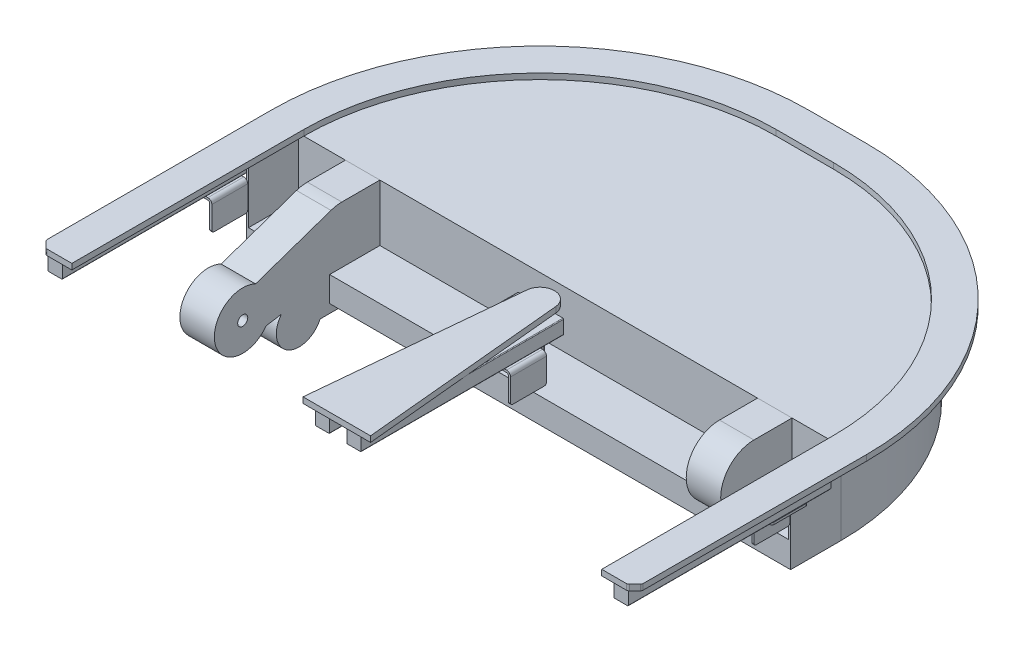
ISO-10303-21;
HEADER;
FILE_DESCRIPTION(('STEP AP214'),'2;1');
FILE_NAME('part.step','',(''),(''),'','','');
FILE_SCHEMA(('AUTOMOTIVE_DESIGN { 1 0 10303 214 1 1 1 1 }'));
ENDSEC;
DATA;
#1=APPLICATION_CONTEXT('core data for automotive mechanical design processes');
#2=APPLICATION_PROTOCOL_DEFINITION('international standard','automotive_design',2000,#1);
#3=PRODUCT_CONTEXT('',#1,'mechanical');
#4=PRODUCT('Part','Part','',(#3));
#5=PRODUCT_RELATED_PRODUCT_CATEGORY('part','',(#4));
#6=PRODUCT_DEFINITION_FORMATION('','',#4);
#7=PRODUCT_DEFINITION_CONTEXT('part definition',#1,'design');
#8=PRODUCT_DEFINITION('design','',#6,#7);
#9=PRODUCT_DEFINITION_SHAPE('','',#8);
#10=(LENGTH_UNIT() NAMED_UNIT(*) SI_UNIT(.MILLI.,.METRE.));
#11=(NAMED_UNIT(*) PLANE_ANGLE_UNIT() SI_UNIT($,.RADIAN.));
#12=(NAMED_UNIT(*) SI_UNIT($,.STERADIAN.) SOLID_ANGLE_UNIT());
#13=UNCERTAINTY_MEASURE_WITH_UNIT(LENGTH_MEASURE(1.E-05),#10,'distance_accuracy_value','');
#14=(GEOMETRIC_REPRESENTATION_CONTEXT(3) GLOBAL_UNCERTAINTY_ASSIGNED_CONTEXT((#13)) GLOBAL_UNIT_ASSIGNED_CONTEXT((#10,
#11,#12)) REPRESENTATION_CONTEXT('',''));
#15=CARTESIAN_POINT('',(0.,0.,0.));
#16=DIRECTION('',(0.,0.,1.));
#17=DIRECTION('',(1.,0.,0.));
#18=AXIS2_PLACEMENT_3D('',#15,#16,#17);
#19=CARTESIAN_POINT('',(51.9999999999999,94.,38.9999999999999));
#20=DIRECTION('',(1.,0.,0.));
#21=DIRECTION('',(0.,0.,-1.));
#22=AXIS2_PLACEMENT_3D('',#19,#20,#21);
#23=PLANE('',#22);
#24=DIRECTION('',(0.,1.,0.));
#25=VECTOR('',#24,1.);
#26=CARTESIAN_POINT('',(51.9999999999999,94.,38.9999999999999));
#27=LINE('',#26,#25);
#28=CARTESIAN_POINT('',(51.9999999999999,95.,38.9999999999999));
#29=VERTEX_POINT('',#28);
#30=CARTESIAN_POINT('',(51.9999999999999,113.,38.9999999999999));
#31=VERTEX_POINT('',#30);
#32=EDGE_CURVE('E138',#29,#31,#27,.T.);
#33=ORIENTED_EDGE('',*,*,#32,.F.);
#34=DIRECTION('',(0.,0.,-1.));
#35=VECTOR('',#34,1.);
#36=CARTESIAN_POINT('',(51.9999999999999,95.,38.9999999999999));
#37=LINE('',#36,#35);
#38=CARTESIAN_POINT('',(51.9999999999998,95.,321.));
#39=VERTEX_POINT('',#38);
#40=EDGE_CURVE('E12',#29,#39,#37,.F.);
#41=ORIENTED_EDGE('',*,*,#40,.T.);
#42=DIRECTION('',(0.,1.,0.));
#43=VECTOR('',#42,1.);
#44=CARTESIAN_POINT('',(51.9999999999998,94.,321.));
#45=LINE('',#44,#43);
#46=CARTESIAN_POINT('',(51.9999999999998,113.,321.));
#47=VERTEX_POINT('',#46);
#48=EDGE_CURVE('E142',#39,#47,#45,.T.);
#49=ORIENTED_EDGE('',*,*,#48,.T.);
#50=DIRECTION('',(0.,0.,-1.));
#51=VECTOR('',#50,1.);
#52=CARTESIAN_POINT('',(51.9999999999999,113.,38.9999999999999));
#53=LINE('',#52,#51);
#54=EDGE_CURVE('E54',#47,#31,#53,.T.);
#55=ORIENTED_EDGE('',*,*,#54,.T.);
#56=EDGE_LOOP('',(#33,#41,#49,#55));
#57=FACE_BOUND('',#56,.T.);
#58=ADVANCED_FACE('F46',(#57),#23,.F.);
#59=CARTESIAN_POINT('',(51.9999999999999,94.,38.9999999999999));
#60=DIRECTION('',(0.,0.,1.));
#61=DIRECTION('',(1.,0.,0.));
#62=AXIS2_PLACEMENT_3D('',#59,#60,#61);
#63=PLANE('',#62);
#64=DIRECTION('',(1.,0.,0.));
#65=VECTOR('',#64,1.);
#66=CARTESIAN_POINT('',(51.9999999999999,114.,38.9999999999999));
#67=LINE('',#66,#65);
#68=CARTESIAN_POINT('',(52.9999999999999,114.,38.9999999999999));
#69=VERTEX_POINT('',#68);
#70=CARTESIAN_POINT('',(71.0000000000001,114.,38.9999999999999));
#71=VERTEX_POINT('',#70);
#72=EDGE_CURVE('E175',#69,#71,#67,.T.);
#73=ORIENTED_EDGE('',*,*,#72,.T.);
#74=CARTESIAN_POINT('',(71.0000000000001,113.,38.9999999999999));
#75=DIRECTION('',(0.,0.,1.));
#76=DIRECTION('',(1.,0.,0.));
#77=AXIS2_PLACEMENT_3D('',#74,#75,#76);
#78=CIRCLE('',#77,1.);
#79=CARTESIAN_POINT('',(72.0000000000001,113.,38.9999999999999));
#80=VERTEX_POINT('',#79);
#81=EDGE_CURVE('E162',#71,#80,#78,.F.);
#82=ORIENTED_EDGE('',*,*,#81,.T.);
#83=DIRECTION('',(0.,1.,0.));
#84=VECTOR('',#83,1.);
#85=CARTESIAN_POINT('',(72.0000000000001,94.,38.9999999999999));
#86=LINE('',#85,#84);
#87=CARTESIAN_POINT('',(72.0000000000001,95.,38.9999999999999));
#88=VERTEX_POINT('',#87);
#89=EDGE_CURVE('E141',#88,#80,#86,.T.);
#90=ORIENTED_EDGE('',*,*,#89,.F.);
#91=CARTESIAN_POINT('',(71.0000000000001,95.,38.9999999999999));
#92=DIRECTION('',(0.,0.,1.));
#93=DIRECTION('',(1.,0.,0.));
#94=AXIS2_PLACEMENT_3D('',#91,#92,#93);
#95=CIRCLE('',#94,1.);
#96=CARTESIAN_POINT('',(71.0000000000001,94.,38.9999999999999));
#97=VERTEX_POINT('',#96);
#98=EDGE_CURVE('E133',#88,#97,#95,.F.);
#99=ORIENTED_EDGE('',*,*,#98,.T.);
#100=DIRECTION('',(1.,0.,0.));
#101=VECTOR('',#100,1.);
#102=CARTESIAN_POINT('',(51.9999999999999,94.,38.9999999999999));
#103=LINE('',#102,#101);
#104=CARTESIAN_POINT('',(52.9999999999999,94.,38.9999999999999));
#105=VERTEX_POINT('',#104);
#106=EDGE_CURVE('E183',#105,#97,#103,.T.);
#107=ORIENTED_EDGE('',*,*,#106,.F.);
#108=CARTESIAN_POINT('',(52.9999999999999,95.,38.9999999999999));
#109=DIRECTION('',(0.,0.,1.));
#110=DIRECTION('',(1.,0.,0.));
#111=AXIS2_PLACEMENT_3D('',#108,#109,#110);
#112=CIRCLE('',#111,1.);
#113=EDGE_CURVE('E69',#105,#29,#112,.F.);
#114=ORIENTED_EDGE('',*,*,#113,.T.);
#115=ORIENTED_EDGE('',*,*,#32,.T.);
#116=CARTESIAN_POINT('',(52.9999999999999,113.,38.9999999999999));
#117=DIRECTION('',(0.,0.,1.));
#118=DIRECTION('',(1.,0.,0.));
#119=AXIS2_PLACEMENT_3D('',#116,#117,#118);
#120=CIRCLE('',#119,1.);
#121=EDGE_CURVE('E61',#31,#69,#120,.F.);
#122=ORIENTED_EDGE('',*,*,#121,.T.);
#123=EDGE_LOOP('',(#73,#82,#90,#99,#107,#114,#115,#122));
#124=FACE_BOUND('',#123,.T.);
#125=ADVANCED_FACE('F173',(#124),#63,.F.);
#126=CARTESIAN_POINT('',(72.0000000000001,94.,38.9999999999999));
#127=DIRECTION('',(-1.,0.,0.));
#128=DIRECTION('',(0.,0.,1.));
#129=AXIS2_PLACEMENT_3D('',#126,#127,#128);
#130=PLANE('',#129);
#131=ORIENTED_EDGE('',*,*,#89,.T.);
#132=DIRECTION('',(0.,0.,1.));
#133=VECTOR('',#132,1.);
#134=CARTESIAN_POINT('',(71.9999999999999,113.,321.));
#135=LINE('',#134,#133);
#136=CARTESIAN_POINT('',(71.9999999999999,113.,321.));
#137=VERTEX_POINT('',#136);
#138=EDGE_CURVE('E137',#80,#137,#135,.T.);
#139=ORIENTED_EDGE('',*,*,#138,.T.);
#140=DIRECTION('',(0.,1.,0.));
#141=VECTOR('',#140,1.);
#142=CARTESIAN_POINT('',(71.9999999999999,94.,321.));
#143=LINE('',#142,#141);
#144=CARTESIAN_POINT('',(71.9999999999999,95.,321.));
#145=VERTEX_POINT('',#144);
#146=EDGE_CURVE('E120',#145,#137,#143,.T.);
#147=ORIENTED_EDGE('',*,*,#146,.F.);
#148=DIRECTION('',(0.,0.,1.));
#149=VECTOR('',#148,1.);
#150=CARTESIAN_POINT('',(72.0000000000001,95.,38.9999999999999));
#151=LINE('',#150,#149);
#152=EDGE_CURVE('E130',#145,#88,#151,.F.);
#153=ORIENTED_EDGE('',*,*,#152,.T.);
#154=EDGE_LOOP('',(#131,#139,#147,#153));
#155=FACE_BOUND('',#154,.T.);
#156=ADVANCED_FACE('F140',(#155),#130,.F.);
#157=CARTESIAN_POINT('',(51.9999999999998,94.,321.));
#158=DIRECTION('',(0.,0.,-1.));
#159=DIRECTION('',(-1.,0.,0.));
#160=AXIS2_PLACEMENT_3D('',#157,#158,#159);
#161=PLANE('',#160);
#162=ORIENTED_EDGE('',*,*,#146,.T.);
#163=CARTESIAN_POINT('',(70.9999999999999,113.,321.));
#164=DIRECTION('',(0.,0.,-1.));
#165=DIRECTION('',(-1.,0.,0.));
#166=AXIS2_PLACEMENT_3D('',#163,#164,#165);
#167=CIRCLE('',#166,1.);
#168=CARTESIAN_POINT('',(70.9999999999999,114.,321.));
#169=VERTEX_POINT('',#168);
#170=EDGE_CURVE('E126',#137,#169,#167,.F.);
#171=ORIENTED_EDGE('',*,*,#170,.T.);
#172=DIRECTION('',(-1.,0.,0.));
#173=VECTOR('',#172,1.);
#174=CARTESIAN_POINT('',(51.9999999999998,114.,321.));
#175=LINE('',#174,#173);
#176=CARTESIAN_POINT('',(52.9999999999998,114.,321.));
#177=VERTEX_POINT('',#176);
#178=EDGE_CURVE('E180',#169,#177,#175,.T.);
#179=ORIENTED_EDGE('',*,*,#178,.T.);
#180=CARTESIAN_POINT('',(52.9999999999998,113.,321.));
#181=DIRECTION('',(0.,0.,-1.));
#182=DIRECTION('',(-1.,0.,0.));
#183=AXIS2_PLACEMENT_3D('',#180,#181,#182);
#184=CIRCLE('',#183,1.);
#185=EDGE_CURVE('E151',#177,#47,#184,.F.);
#186=ORIENTED_EDGE('',*,*,#185,.T.);
#187=ORIENTED_EDGE('',*,*,#48,.F.);
#188=CARTESIAN_POINT('',(52.9999999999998,95.,321.));
#189=DIRECTION('',(0.,0.,-1.));
#190=DIRECTION('',(-1.,0.,0.));
#191=AXIS2_PLACEMENT_3D('',#188,#189,#190);
#192=CIRCLE('',#191,1.);
#193=CARTESIAN_POINT('',(52.9999999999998,94.,321.));
#194=VERTEX_POINT('',#193);
#195=EDGE_CURVE('E127',#39,#194,#192,.F.);
#196=ORIENTED_EDGE('',*,*,#195,.T.);
#197=DIRECTION('',(-1.,0.,0.));
#198=VECTOR('',#197,1.);
#199=CARTESIAN_POINT('',(51.9999999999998,94.,321.));
#200=LINE('',#199,#198);
#201=CARTESIAN_POINT('',(70.9999999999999,94.,321.));
#202=VERTEX_POINT('',#201);
#203=EDGE_CURVE('E124',#202,#194,#200,.T.);
#204=ORIENTED_EDGE('',*,*,#203,.F.);
#205=CARTESIAN_POINT('',(70.9999999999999,95.,321.));
#206=DIRECTION('',(0.,0.,-1.));
#207=DIRECTION('',(-1.,0.,0.));
#208=AXIS2_PLACEMENT_3D('',#205,#206,#207);
#209=CIRCLE('',#208,1.);
#210=EDGE_CURVE('E115',#202,#145,#209,.F.);
#211=ORIENTED_EDGE('',*,*,#210,.T.);
#212=EDGE_LOOP('',(#162,#171,#179,#186,#187,#196,#204,#211));
#213=FACE_BOUND('',#212,.T.);
#214=ADVANCED_FACE('F117',(#213),#161,.F.);
#215=CARTESIAN_POINT('',(416.,94.,0.));
#216=DIRECTION('',(0.,1.,0.));
#217=DIRECTION('',(0.,0.,1.));
#218=AXIS2_PLACEMENT_3D('',#215,#216,#217);
#219=PLANE('',#218);
#220=ORIENTED_EDGE('',*,*,#106,.T.);
#221=DIRECTION('',(0.,0.,1.));
#222=VECTOR('',#221,1.);
#223=CARTESIAN_POINT('',(71.0000000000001,94.,-2.11027265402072E-13));
#224=LINE('',#223,#222);
#225=EDGE_CURVE('E167',#97,#202,#224,.T.);
#226=ORIENTED_EDGE('',*,*,#225,.T.);
#227=ORIENTED_EDGE('',*,*,#203,.T.);
#228=DIRECTION('',(0.,0.,-1.));
#229=VECTOR('',#228,1.);
#230=CARTESIAN_POINT('',(52.9999999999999,94.,-1.49805763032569E-13));
#231=LINE('',#230,#229);
#232=EDGE_CURVE('E165',#194,#105,#231,.T.);
#233=ORIENTED_EDGE('',*,*,#232,.T.);
#234=EDGE_LOOP('',(#220,#226,#227,#233));
#235=FACE_BOUND('',#234,.T.);
#236=ADVANCED_FACE('F188',(#235),#219,.F.);
#237=CARTESIAN_POINT('',(416.,114.,0.));
#238=DIRECTION('',(0.,1.,0.));
#239=DIRECTION('',(0.,0.,1.));
#240=AXIS2_PLACEMENT_3D('',#237,#238,#239);
#241=PLANE('',#240);
#242=ORIENTED_EDGE('',*,*,#178,.F.);
#243=DIRECTION('',(0.,0.,1.));
#244=VECTOR('',#243,1.);
#245=CARTESIAN_POINT('',(71.0000000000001,114.,38.9999999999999));
#246=LINE('',#245,#244);
#247=EDGE_CURVE('E157',#169,#71,#246,.F.);
#248=ORIENTED_EDGE('',*,*,#247,.T.);
#249=ORIENTED_EDGE('',*,*,#72,.F.);
#250=DIRECTION('',(0.,0.,-1.));
#251=VECTOR('',#250,1.);
#252=CARTESIAN_POINT('',(52.9999999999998,114.,321.));
#253=LINE('',#252,#251);
#254=EDGE_CURVE('E155',#69,#177,#253,.F.);
#255=ORIENTED_EDGE('',*,*,#254,.T.);
#256=EDGE_LOOP('',(#242,#248,#249,#255));
#257=FACE_BOUND('',#256,.T.);
#258=ADVANCED_FACE('F178',(#257),#241,.T.);
#259=CARTESIAN_POINT('',(71.0000000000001,113.,38.9999999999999));
#260=DIRECTION('',(0.,0.,-1.));
#261=DIRECTION('',(-1.,0.,0.));
#262=AXIS2_PLACEMENT_3D('',#259,#260,#261);
#263=CYLINDRICAL_SURFACE('',#262,1.);
#264=ORIENTED_EDGE('',*,*,#81,.F.);
#265=ORIENTED_EDGE('',*,*,#247,.F.);
#266=ORIENTED_EDGE('',*,*,#170,.F.);
#267=ORIENTED_EDGE('',*,*,#138,.F.);
#268=EDGE_LOOP('',(#264,#265,#266,#267));
#269=FACE_BOUND('',#268,.T.);
#270=ADVANCED_FACE('F190',(#269),#263,.T.);
#271=CARTESIAN_POINT('',(71.0000000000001,95.,-2.11027265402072E-13));
#272=DIRECTION('',(0.,0.,1.));
#273=DIRECTION('',(1.,0.,0.));
#274=AXIS2_PLACEMENT_3D('',#271,#272,#273);
#275=CYLINDRICAL_SURFACE('',#274,1.);
#276=ORIENTED_EDGE('',*,*,#98,.F.);
#277=ORIENTED_EDGE('',*,*,#152,.F.);
#278=ORIENTED_EDGE('',*,*,#210,.F.);
#279=ORIENTED_EDGE('',*,*,#225,.F.);
#280=EDGE_LOOP('',(#276,#277,#278,#279));
#281=FACE_BOUND('',#280,.T.);
#282=ADVANCED_FACE('F131',(#281),#275,.T.);
#283=CARTESIAN_POINT('',(52.9999999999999,95.,-1.49805763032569E-13));
#284=DIRECTION('',(0.,0.,-1.));
#285=DIRECTION('',(-1.,0.,0.));
#286=AXIS2_PLACEMENT_3D('',#283,#284,#285);
#287=CYLINDRICAL_SURFACE('',#286,1.);
#288=ORIENTED_EDGE('',*,*,#195,.F.);
#289=ORIENTED_EDGE('',*,*,#40,.F.);
#290=ORIENTED_EDGE('',*,*,#113,.F.);
#291=ORIENTED_EDGE('',*,*,#232,.F.);
#292=EDGE_LOOP('',(#288,#289,#290,#291));
#293=FACE_BOUND('',#292,.T.);
#294=ADVANCED_FACE('F192',(#293),#287,.T.);
#295=CARTESIAN_POINT('',(52.9999999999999,113.,38.9999999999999));
#296=DIRECTION('',(0.,0.,1.));
#297=DIRECTION('',(1.,0.,0.));
#298=AXIS2_PLACEMENT_3D('',#295,#296,#297);
#299=CYLINDRICAL_SURFACE('',#298,1.);
#300=ORIENTED_EDGE('',*,*,#185,.F.);
#301=ORIENTED_EDGE('',*,*,#254,.F.);
#302=ORIENTED_EDGE('',*,*,#121,.F.);
#303=ORIENTED_EDGE('',*,*,#54,.F.);
#304=EDGE_LOOP('',(#300,#301,#302,#303));
#305=FACE_BOUND('',#304,.T.);
#306=ADVANCED_FACE('F48',(#305),#299,.T.);
#307=CLOSED_SHELL('',(#58,#125,#156,#214,#236,#258,#270,#282,#294,#306));
#308=MANIFOLD_SOLID_BREP('B2',#307);
#309=CARTESIAN_POINT('',(51.9999999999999,91.,121.));
#310=DIRECTION('',(-1.,0.,0.));
#311=DIRECTION('',(0.,0.,1.));
#312=AXIS2_PLACEMENT_3D('',#309,#310,#311);
#313=PLANE('',#312);
#314=DIRECTION('',(0.,0.,-1.));
#315=VECTOR('',#314,1.);
#316=CARTESIAN_POINT('',(51.9999999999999,94.,121.));
#317=LINE('',#316,#315);
#318=CARTESIAN_POINT('',(51.9999999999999,94.,118.));
#319=VERTEX_POINT('',#318);
#320=CARTESIAN_POINT('',(51.9999999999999,94.,73.9999999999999));
#321=VERTEX_POINT('',#320);
#322=EDGE_CURVE('E398',#319,#321,#317,.T.);
#323=ORIENTED_EDGE('',*,*,#322,.T.);
#324=DIRECTION('',(0.,1.,0.));
#325=VECTOR('',#324,1.);
#326=CARTESIAN_POINT('',(51.9999999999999,91.,73.9999999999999));
#327=LINE('',#326,#325);
#328=CARTESIAN_POINT('',(51.9999999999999,91.,73.9999999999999));
#329=VERTEX_POINT('',#328);
#330=EDGE_CURVE('E438',#321,#329,#327,.F.);
#331=ORIENTED_EDGE('',*,*,#330,.T.);
#332=DIRECTION('',(0.,0.,-1.));
#333=VECTOR('',#332,1.);
#334=CARTESIAN_POINT('',(51.9999999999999,91.,121.));
#335=LINE('',#334,#333);
#336=CARTESIAN_POINT('',(51.9999999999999,91.,118.));
#337=VERTEX_POINT('',#336);
#338=EDGE_CURVE('E410',#337,#329,#335,.T.);
#339=ORIENTED_EDGE('',*,*,#338,.F.);
#340=DIRECTION('',(0.,1.,0.));
#341=VECTOR('',#340,1.);
#342=CARTESIAN_POINT('',(51.9999999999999,94.,118.));
#343=LINE('',#342,#341);
#344=EDGE_CURVE('E435',#337,#319,#343,.T.);
#345=ORIENTED_EDGE('',*,*,#344,.T.);
#346=EDGE_LOOP('',(#323,#331,#339,#345));
#347=FACE_BOUND('',#346,.T.);
#348=ADVANCED_FACE('F284',(#347),#313,.T.);
#349=CARTESIAN_POINT('',(74.46,91.,121.));
#350=DIRECTION('',(0.,-1.,0.));
#351=DIRECTION('',(0.,0.,-1.));
#352=AXIS2_PLACEMENT_3D('',#349,#350,#351);
#353=PLANE('',#352);
#354=ORIENTED_EDGE('',*,*,#338,.T.);
#355=CARTESIAN_POINT('',(54.9999999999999,91.,73.9999999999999));
#356=DIRECTION('',(0.,-1.,0.));
#357=DIRECTION('',(0.,0.,-1.));
#358=AXIS2_PLACEMENT_3D('',#355,#356,#357);
#359=CIRCLE('',#358,3.);
#360=CARTESIAN_POINT('',(54.9999999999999,91.,70.9999999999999));
#361=VERTEX_POINT('',#360);
#362=EDGE_CURVE('E44',#329,#361,#359,.T.);
#363=ORIENTED_EDGE('',*,*,#362,.T.);
#364=DIRECTION('',(-1.,0.,0.));
#365=VECTOR('',#364,1.);
#366=CARTESIAN_POINT('',(74.4600000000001,91.,70.9999999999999));
#367=LINE('',#366,#365);
#368=CARTESIAN_POINT('',(74.4600000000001,91.,70.9999999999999));
#369=VERTEX_POINT('',#368);
#370=EDGE_CURVE('E384',#369,#361,#367,.T.);
#371=ORIENTED_EDGE('',*,*,#370,.F.);
#372=DIRECTION('',(0.,0.,-1.));
#373=VECTOR('',#372,1.);
#374=CARTESIAN_POINT('',(74.46,91.,121.));
#375=LINE('',#374,#373);
#376=CARTESIAN_POINT('',(74.46,91.,121.));
#377=VERTEX_POINT('',#376);
#378=EDGE_CURVE('E461',#377,#369,#375,.T.);
#379=ORIENTED_EDGE('',*,*,#378,.F.);
#380=DIRECTION('',(-1.,0.,0.));
#381=VECTOR('',#380,1.);
#382=CARTESIAN_POINT('',(74.46,91.,121.));
#383=LINE('',#382,#381);
#384=CARTESIAN_POINT('',(54.9999999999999,91.,121.));
#385=VERTEX_POINT('',#384);
#386=EDGE_CURVE('E403',#377,#385,#383,.T.);
#387=ORIENTED_EDGE('',*,*,#386,.T.);
#388=CARTESIAN_POINT('',(54.9999999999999,91.,118.));
#389=DIRECTION('',(0.,-1.,0.));
#390=DIRECTION('',(0.,0.,-1.));
#391=AXIS2_PLACEMENT_3D('',#388,#389,#390);
#392=CIRCLE('',#391,3.);
#393=EDGE_CURVE('E292',#385,#337,#392,.T.);
#394=ORIENTED_EDGE('',*,*,#393,.T.);
#395=EDGE_LOOP('',(#354,#363,#371,#379,#387,#394));
#396=FACE_BOUND('',#395,.T.);
#397=ADVANCED_FACE('F493',(#396),#353,.T.);
#398=CARTESIAN_POINT('',(74.46,88.46,121.));
#399=DIRECTION('',(0.,0.,-1.));
#400=DIRECTION('',(-1.,0.,0.));
#401=AXIS2_PLACEMENT_3D('',#398,#399,#400);
#402=CYLINDRICAL_SURFACE('',#401,2.53999999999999);
#403=CARTESIAN_POINT('',(74.4600000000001,88.46,70.9999999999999));
#404=DIRECTION('',(0.,0.,1.));
#405=DIRECTION('',(1.,0.,0.));
#406=AXIS2_PLACEMENT_3D('',#403,#404,#405);
#407=CIRCLE('',#406,2.53999999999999);
#408=CARTESIAN_POINT('',(77.0000000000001,88.46,70.9999999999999));
#409=VERTEX_POINT('',#408);
#410=EDGE_CURVE('E457',#409,#369,#407,.T.);
#411=ORIENTED_EDGE('',*,*,#410,.F.);
#412=DIRECTION('',(0.,0.,-1.));
#413=VECTOR('',#412,1.);
#414=CARTESIAN_POINT('',(77.,88.46,121.));
#415=LINE('',#414,#413);
#416=CARTESIAN_POINT('',(77.,88.46,121.));
#417=VERTEX_POINT('',#416);
#418=EDGE_CURVE('E464',#417,#409,#415,.T.);
#419=ORIENTED_EDGE('',*,*,#418,.F.);
#420=CARTESIAN_POINT('',(74.46,88.46,121.));
#421=DIRECTION('',(0.,0.,1.));
#422=DIRECTION('',(1.,0.,0.));
#423=AXIS2_PLACEMENT_3D('',#420,#421,#422);
#424=CIRCLE('',#423,2.53999999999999);
#425=EDGE_CURVE('E486',#417,#377,#424,.T.);
#426=ORIENTED_EDGE('',*,*,#425,.T.);
#427=ORIENTED_EDGE('',*,*,#378,.T.);
#428=EDGE_LOOP('',(#411,#419,#426,#427));
#429=FACE_BOUND('',#428,.T.);
#430=ADVANCED_FACE('F506',(#429),#402,.F.);
#431=CARTESIAN_POINT('',(77.,54.,121.));
#432=DIRECTION('',(-1.,0.,0.));
#433=DIRECTION('',(0.,0.,1.));
#434=AXIS2_PLACEMENT_3D('',#431,#432,#433);
#435=PLANE('',#434);
#436=DIRECTION('',(0.,1.,0.));
#437=VECTOR('',#436,1.);
#438=CARTESIAN_POINT('',(77.0000000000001,54.,70.9999999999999));
#439=LINE('',#438,#437);
#440=CARTESIAN_POINT('',(77.0000000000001,57.,70.9999999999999));
#441=VERTEX_POINT('',#440);
#442=EDGE_CURVE('E455',#441,#409,#439,.T.);
#443=ORIENTED_EDGE('',*,*,#442,.F.);
#444=CARTESIAN_POINT('',(77.0000000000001,57.,73.9999999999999));
#445=DIRECTION('',(-1.,0.,0.));
#446=DIRECTION('',(0.,0.,1.));
#447=AXIS2_PLACEMENT_3D('',#444,#445,#446);
#448=CIRCLE('',#447,3.);
#449=CARTESIAN_POINT('',(77.0000000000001,54.,73.9999999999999));
#450=VERTEX_POINT('',#449);
#451=EDGE_CURVE('E415',#441,#450,#448,.T.);
#452=ORIENTED_EDGE('',*,*,#451,.T.);
#453=DIRECTION('',(0.,0.,-1.));
#454=VECTOR('',#453,1.);
#455=CARTESIAN_POINT('',(77.,54.,121.));
#456=LINE('',#455,#454);
#457=CARTESIAN_POINT('',(77.,54.,118.));
#458=VERTEX_POINT('',#457);
#459=EDGE_CURVE('E467',#458,#450,#456,.T.);
#460=ORIENTED_EDGE('',*,*,#459,.F.);
#461=CARTESIAN_POINT('',(77.,57.,118.));
#462=DIRECTION('',(-1.,0.,0.));
#463=DIRECTION('',(0.,0.,1.));
#464=AXIS2_PLACEMENT_3D('',#461,#462,#463);
#465=CIRCLE('',#464,3.);
#466=CARTESIAN_POINT('',(77.,57.,121.));
#467=VERTEX_POINT('',#466);
#468=EDGE_CURVE('E412',#458,#467,#465,.T.);
#469=ORIENTED_EDGE('',*,*,#468,.T.);
#470=DIRECTION('',(0.,1.,0.));
#471=VECTOR('',#470,1.);
#472=CARTESIAN_POINT('',(77.,54.,121.));
#473=LINE('',#472,#471);
#474=EDGE_CURVE('E484',#467,#417,#473,.T.);
#475=ORIENTED_EDGE('',*,*,#474,.T.);
#476=ORIENTED_EDGE('',*,*,#418,.T.);
#477=EDGE_LOOP('',(#443,#452,#460,#469,#475,#476));
#478=FACE_BOUND('',#477,.T.);
#479=ADVANCED_FACE('F519',(#478),#435,.T.);
#480=CARTESIAN_POINT('',(80.,54.,121.));
#481=DIRECTION('',(0.,-1.,0.));
#482=DIRECTION('',(0.,0.,-1.));
#483=AXIS2_PLACEMENT_3D('',#480,#481,#482);
#484=PLANE('',#483);
#485=ORIENTED_EDGE('',*,*,#459,.T.);
#486=DIRECTION('',(-1.,0.,0.));
#487=VECTOR('',#486,1.);
#488=CARTESIAN_POINT('',(80.0000000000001,54.,73.9999999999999));
#489=LINE('',#488,#487);
#490=CARTESIAN_POINT('',(80.0000000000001,54.,73.9999999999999));
#491=VERTEX_POINT('',#490);
#492=EDGE_CURVE('E420',#450,#491,#489,.F.);
#493=ORIENTED_EDGE('',*,*,#492,.T.);
#494=DIRECTION('',(0.,0.,-1.));
#495=VECTOR('',#494,1.);
#496=CARTESIAN_POINT('',(80.,54.,121.));
#497=LINE('',#496,#495);
#498=CARTESIAN_POINT('',(80.,54.,118.));
#499=VERTEX_POINT('',#498);
#500=EDGE_CURVE('E400',#499,#491,#497,.T.);
#501=ORIENTED_EDGE('',*,*,#500,.F.);
#502=DIRECTION('',(-1.,0.,0.));
#503=VECTOR('',#502,1.);
#504=CARTESIAN_POINT('',(77.,54.,118.));
#505=LINE('',#504,#503);
#506=EDGE_CURVE('E418',#499,#458,#505,.T.);
#507=ORIENTED_EDGE('',*,*,#506,.T.);
#508=EDGE_LOOP('',(#485,#493,#501,#507));
#509=FACE_BOUND('',#508,.T.);
#510=ADVANCED_FACE('F477',(#509),#484,.T.);
#511=CARTESIAN_POINT('',(80.,88.46,121.));
#512=DIRECTION('',(1.,0.,0.));
#513=DIRECTION('',(0.,0.,-1.));
#514=AXIS2_PLACEMENT_3D('',#511,#512,#513);
#515=PLANE('',#514);
#516=ORIENTED_EDGE('',*,*,#500,.T.);
#517=CARTESIAN_POINT('',(80.0000000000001,57.,73.9999999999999));
#518=DIRECTION('',(1.,0.,0.));
#519=DIRECTION('',(0.,0.,-1.));
#520=AXIS2_PLACEMENT_3D('',#517,#518,#519);
#521=CIRCLE('',#520,3.);
#522=CARTESIAN_POINT('',(80.0000000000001,57.,70.9999999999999));
#523=VERTEX_POINT('',#522);
#524=EDGE_CURVE('E425',#491,#523,#521,.T.);
#525=ORIENTED_EDGE('',*,*,#524,.T.);
#526=DIRECTION('',(0.,-1.,0.));
#527=VECTOR('',#526,1.);
#528=CARTESIAN_POINT('',(80.0000000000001,88.46,70.9999999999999));
#529=LINE('',#528,#527);
#530=CARTESIAN_POINT('',(80.0000000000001,88.46,70.9999999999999));
#531=VERTEX_POINT('',#530);
#532=EDGE_CURVE('E448',#531,#523,#529,.T.);
#533=ORIENTED_EDGE('',*,*,#532,.F.);
#534=DIRECTION('',(0.,0.,-1.));
#535=VECTOR('',#534,1.);
#536=CARTESIAN_POINT('',(80.,88.46,121.));
#537=LINE('',#536,#535);
#538=CARTESIAN_POINT('',(80.,88.46,121.));
#539=VERTEX_POINT('',#538);
#540=EDGE_CURVE('E397',#539,#531,#537,.T.);
#541=ORIENTED_EDGE('',*,*,#540,.F.);
#542=DIRECTION('',(0.,-1.,0.));
#543=VECTOR('',#542,1.);
#544=CARTESIAN_POINT('',(80.,88.46,121.));
#545=LINE('',#544,#543);
#546=CARTESIAN_POINT('',(80.,57.,121.));
#547=VERTEX_POINT('',#546);
#548=EDGE_CURVE('E390',#539,#547,#545,.T.);
#549=ORIENTED_EDGE('',*,*,#548,.T.);
#550=CARTESIAN_POINT('',(80.,57.,118.));
#551=DIRECTION('',(1.,0.,0.));
#552=DIRECTION('',(0.,0.,-1.));
#553=AXIS2_PLACEMENT_3D('',#550,#551,#552);
#554=CIRCLE('',#553,3.);
#555=EDGE_CURVE('E423',#547,#499,#554,.T.);
#556=ORIENTED_EDGE('',*,*,#555,.T.);
#557=EDGE_LOOP('',(#516,#525,#533,#541,#549,#556));
#558=FACE_BOUND('',#557,.T.);
#559=ADVANCED_FACE('F472',(#558),#515,.T.);
#560=CARTESIAN_POINT('',(74.46,88.46,121.));
#561=DIRECTION('',(0.,0.,-1.));
#562=DIRECTION('',(-1.,0.,0.));
#563=AXIS2_PLACEMENT_3D('',#560,#561,#562);
#564=CYLINDRICAL_SURFACE('',#563,5.54);
#565=CARTESIAN_POINT('',(74.4600000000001,88.46,70.9999999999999));
#566=DIRECTION('',(0.,0.,-1.));
#567=DIRECTION('',(-1.,0.,0.));
#568=AXIS2_PLACEMENT_3D('',#565,#566,#567);
#569=CIRCLE('',#568,5.54);
#570=CARTESIAN_POINT('',(74.4600000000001,94.,70.9999999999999));
#571=VERTEX_POINT('',#570);
#572=EDGE_CURVE('E396',#571,#531,#569,.T.);
#573=ORIENTED_EDGE('',*,*,#572,.F.);
#574=DIRECTION('',(0.,0.,-1.));
#575=VECTOR('',#574,1.);
#576=CARTESIAN_POINT('',(74.46,94.,121.));
#577=LINE('',#576,#575);
#578=CARTESIAN_POINT('',(74.46,94.,121.));
#579=VERTEX_POINT('',#578);
#580=EDGE_CURVE('E378',#579,#571,#577,.T.);
#581=ORIENTED_EDGE('',*,*,#580,.F.);
#582=CARTESIAN_POINT('',(74.46,88.46,121.));
#583=DIRECTION('',(0.,0.,-1.));
#584=DIRECTION('',(-1.,0.,0.));
#585=AXIS2_PLACEMENT_3D('',#582,#583,#584);
#586=CIRCLE('',#585,5.54);
#587=EDGE_CURVE('E383',#579,#539,#586,.T.);
#588=ORIENTED_EDGE('',*,*,#587,.T.);
#589=ORIENTED_EDGE('',*,*,#540,.T.);
#590=EDGE_LOOP('',(#573,#581,#588,#589));
#591=FACE_BOUND('',#590,.T.);
#592=ADVANCED_FACE('F395',(#591),#564,.T.);
#593=CARTESIAN_POINT('',(51.9999999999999,94.,121.));
#594=DIRECTION('',(0.,1.,0.));
#595=DIRECTION('',(0.,0.,1.));
#596=AXIS2_PLACEMENT_3D('',#593,#594,#595);
#597=PLANE('',#596);
#598=DIRECTION('',(1.,0.,0.));
#599=VECTOR('',#598,1.);
#600=CARTESIAN_POINT('',(51.9999999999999,94.,70.9999999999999));
#601=LINE('',#600,#599);
#602=CARTESIAN_POINT('',(54.9999999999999,94.,70.9999999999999));
#603=VERTEX_POINT('',#602);
#604=EDGE_CURVE('E445',#603,#571,#601,.T.);
#605=ORIENTED_EDGE('',*,*,#604,.F.);
#606=CARTESIAN_POINT('',(54.9999999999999,94.,73.9999999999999));
#607=DIRECTION('',(0.,1.,0.));
#608=DIRECTION('',(0.,0.,1.));
#609=AXIS2_PLACEMENT_3D('',#606,#607,#608);
#610=CIRCLE('',#609,3.);
#611=EDGE_CURVE('E433',#603,#321,#610,.T.);
#612=ORIENTED_EDGE('',*,*,#611,.T.);
#613=ORIENTED_EDGE('',*,*,#322,.F.);
#614=CARTESIAN_POINT('',(54.9999999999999,94.,118.));
#615=DIRECTION('',(0.,1.,0.));
#616=DIRECTION('',(0.,0.,1.));
#617=AXIS2_PLACEMENT_3D('',#614,#615,#616);
#618=CIRCLE('',#617,3.);
#619=CARTESIAN_POINT('',(54.9999999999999,94.,121.));
#620=VERTEX_POINT('',#619);
#621=EDGE_CURVE('E381',#319,#620,#618,.T.);
#622=ORIENTED_EDGE('',*,*,#621,.T.);
#623=DIRECTION('',(1.,0.,0.));
#624=VECTOR('',#623,1.);
#625=CARTESIAN_POINT('',(51.9999999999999,94.,121.));
#626=LINE('',#625,#624);
#627=EDGE_CURVE('E373',#620,#579,#626,.T.);
#628=ORIENTED_EDGE('',*,*,#627,.T.);
#629=ORIENTED_EDGE('',*,*,#580,.T.);
#630=EDGE_LOOP('',(#605,#612,#613,#622,#628,#629));
#631=FACE_BOUND('',#630,.T.);
#632=ADVANCED_FACE('F376',(#631),#597,.T.);
#633=CARTESIAN_POINT('',(74.46,88.46,121.));
#634=DIRECTION('',(0.,0.,-1.));
#635=DIRECTION('',(-1.,0.,0.));
#636=AXIS2_PLACEMENT_3D('',#633,#634,#635);
#637=PLANE('',#636);
#638=ORIENTED_EDGE('',*,*,#474,.F.);
#639=DIRECTION('',(-1.,0.,0.));
#640=VECTOR('',#639,1.);
#641=CARTESIAN_POINT('',(80.,57.,121.));
#642=LINE('',#641,#640);
#643=EDGE_CURVE('E430',#467,#547,#642,.F.);
#644=ORIENTED_EDGE('',*,*,#643,.T.);
#645=ORIENTED_EDGE('',*,*,#548,.F.);
#646=ORIENTED_EDGE('',*,*,#587,.F.);
#647=ORIENTED_EDGE('',*,*,#627,.F.);
#648=DIRECTION('',(0.,1.,0.));
#649=VECTOR('',#648,1.);
#650=CARTESIAN_POINT('',(54.9999999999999,91.,121.));
#651=LINE('',#650,#649);
#652=EDGE_CURVE('E428',#620,#385,#651,.F.);
#653=ORIENTED_EDGE('',*,*,#652,.T.);
#654=ORIENTED_EDGE('',*,*,#386,.F.);
#655=ORIENTED_EDGE('',*,*,#425,.F.);
#656=EDGE_LOOP('',(#638,#644,#645,#646,#647,#653,#654,#655));
#657=FACE_BOUND('',#656,.T.);
#658=ADVANCED_FACE('F388',(#657),#637,.F.);
#659=CARTESIAN_POINT('',(74.4600000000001,88.46,70.9999999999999));
#660=DIRECTION('',(0.,0.,-1.));
#661=DIRECTION('',(-1.,0.,0.));
#662=AXIS2_PLACEMENT_3D('',#659,#660,#661);
#663=PLANE('',#662);
#664=ORIENTED_EDGE('',*,*,#532,.T.);
#665=DIRECTION('',(-1.,0.,0.));
#666=VECTOR('',#665,1.);
#667=CARTESIAN_POINT('',(74.4600000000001,57.,70.9999999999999));
#668=LINE('',#667,#666);
#669=EDGE_CURVE('E409',#523,#441,#668,.T.);
#670=ORIENTED_EDGE('',*,*,#669,.T.);
#671=ORIENTED_EDGE('',*,*,#442,.T.);
#672=ORIENTED_EDGE('',*,*,#410,.T.);
#673=ORIENTED_EDGE('',*,*,#370,.T.);
#674=DIRECTION('',(0.,1.,0.));
#675=VECTOR('',#674,1.);
#676=CARTESIAN_POINT('',(54.9999999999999,88.46,70.9999999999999));
#677=LINE('',#676,#675);
#678=EDGE_CURVE('E407',#361,#603,#677,.T.);
#679=ORIENTED_EDGE('',*,*,#678,.T.);
#680=ORIENTED_EDGE('',*,*,#604,.T.);
#681=ORIENTED_EDGE('',*,*,#572,.T.);
#682=EDGE_LOOP('',(#664,#670,#671,#672,#673,#679,#680,#681));
#683=FACE_BOUND('',#682,.T.);
#684=ADVANCED_FACE('F483',(#683),#663,.T.);
#685=CARTESIAN_POINT('',(74.4600000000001,57.,73.9999999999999));
#686=DIRECTION('',(-1.,0.,0.));
#687=DIRECTION('',(0.,0.,1.));
#688=AXIS2_PLACEMENT_3D('',#685,#686,#687);
#689=CYLINDRICAL_SURFACE('',#688,3.);
#690=ORIENTED_EDGE('',*,*,#524,.F.);
#691=ORIENTED_EDGE('',*,*,#492,.F.);
#692=ORIENTED_EDGE('',*,*,#451,.F.);
#693=ORIENTED_EDGE('',*,*,#669,.F.);
#694=EDGE_LOOP('',(#690,#691,#692,#693));
#695=FACE_BOUND('',#694,.T.);
#696=ADVANCED_FACE('F481',(#695),#689,.T.);
#697=CARTESIAN_POINT('',(80.,57.,118.));
#698=DIRECTION('',(1.,0.,0.));
#699=DIRECTION('',(0.,0.,-1.));
#700=AXIS2_PLACEMENT_3D('',#697,#698,#699);
#701=CYLINDRICAL_SURFACE('',#700,3.);
#702=ORIENTED_EDGE('',*,*,#555,.F.);
#703=ORIENTED_EDGE('',*,*,#643,.F.);
#704=ORIENTED_EDGE('',*,*,#468,.F.);
#705=ORIENTED_EDGE('',*,*,#506,.F.);
#706=EDGE_LOOP('',(#702,#703,#704,#705));
#707=FACE_BOUND('',#706,.T.);
#708=ADVANCED_FACE('F500',(#707),#701,.T.);
#709=CARTESIAN_POINT('',(54.9999999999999,88.46,73.9999999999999));
#710=DIRECTION('',(0.,1.,0.));
#711=DIRECTION('',(0.,0.,1.));
#712=AXIS2_PLACEMENT_3D('',#709,#710,#711);
#713=CYLINDRICAL_SURFACE('',#712,3.);
#714=ORIENTED_EDGE('',*,*,#362,.F.);
#715=ORIENTED_EDGE('',*,*,#330,.F.);
#716=ORIENTED_EDGE('',*,*,#611,.F.);
#717=ORIENTED_EDGE('',*,*,#678,.F.);
#718=EDGE_LOOP('',(#714,#715,#716,#717));
#719=FACE_BOUND('',#718,.T.);
#720=ADVANCED_FACE('F443',(#719),#713,.T.);
#721=CARTESIAN_POINT('',(54.9999999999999,91.,118.));
#722=DIRECTION('',(0.,-1.,0.));
#723=DIRECTION('',(0.,0.,-1.));
#724=AXIS2_PLACEMENT_3D('',#721,#722,#723);
#725=CYLINDRICAL_SURFACE('',#724,3.);
#726=ORIENTED_EDGE('',*,*,#393,.F.);
#727=ORIENTED_EDGE('',*,*,#652,.F.);
#728=ORIENTED_EDGE('',*,*,#621,.F.);
#729=ORIENTED_EDGE('',*,*,#344,.F.);
#730=EDGE_LOOP('',(#726,#727,#728,#729));
#731=FACE_BOUND('',#730,.T.);
#732=ADVANCED_FACE('F286',(#731),#725,.T.);
#733=CLOSED_SHELL('',(#348,#397,#430,#479,#510,#559,#592,#632,#658,#684,#696,#708,#720,#732));
#734=MANIFOLD_SOLID_BREP('B6',#733);
#735=CARTESIAN_POINT('',(28.0000000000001,91.,121.));
#736=DIRECTION('',(1.,0.,0.));
#737=DIRECTION('',(0.,0.,1.));
#738=AXIS2_PLACEMENT_3D('',#735,#736,#737);
#739=PLANE('',#738);
#740=DIRECTION('',(0.,0.,-1.));
#741=VECTOR('',#740,1.);
#742=CARTESIAN_POINT('',(28.0000000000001,94.,121.));
#743=LINE('',#742,#741);
#744=CARTESIAN_POINT('',(28.0000000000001,94.,118.));
#745=VERTEX_POINT('',#744);
#746=CARTESIAN_POINT('',(28.0000000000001,94.,74.0000000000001));
#747=VERTEX_POINT('',#746);
#748=EDGE_CURVE('E735',#745,#747,#743,.T.);
#749=ORIENTED_EDGE('',*,*,#748,.F.);
#750=DIRECTION('',(0.,1.,0.));
#751=VECTOR('',#750,1.);
#752=CARTESIAN_POINT('',(28.0000000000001,94.,118.));
#753=LINE('',#752,#751);
#754=CARTESIAN_POINT('',(28.0000000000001,91.,118.));
#755=VERTEX_POINT('',#754);
#756=EDGE_CURVE('E806',#755,#745,#753,.T.);
#757=ORIENTED_EDGE('',*,*,#756,.F.);
#758=DIRECTION('',(0.,0.,-1.));
#759=VECTOR('',#758,1.);
#760=CARTESIAN_POINT('',(28.0000000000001,91.,121.));
#761=LINE('',#760,#759);
#762=CARTESIAN_POINT('',(28.0000000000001,91.,74.0000000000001));
#763=VERTEX_POINT('',#762);
#764=EDGE_CURVE('E761',#755,#763,#761,.T.);
#765=ORIENTED_EDGE('',*,*,#764,.T.);
#766=DIRECTION('',(0.,1.,0.));
#767=VECTOR('',#766,1.);
#768=CARTESIAN_POINT('',(28.0000000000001,91.,74.0000000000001));
#769=LINE('',#768,#767);
#770=EDGE_CURVE('E808',#747,#763,#769,.F.);
#771=ORIENTED_EDGE('',*,*,#770,.F.);
#772=EDGE_LOOP('',(#749,#757,#765,#771));
#773=FACE_BOUND('',#772,.T.);
#774=ADVANCED_FACE('F626',(#773),#739,.T.);
#775=CARTESIAN_POINT('',(5.53999999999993,91.,121.));
#776=DIRECTION('',(0.,-1.,0.));
#777=DIRECTION('',(0.,0.,-1.));
#778=AXIS2_PLACEMENT_3D('',#775,#776,#777);
#779=PLANE('',#778);
#780=ORIENTED_EDGE('',*,*,#764,.F.);
#781=CARTESIAN_POINT('',(25.0000000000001,91.,118.));
#782=DIRECTION('',(0.,1.,0.));
#783=DIRECTION('',(0.,0.,-1.));
#784=AXIS2_PLACEMENT_3D('',#781,#782,#783);
#785=CIRCLE('',#784,3.);
#786=CARTESIAN_POINT('',(25.0000000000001,91.,121.));
#787=VERTEX_POINT('',#786);
#788=EDGE_CURVE('E634',#787,#755,#785,.T.);
#789=ORIENTED_EDGE('',*,*,#788,.F.);
#790=DIRECTION('',(1.,0.,0.));
#791=VECTOR('',#790,1.);
#792=CARTESIAN_POINT('',(5.53999999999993,91.,121.));
#793=LINE('',#792,#791);
#794=CARTESIAN_POINT('',(5.53999999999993,91.,121.));
#795=VERTEX_POINT('',#794);
#796=EDGE_CURVE('E748',#795,#787,#793,.T.);
#797=ORIENTED_EDGE('',*,*,#796,.F.);
#798=DIRECTION('',(0.,0.,-1.));
#799=VECTOR('',#798,1.);
#800=CARTESIAN_POINT('',(5.53999999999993,91.,121.));
#801=LINE('',#800,#799);
#802=CARTESIAN_POINT('',(5.53999999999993,91.,71.0000000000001));
#803=VERTEX_POINT('',#802);
#804=EDGE_CURVE('E765',#795,#803,#801,.T.);
#805=ORIENTED_EDGE('',*,*,#804,.T.);
#806=DIRECTION('',(1.,0.,0.));
#807=VECTOR('',#806,1.);
#808=CARTESIAN_POINT('',(5.53999999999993,91.,71.0000000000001));
#809=LINE('',#808,#807);
#810=CARTESIAN_POINT('',(25.0000000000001,91.,71.0000000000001));
#811=VERTEX_POINT('',#810);
#812=EDGE_CURVE('E724',#803,#811,#809,.T.);
#813=ORIENTED_EDGE('',*,*,#812,.T.);
#814=CARTESIAN_POINT('',(25.0000000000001,91.,74.0000000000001));
#815=DIRECTION('',(0.,1.,0.));
#816=DIRECTION('',(0.,0.,-1.));
#817=AXIS2_PLACEMENT_3D('',#814,#815,#816);
#818=CIRCLE('',#817,3.);
#819=EDGE_CURVE('E282',#763,#811,#818,.T.);
#820=ORIENTED_EDGE('',*,*,#819,.F.);
#821=EDGE_LOOP('',(#780,#789,#797,#805,#813,#820));
#822=FACE_BOUND('',#821,.T.);
#823=ADVANCED_FACE('F815',(#822),#779,.T.);
#824=CARTESIAN_POINT('',(5.53999999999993,88.46,121.));
#825=DIRECTION('',(0.,0.,-1.));
#826=DIRECTION('',(1.,0.,0.));
#827=AXIS2_PLACEMENT_3D('',#824,#825,#826);
#828=CYLINDRICAL_SURFACE('',#827,2.53999999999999);
#829=CARTESIAN_POINT('',(5.53999999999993,88.46,71.0000000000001));
#830=DIRECTION('',(0.,0.,-1.));
#831=DIRECTION('',(-1.,0.,0.));
#832=AXIS2_PLACEMENT_3D('',#829,#830,#831);
#833=CIRCLE('',#832,2.53999999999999);
#834=CARTESIAN_POINT('',(2.99999999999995,88.46,71.0000000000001));
#835=VERTEX_POINT('',#834);
#836=EDGE_CURVE('E758',#835,#803,#833,.T.);
#837=ORIENTED_EDGE('',*,*,#836,.T.);
#838=ORIENTED_EDGE('',*,*,#804,.F.);
#839=CARTESIAN_POINT('',(5.53999999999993,88.46,121.));
#840=DIRECTION('',(0.,0.,-1.));
#841=DIRECTION('',(-1.,0.,0.));
#842=AXIS2_PLACEMENT_3D('',#839,#840,#841);
#843=CIRCLE('',#842,2.53999999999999);
#844=CARTESIAN_POINT('',(2.99999999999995,88.46,121.));
#845=VERTEX_POINT('',#844);
#846=EDGE_CURVE('E746',#845,#795,#843,.T.);
#847=ORIENTED_EDGE('',*,*,#846,.F.);
#848=DIRECTION('',(0.,0.,-1.));
#849=VECTOR('',#848,1.);
#850=CARTESIAN_POINT('',(2.99999999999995,88.46,121.));
#851=LINE('',#850,#849);
#852=EDGE_CURVE('E768',#845,#835,#851,.T.);
#853=ORIENTED_EDGE('',*,*,#852,.T.);
#854=EDGE_LOOP('',(#837,#838,#847,#853));
#855=FACE_BOUND('',#854,.T.);
#856=ADVANCED_FACE('F822',(#855),#828,.F.);
#857=CARTESIAN_POINT('',(2.99999999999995,54.,121.));
#858=DIRECTION('',(1.,0.,0.));
#859=DIRECTION('',(0.,0.,1.));
#860=AXIS2_PLACEMENT_3D('',#857,#858,#859);
#861=PLANE('',#860);
#862=DIRECTION('',(0.,1.,0.));
#863=VECTOR('',#862,1.);
#864=CARTESIAN_POINT('',(2.99999999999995,54.,71.0000000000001));
#865=LINE('',#864,#863);
#866=CARTESIAN_POINT('',(2.99999999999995,57.,71.0000000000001));
#867=VERTEX_POINT('',#866);
#868=EDGE_CURVE('E756',#867,#835,#865,.T.);
#869=ORIENTED_EDGE('',*,*,#868,.T.);
#870=ORIENTED_EDGE('',*,*,#852,.F.);
#871=DIRECTION('',(0.,1.,0.));
#872=VECTOR('',#871,1.);
#873=CARTESIAN_POINT('',(2.99999999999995,54.,121.));
#874=LINE('',#873,#872);
#875=CARTESIAN_POINT('',(2.99999999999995,57.,121.));
#876=VERTEX_POINT('',#875);
#877=EDGE_CURVE('E742',#876,#845,#874,.T.);
#878=ORIENTED_EDGE('',*,*,#877,.F.);
#879=CARTESIAN_POINT('',(2.99999999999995,57.,118.));
#880=DIRECTION('',(-1.,0.,0.));
#881=DIRECTION('',(0.,0.,1.));
#882=AXIS2_PLACEMENT_3D('',#879,#880,#881);
#883=CIRCLE('',#882,3.);
#884=CARTESIAN_POINT('',(2.99999999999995,54.,118.));
#885=VERTEX_POINT('',#884);
#886=EDGE_CURVE('E783',#885,#876,#883,.T.);
#887=ORIENTED_EDGE('',*,*,#886,.F.);
#888=DIRECTION('',(0.,0.,-1.));
#889=VECTOR('',#888,1.);
#890=CARTESIAN_POINT('',(2.99999999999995,54.,121.));
#891=LINE('',#890,#889);
#892=CARTESIAN_POINT('',(2.99999999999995,54.,74.0000000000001));
#893=VERTEX_POINT('',#892);
#894=EDGE_CURVE('E771',#885,#893,#891,.T.);
#895=ORIENTED_EDGE('',*,*,#894,.T.);
#896=CARTESIAN_POINT('',(2.99999999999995,57.,74.0000000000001));
#897=DIRECTION('',(-1.,0.,0.));
#898=DIRECTION('',(0.,0.,1.));
#899=AXIS2_PLACEMENT_3D('',#896,#897,#898);
#900=CIRCLE('',#899,3.);
#901=EDGE_CURVE('E786',#867,#893,#900,.T.);
#902=ORIENTED_EDGE('',*,*,#901,.F.);
#903=EDGE_LOOP('',(#869,#870,#878,#887,#895,#902));
#904=FACE_BOUND('',#903,.T.);
#905=ADVANCED_FACE('F862',(#904),#861,.T.);
#906=CARTESIAN_POINT('',(0.,54.,121.));
#907=DIRECTION('',(0.,-1.,0.));
#908=DIRECTION('',(0.,0.,-1.));
#909=AXIS2_PLACEMENT_3D('',#906,#907,#908);
#910=PLANE('',#909);
#911=ORIENTED_EDGE('',*,*,#894,.F.);
#912=DIRECTION('',(1.,0.,0.));
#913=VECTOR('',#912,1.);
#914=CARTESIAN_POINT('',(2.99999999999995,54.,118.));
#915=LINE('',#914,#913);
#916=CARTESIAN_POINT('',(0.,54.,118.));
#917=VERTEX_POINT('',#916);
#918=EDGE_CURVE('E789',#917,#885,#915,.T.);
#919=ORIENTED_EDGE('',*,*,#918,.F.);
#920=DIRECTION('',(0.,0.,-1.));
#921=VECTOR('',#920,1.);
#922=CARTESIAN_POINT('',(0.,54.,121.));
#923=LINE('',#922,#921);
#924=CARTESIAN_POINT('',(0.,54.,74.0000000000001));
#925=VERTEX_POINT('',#924);
#926=EDGE_CURVE('E774',#917,#925,#923,.T.);
#927=ORIENTED_EDGE('',*,*,#926,.T.);
#928=DIRECTION('',(1.,0.,0.));
#929=VECTOR('',#928,1.);
#930=CARTESIAN_POINT('',(0.,54.,74.0000000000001));
#931=LINE('',#930,#929);
#932=EDGE_CURVE('E791',#893,#925,#931,.F.);
#933=ORIENTED_EDGE('',*,*,#932,.F.);
#934=EDGE_LOOP('',(#911,#919,#927,#933));
#935=FACE_BOUND('',#934,.T.);
#936=ADVANCED_FACE('F858',(#935),#910,.T.);
#937=CARTESIAN_POINT('',(0.,88.46,121.));
#938=DIRECTION('',(-1.,0.,0.));
#939=DIRECTION('',(0.,0.,-1.));
#940=AXIS2_PLACEMENT_3D('',#937,#938,#939);
#941=PLANE('',#940);
#942=ORIENTED_EDGE('',*,*,#926,.F.);
#943=CARTESIAN_POINT('',(0.,57.,118.));
#944=DIRECTION('',(1.,0.,0.));
#945=DIRECTION('',(0.,0.,-1.));
#946=AXIS2_PLACEMENT_3D('',#943,#944,#945);
#947=CIRCLE('',#946,3.);
#948=CARTESIAN_POINT('',(0.,57.,121.));
#949=VERTEX_POINT('',#948);
#950=EDGE_CURVE('E794',#949,#917,#947,.T.);
#951=ORIENTED_EDGE('',*,*,#950,.F.);
#952=DIRECTION('',(0.,-1.,0.));
#953=VECTOR('',#952,1.);
#954=CARTESIAN_POINT('',(0.,88.46,121.));
#955=LINE('',#954,#953);
#956=CARTESIAN_POINT('',(0.,88.46,121.));
#957=VERTEX_POINT('',#956);
#958=EDGE_CURVE('E740',#957,#949,#955,.T.);
#959=ORIENTED_EDGE('',*,*,#958,.F.);
#960=DIRECTION('',(0.,0.,-1.));
#961=VECTOR('',#960,1.);
#962=CARTESIAN_POINT('',(0.,88.46,121.));
#963=LINE('',#962,#961);
#964=CARTESIAN_POINT('',(0.,88.46,71.0000000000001));
#965=VERTEX_POINT('',#964);
#966=EDGE_CURVE('E734',#957,#965,#963,.T.);
#967=ORIENTED_EDGE('',*,*,#966,.T.);
#968=DIRECTION('',(0.,-1.,0.));
#969=VECTOR('',#968,1.);
#970=CARTESIAN_POINT('',(0.,88.46,71.0000000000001));
#971=LINE('',#970,#969);
#972=CARTESIAN_POINT('',(0.,57.,71.0000000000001));
#973=VERTEX_POINT('',#972);
#974=EDGE_CURVE('E753',#965,#973,#971,.T.);
#975=ORIENTED_EDGE('',*,*,#974,.T.);
#976=CARTESIAN_POINT('',(0.,57.,74.0000000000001));
#977=DIRECTION('',(1.,0.,0.));
#978=DIRECTION('',(0.,0.,-1.));
#979=AXIS2_PLACEMENT_3D('',#976,#977,#978);
#980=CIRCLE('',#979,3.);
#981=EDGE_CURVE('E796',#925,#973,#980,.T.);
#982=ORIENTED_EDGE('',*,*,#981,.F.);
#983=EDGE_LOOP('',(#942,#951,#959,#967,#975,#982));
#984=FACE_BOUND('',#983,.T.);
#985=ADVANCED_FACE('F856',(#984),#941,.T.);
#986=CARTESIAN_POINT('',(5.53999999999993,88.46,121.));
#987=DIRECTION('',(0.,0.,-1.));
#988=DIRECTION('',(1.,0.,0.));
#989=AXIS2_PLACEMENT_3D('',#986,#987,#988);
#990=CYLINDRICAL_SURFACE('',#989,5.54);
#991=CARTESIAN_POINT('',(5.53999999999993,88.46,71.0000000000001));
#992=DIRECTION('',(0.,0.,1.));
#993=DIRECTION('',(1.,0.,0.));
#994=AXIS2_PLACEMENT_3D('',#991,#992,#993);
#995=CIRCLE('',#994,5.54);
#996=CARTESIAN_POINT('',(5.53999999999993,94.,71.0000000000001));
#997=VERTEX_POINT('',#996);
#998=EDGE_CURVE('E751',#997,#965,#995,.T.);
#999=ORIENTED_EDGE('',*,*,#998,.T.);
#1000=ORIENTED_EDGE('',*,*,#966,.F.);
#1001=CARTESIAN_POINT('',(5.53999999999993,88.46,121.));
#1002=DIRECTION('',(0.,0.,1.));
#1003=DIRECTION('',(1.,0.,0.));
#1004=AXIS2_PLACEMENT_3D('',#1001,#1002,#1003);
#1005=CIRCLE('',#1004,5.54);
#1006=CARTESIAN_POINT('',(5.53999999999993,94.,121.));
#1007=VERTEX_POINT('',#1006);
#1008=EDGE_CURVE('E718',#1007,#957,#1005,.T.);
#1009=ORIENTED_EDGE('',*,*,#1008,.F.);
#1010=DIRECTION('',(0.,0.,-1.));
#1011=VECTOR('',#1010,1.);
#1012=CARTESIAN_POINT('',(5.53999999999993,94.,121.));
#1013=LINE('',#1012,#1011);
#1014=EDGE_CURVE('E727',#1007,#997,#1013,.T.);
#1015=ORIENTED_EDGE('',*,*,#1014,.T.);
#1016=EDGE_LOOP('',(#999,#1000,#1009,#1015));
#1017=FACE_BOUND('',#1016,.T.);
#1018=ADVANCED_FACE('F737',(#1017),#990,.T.);
#1019=CARTESIAN_POINT('',(28.0000000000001,94.,121.));
#1020=DIRECTION('',(0.,1.,0.));
#1021=DIRECTION('',(0.,0.,1.));
#1022=AXIS2_PLACEMENT_3D('',#1019,#1020,#1021);
#1023=PLANE('',#1022);
#1024=DIRECTION('',(-1.,0.,0.));
#1025=VECTOR('',#1024,1.);
#1026=CARTESIAN_POINT('',(28.0000000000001,94.,71.0000000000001));
#1027=LINE('',#1026,#1025);
#1028=CARTESIAN_POINT('',(25.0000000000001,94.,71.0000000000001));
#1029=VERTEX_POINT('',#1028);
#1030=EDGE_CURVE('E731',#1029,#997,#1027,.T.);
#1031=ORIENTED_EDGE('',*,*,#1030,.T.);
#1032=ORIENTED_EDGE('',*,*,#1014,.F.);
#1033=DIRECTION('',(-1.,0.,0.));
#1034=VECTOR('',#1033,1.);
#1035=CARTESIAN_POINT('',(28.0000000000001,94.,121.));
#1036=LINE('',#1035,#1034);
#1037=CARTESIAN_POINT('',(25.0000000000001,94.,121.));
#1038=VERTEX_POINT('',#1037);
#1039=EDGE_CURVE('E713',#1038,#1007,#1036,.T.);
#1040=ORIENTED_EDGE('',*,*,#1039,.F.);
#1041=CARTESIAN_POINT('',(25.0000000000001,94.,118.));
#1042=DIRECTION('',(0.,-1.,0.));
#1043=DIRECTION('',(0.,0.,1.));
#1044=AXIS2_PLACEMENT_3D('',#1041,#1042,#1043);
#1045=CIRCLE('',#1044,3.);
#1046=EDGE_CURVE('E802',#745,#1038,#1045,.T.);
#1047=ORIENTED_EDGE('',*,*,#1046,.F.);
#1048=ORIENTED_EDGE('',*,*,#748,.T.);
#1049=CARTESIAN_POINT('',(25.0000000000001,94.,74.0000000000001));
#1050=DIRECTION('',(0.,-1.,0.));
#1051=DIRECTION('',(0.,0.,1.));
#1052=AXIS2_PLACEMENT_3D('',#1049,#1050,#1051);
#1053=CIRCLE('',#1052,3.);
#1054=EDGE_CURVE('E804',#1029,#747,#1053,.T.);
#1055=ORIENTED_EDGE('',*,*,#1054,.F.);
#1056=EDGE_LOOP('',(#1031,#1032,#1040,#1047,#1048,#1055));
#1057=FACE_BOUND('',#1056,.T.);
#1058=ADVANCED_FACE('F728',(#1057),#1023,.T.);
#1059=CARTESIAN_POINT('',(5.53999999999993,88.46,121.));
#1060=DIRECTION('',(0.,0.,-1.));
#1061=DIRECTION('',(1.,0.,0.));
#1062=AXIS2_PLACEMENT_3D('',#1059,#1060,#1061);
#1063=PLANE('',#1062);
#1064=ORIENTED_EDGE('',*,*,#877,.T.);
#1065=ORIENTED_EDGE('',*,*,#846,.T.);
#1066=ORIENTED_EDGE('',*,*,#796,.T.);
#1067=DIRECTION('',(0.,1.,0.));
#1068=VECTOR('',#1067,1.);
#1069=CARTESIAN_POINT('',(25.0000000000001,91.,121.));
#1070=LINE('',#1069,#1068);
#1071=EDGE_CURVE('E721',#1038,#787,#1070,.F.);
#1072=ORIENTED_EDGE('',*,*,#1071,.F.);
#1073=ORIENTED_EDGE('',*,*,#1039,.T.);
#1074=ORIENTED_EDGE('',*,*,#1008,.T.);
#1075=ORIENTED_EDGE('',*,*,#958,.T.);
#1076=DIRECTION('',(1.,0.,0.));
#1077=VECTOR('',#1076,1.);
#1078=CARTESIAN_POINT('',(0.,57.,121.));
#1079=LINE('',#1078,#1077);
#1080=EDGE_CURVE('E800',#876,#949,#1079,.F.);
#1081=ORIENTED_EDGE('',*,*,#1080,.F.);
#1082=EDGE_LOOP('',(#1064,#1065,#1066,#1072,#1073,#1074,#1075,#1081));
#1083=FACE_BOUND('',#1082,.T.);
#1084=ADVANCED_FACE('F715',(#1083),#1063,.F.);
#1085=CARTESIAN_POINT('',(5.53999999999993,88.46,71.0000000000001));
#1086=DIRECTION('',(0.,0.,-1.));
#1087=DIRECTION('',(1.,0.,0.));
#1088=AXIS2_PLACEMENT_3D('',#1085,#1086,#1087);
#1089=PLANE('',#1088);
#1090=ORIENTED_EDGE('',*,*,#974,.F.);
#1091=ORIENTED_EDGE('',*,*,#998,.F.);
#1092=ORIENTED_EDGE('',*,*,#1030,.F.);
#1093=DIRECTION('',(0.,1.,0.));
#1094=VECTOR('',#1093,1.);
#1095=CARTESIAN_POINT('',(25.0000000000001,88.46,71.0000000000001));
#1096=LINE('',#1095,#1094);
#1097=EDGE_CURVE('E764',#811,#1029,#1096,.T.);
#1098=ORIENTED_EDGE('',*,*,#1097,.F.);
#1099=ORIENTED_EDGE('',*,*,#812,.F.);
#1100=ORIENTED_EDGE('',*,*,#836,.F.);
#1101=ORIENTED_EDGE('',*,*,#868,.F.);
#1102=DIRECTION('',(1.,0.,0.));
#1103=VECTOR('',#1102,1.);
#1104=CARTESIAN_POINT('',(5.53999999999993,57.,71.0000000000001));
#1105=LINE('',#1104,#1103);
#1106=EDGE_CURVE('E781',#973,#867,#1105,.T.);
#1107=ORIENTED_EDGE('',*,*,#1106,.F.);
#1108=EDGE_LOOP('',(#1090,#1091,#1092,#1098,#1099,#1100,#1101,#1107));
#1109=FACE_BOUND('',#1108,.T.);
#1110=ADVANCED_FACE('F828',(#1109),#1089,.T.);
#1111=CARTESIAN_POINT('',(5.53999999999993,57.,74.0000000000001));
#1112=DIRECTION('',(1.,0.,0.));
#1113=DIRECTION('',(0.,0.,1.));
#1114=AXIS2_PLACEMENT_3D('',#1111,#1112,#1113);
#1115=CYLINDRICAL_SURFACE('',#1114,3.);
#1116=ORIENTED_EDGE('',*,*,#981,.T.);
#1117=ORIENTED_EDGE('',*,*,#1106,.T.);
#1118=ORIENTED_EDGE('',*,*,#901,.T.);
#1119=ORIENTED_EDGE('',*,*,#932,.T.);
#1120=EDGE_LOOP('',(#1116,#1117,#1118,#1119));
#1121=FACE_BOUND('',#1120,.T.);
#1122=ADVANCED_FACE('F843',(#1121),#1115,.T.);
#1123=CARTESIAN_POINT('',(0.,57.,118.));
#1124=DIRECTION('',(-1.,0.,0.));
#1125=DIRECTION('',(0.,0.,-1.));
#1126=AXIS2_PLACEMENT_3D('',#1123,#1124,#1125);
#1127=CYLINDRICAL_SURFACE('',#1126,3.);
#1128=ORIENTED_EDGE('',*,*,#950,.T.);
#1129=ORIENTED_EDGE('',*,*,#918,.T.);
#1130=ORIENTED_EDGE('',*,*,#886,.T.);
#1131=ORIENTED_EDGE('',*,*,#1080,.T.);
#1132=EDGE_LOOP('',(#1128,#1129,#1130,#1131));
#1133=FACE_BOUND('',#1132,.T.);
#1134=ADVANCED_FACE('F833',(#1133),#1127,.T.);
#1135=CARTESIAN_POINT('',(25.0000000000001,88.46,74.0000000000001));
#1136=DIRECTION('',(0.,1.,0.));
#1137=DIRECTION('',(0.,0.,1.));
#1138=AXIS2_PLACEMENT_3D('',#1135,#1136,#1137);
#1139=CYLINDRICAL_SURFACE('',#1138,3.);
#1140=ORIENTED_EDGE('',*,*,#819,.T.);
#1141=ORIENTED_EDGE('',*,*,#1097,.T.);
#1142=ORIENTED_EDGE('',*,*,#1054,.T.);
#1143=ORIENTED_EDGE('',*,*,#770,.T.);
#1144=EDGE_LOOP('',(#1140,#1141,#1142,#1143));
#1145=FACE_BOUND('',#1144,.T.);
#1146=ADVANCED_FACE('F811',(#1145),#1139,.T.);
#1147=CARTESIAN_POINT('',(25.0000000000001,91.,118.));
#1148=DIRECTION('',(0.,-1.,0.));
#1149=DIRECTION('',(0.,0.,-1.));
#1150=AXIS2_PLACEMENT_3D('',#1147,#1148,#1149);
#1151=CYLINDRICAL_SURFACE('',#1150,3.);
#1152=ORIENTED_EDGE('',*,*,#788,.T.);
#1153=ORIENTED_EDGE('',*,*,#756,.T.);
#1154=ORIENTED_EDGE('',*,*,#1046,.T.);
#1155=ORIENTED_EDGE('',*,*,#1071,.T.);
#1156=EDGE_LOOP('',(#1152,#1153,#1154,#1155));
#1157=FACE_BOUND('',#1156,.T.);
#1158=ADVANCED_FACE('F628',(#1157),#1151,.T.);
#1159=CLOSED_SHELL('',(#774,#823,#856,#905,#936,#985,#1018,#1058,#1084,#1110,#1122,#1134,#1146,#1158));
#1160=MANIFOLD_SOLID_BREP('B38',#1159);
#1161=CARTESIAN_POINT('',(28.0000000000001,94.,39.0000000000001));
#1162=DIRECTION('',(-1.,0.,0.));
#1163=DIRECTION('',(0.,0.,-1.));
#1164=AXIS2_PLACEMENT_3D('',#1161,#1162,#1163);
#1165=PLANE('',#1164);
#1166=DIRECTION('',(0.,1.,0.));
#1167=VECTOR('',#1166,1.);
#1168=CARTESIAN_POINT('',(28.0000000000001,94.,39.0000000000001));
#1169=LINE('',#1168,#1167);
#1170=CARTESIAN_POINT('',(28.0000000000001,95.,39.0000000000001));
#1171=VERTEX_POINT('',#1170);
#1172=CARTESIAN_POINT('',(28.0000000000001,113.,39.0000000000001));
#1173=VERTEX_POINT('',#1172);
#1174=EDGE_CURVE('E1062',#1171,#1173,#1169,.T.);
#1175=ORIENTED_EDGE('',*,*,#1174,.T.);
#1176=DIRECTION('',(0.,0.,-1.));
#1177=VECTOR('',#1176,1.);
#1178=CARTESIAN_POINT('',(28.0000000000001,113.,39.0000000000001));
#1179=LINE('',#1178,#1177);
#1180=CARTESIAN_POINT('',(28.0000000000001,113.,321.));
#1181=VERTEX_POINT('',#1180);
#1182=EDGE_CURVE('E976',#1181,#1173,#1179,.T.);
#1183=ORIENTED_EDGE('',*,*,#1182,.F.);
#1184=DIRECTION('',(0.,1.,0.));
#1185=VECTOR('',#1184,1.);
#1186=CARTESIAN_POINT('',(28.0000000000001,94.,321.));
#1187=LINE('',#1186,#1185);
#1188=CARTESIAN_POINT('',(28.0000000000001,95.,321.));
#1189=VERTEX_POINT('',#1188);
#1190=EDGE_CURVE('E1056',#1189,#1181,#1187,.T.);
#1191=ORIENTED_EDGE('',*,*,#1190,.F.);
#1192=DIRECTION('',(0.,0.,-1.));
#1193=VECTOR('',#1192,1.);
#1194=CARTESIAN_POINT('',(28.0000000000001,95.,39.0000000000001));
#1195=LINE('',#1194,#1193);
#1196=EDGE_CURVE('E624',#1171,#1189,#1195,.F.);
#1197=ORIENTED_EDGE('',*,*,#1196,.F.);
#1198=EDGE_LOOP('',(#1175,#1183,#1191,#1197));
#1199=FACE_BOUND('',#1198,.T.);
#1200=ADVANCED_FACE('F968',(#1199),#1165,.F.);
#1201=CARTESIAN_POINT('',(28.0000000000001,94.,39.0000000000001));
#1202=DIRECTION('',(0.,0.,1.));
#1203=DIRECTION('',(-1.,0.,0.));
#1204=AXIS2_PLACEMENT_3D('',#1201,#1202,#1203);
#1205=PLANE('',#1204);
#1206=DIRECTION('',(-1.,0.,0.));
#1207=VECTOR('',#1206,1.);
#1208=CARTESIAN_POINT('',(28.0000000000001,114.,39.0000000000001));
#1209=LINE('',#1208,#1207);
#1210=CARTESIAN_POINT('',(27.0000000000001,114.,39.0000000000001));
#1211=VERTEX_POINT('',#1210);
#1212=CARTESIAN_POINT('',(8.99999999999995,114.,39.0000000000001));
#1213=VERTEX_POINT('',#1212);
#1214=EDGE_CURVE('E1103',#1211,#1213,#1209,.T.);
#1215=ORIENTED_EDGE('',*,*,#1214,.F.);
#1216=CARTESIAN_POINT('',(27.0000000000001,113.,39.0000000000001));
#1217=DIRECTION('',(0.,0.,-1.));
#1218=DIRECTION('',(-1.,0.,0.));
#1219=AXIS2_PLACEMENT_3D('',#1216,#1217,#1218);
#1220=CIRCLE('',#1219,1.);
#1221=EDGE_CURVE('E983',#1173,#1211,#1220,.F.);
#1222=ORIENTED_EDGE('',*,*,#1221,.F.);
#1223=ORIENTED_EDGE('',*,*,#1174,.F.);
#1224=CARTESIAN_POINT('',(27.0000000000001,95.,39.0000000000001));
#1225=DIRECTION('',(0.,0.,-1.));
#1226=DIRECTION('',(-1.,0.,0.));
#1227=AXIS2_PLACEMENT_3D('',#1224,#1225,#1226);
#1228=CIRCLE('',#1227,1.);
#1229=CARTESIAN_POINT('',(27.0000000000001,94.,39.0000000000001));
#1230=VERTEX_POINT('',#1229);
#1231=EDGE_CURVE('E990',#1230,#1171,#1228,.F.);
#1232=ORIENTED_EDGE('',*,*,#1231,.F.);
#1233=DIRECTION('',(-1.,0.,0.));
#1234=VECTOR('',#1233,1.);
#1235=CARTESIAN_POINT('',(28.0000000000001,94.,39.0000000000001));
#1236=LINE('',#1235,#1234);
#1237=CARTESIAN_POINT('',(8.99999999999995,94.,39.0000000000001));
#1238=VERTEX_POINT('',#1237);
#1239=EDGE_CURVE('E1096',#1230,#1238,#1236,.T.);
#1240=ORIENTED_EDGE('',*,*,#1239,.T.);
#1241=CARTESIAN_POINT('',(8.99999999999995,95.,39.0000000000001));
#1242=DIRECTION('',(0.,0.,-1.));
#1243=DIRECTION('',(-1.,0.,0.));
#1244=AXIS2_PLACEMENT_3D('',#1241,#1242,#1243);
#1245=CIRCLE('',#1244,1.);
#1246=CARTESIAN_POINT('',(7.99999999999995,95.,39.0000000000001));
#1247=VERTEX_POINT('',#1246);
#1248=EDGE_CURVE('E1080',#1247,#1238,#1245,.F.);
#1249=ORIENTED_EDGE('',*,*,#1248,.F.);
#1250=DIRECTION('',(0.,1.,0.));
#1251=VECTOR('',#1250,1.);
#1252=CARTESIAN_POINT('',(7.99999999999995,94.,39.0000000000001));
#1253=LINE('',#1252,#1251);
#1254=CARTESIAN_POINT('',(7.99999999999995,113.,39.0000000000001));
#1255=VERTEX_POINT('',#1254);
#1256=EDGE_CURVE('E1055',#1247,#1255,#1253,.T.);
#1257=ORIENTED_EDGE('',*,*,#1256,.T.);
#1258=CARTESIAN_POINT('',(8.99999999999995,113.,39.0000000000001));
#1259=DIRECTION('',(0.,0.,-1.));
#1260=DIRECTION('',(-1.,0.,0.));
#1261=AXIS2_PLACEMENT_3D('',#1258,#1259,#1260);
#1262=CIRCLE('',#1261,1.);
#1263=EDGE_CURVE('E1082',#1213,#1255,#1262,.F.);
#1264=ORIENTED_EDGE('',*,*,#1263,.F.);
#1265=EDGE_LOOP('',(#1215,#1222,#1223,#1232,#1240,#1249,#1257,#1264));
#1266=FACE_BOUND('',#1265,.T.);
#1267=ADVANCED_FACE('F1093',(#1266),#1205,.F.);
#1268=CARTESIAN_POINT('',(7.99999999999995,94.,39.0000000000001));
#1269=DIRECTION('',(1.,0.,0.));
#1270=DIRECTION('',(0.,0.,1.));
#1271=AXIS2_PLACEMENT_3D('',#1268,#1269,#1270);
#1272=PLANE('',#1271);
#1273=ORIENTED_EDGE('',*,*,#1256,.F.);
#1274=DIRECTION('',(0.,0.,1.));
#1275=VECTOR('',#1274,1.);
#1276=CARTESIAN_POINT('',(7.99999999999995,95.,39.0000000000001));
#1277=LINE('',#1276,#1275);
#1278=CARTESIAN_POINT('',(8.00000000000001,95.,321.));
#1279=VERTEX_POINT('',#1278);
#1280=EDGE_CURVE('E1039',#1279,#1247,#1277,.F.);
#1281=ORIENTED_EDGE('',*,*,#1280,.F.);
#1282=DIRECTION('',(0.,1.,0.));
#1283=VECTOR('',#1282,1.);
#1284=CARTESIAN_POINT('',(8.00000000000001,94.,321.));
#1285=LINE('',#1284,#1283);
#1286=CARTESIAN_POINT('',(8.00000000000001,113.,321.));
#1287=VERTEX_POINT('',#1286);
#1288=EDGE_CURVE('E1049',#1279,#1287,#1285,.T.);
#1289=ORIENTED_EDGE('',*,*,#1288,.T.);
#1290=DIRECTION('',(0.,0.,1.));
#1291=VECTOR('',#1290,1.);
#1292=CARTESIAN_POINT('',(8.00000000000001,113.,321.));
#1293=LINE('',#1292,#1291);
#1294=EDGE_CURVE('E1061',#1255,#1287,#1293,.T.);
#1295=ORIENTED_EDGE('',*,*,#1294,.F.);
#1296=EDGE_LOOP('',(#1273,#1281,#1289,#1295));
#1297=FACE_BOUND('',#1296,.T.);
#1298=ADVANCED_FACE('F1058',(#1297),#1272,.F.);
#1299=CARTESIAN_POINT('',(28.0000000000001,94.,321.));
#1300=DIRECTION('',(0.,0.,-1.));
#1301=DIRECTION('',(1.,0.,0.));
#1302=AXIS2_PLACEMENT_3D('',#1299,#1300,#1301);
#1303=PLANE('',#1302);
#1304=ORIENTED_EDGE('',*,*,#1288,.F.);
#1305=CARTESIAN_POINT('',(9.00000000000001,95.,321.));
#1306=DIRECTION('',(0.,0.,1.));
#1307=DIRECTION('',(1.,0.,0.));
#1308=AXIS2_PLACEMENT_3D('',#1305,#1306,#1307);
#1309=CIRCLE('',#1308,1.);
#1310=CARTESIAN_POINT('',(9.00000000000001,94.,321.));
#1311=VERTEX_POINT('',#1310);
#1312=EDGE_CURVE('E1034',#1311,#1279,#1309,.F.);
#1313=ORIENTED_EDGE('',*,*,#1312,.F.);
#1314=DIRECTION('',(1.,0.,0.));
#1315=VECTOR('',#1314,1.);
#1316=CARTESIAN_POINT('',(28.0000000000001,94.,321.));
#1317=LINE('',#1316,#1315);
#1318=CARTESIAN_POINT('',(27.0000000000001,94.,321.));
#1319=VERTEX_POINT('',#1318);
#1320=EDGE_CURVE('E1098',#1311,#1319,#1317,.T.);
#1321=ORIENTED_EDGE('',*,*,#1320,.T.);
#1322=CARTESIAN_POINT('',(27.0000000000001,95.,321.));
#1323=DIRECTION('',(0.,0.,1.));
#1324=DIRECTION('',(1.,0.,0.));
#1325=AXIS2_PLACEMENT_3D('',#1322,#1323,#1324);
#1326=CIRCLE('',#1325,1.);
#1327=EDGE_CURVE('E1046',#1189,#1319,#1326,.F.);
#1328=ORIENTED_EDGE('',*,*,#1327,.F.);
#1329=ORIENTED_EDGE('',*,*,#1190,.T.);
#1330=CARTESIAN_POINT('',(27.0000000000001,113.,321.));
#1331=DIRECTION('',(0.,0.,1.));
#1332=DIRECTION('',(1.,0.,0.));
#1333=AXIS2_PLACEMENT_3D('',#1330,#1331,#1332);
#1334=CIRCLE('',#1333,1.);
#1335=CARTESIAN_POINT('',(27.0000000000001,114.,321.));
#1336=VERTEX_POINT('',#1335);
#1337=EDGE_CURVE('E1064',#1336,#1181,#1334,.F.);
#1338=ORIENTED_EDGE('',*,*,#1337,.F.);
#1339=DIRECTION('',(1.,0.,0.));
#1340=VECTOR('',#1339,1.);
#1341=CARTESIAN_POINT('',(28.0000000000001,114.,321.));
#1342=LINE('',#1341,#1340);
#1343=CARTESIAN_POINT('',(9.00000000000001,114.,321.));
#1344=VERTEX_POINT('',#1343);
#1345=EDGE_CURVE('E1099',#1344,#1336,#1342,.T.);
#1346=ORIENTED_EDGE('',*,*,#1345,.F.);
#1347=CARTESIAN_POINT('',(9.00000000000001,113.,321.));
#1348=DIRECTION('',(0.,0.,1.));
#1349=DIRECTION('',(1.,0.,0.));
#1350=AXIS2_PLACEMENT_3D('',#1347,#1348,#1349);
#1351=CIRCLE('',#1350,1.);
#1352=EDGE_CURVE('E1045',#1287,#1344,#1351,.F.);
#1353=ORIENTED_EDGE('',*,*,#1352,.F.);
#1354=EDGE_LOOP('',(#1304,#1313,#1321,#1328,#1329,#1338,#1346,#1353));
#1355=FACE_BOUND('',#1354,.T.);
#1356=ADVANCED_FACE('F1050',(#1355),#1303,.F.);
#1357=CARTESIAN_POINT('',(-336.,94.,0.));
#1358=DIRECTION('',(0.,1.,0.));
#1359=DIRECTION('',(0.,0.,1.));
#1360=AXIS2_PLACEMENT_3D('',#1357,#1358,#1359);
#1361=PLANE('',#1360);
#1362=ORIENTED_EDGE('',*,*,#1239,.F.);
#1363=DIRECTION('',(0.,0.,-1.));
#1364=VECTOR('',#1363,1.);
#1365=CARTESIAN_POINT('',(27.0000000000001,94.,0.));
#1366=LINE('',#1365,#1364);
#1367=EDGE_CURVE('E1085',#1319,#1230,#1366,.T.);
#1368=ORIENTED_EDGE('',*,*,#1367,.F.);
#1369=ORIENTED_EDGE('',*,*,#1320,.F.);
#1370=DIRECTION('',(0.,0.,1.));
#1371=VECTOR('',#1370,1.);
#1372=CARTESIAN_POINT('',(8.99999999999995,94.,0.));
#1373=LINE('',#1372,#1371);
#1374=EDGE_CURVE('E1041',#1238,#1311,#1373,.T.);
#1375=ORIENTED_EDGE('',*,*,#1374,.F.);
#1376=EDGE_LOOP('',(#1362,#1368,#1369,#1375));
#1377=FACE_BOUND('',#1376,.T.);
#1378=ADVANCED_FACE('F1132',(#1377),#1361,.F.);
#1379=CARTESIAN_POINT('',(-336.,114.,0.));
#1380=DIRECTION('',(0.,1.,0.));
#1381=DIRECTION('',(0.,0.,1.));
#1382=AXIS2_PLACEMENT_3D('',#1379,#1380,#1381);
#1383=PLANE('',#1382);
#1384=ORIENTED_EDGE('',*,*,#1345,.T.);
#1385=DIRECTION('',(0.,0.,-1.));
#1386=VECTOR('',#1385,1.);
#1387=CARTESIAN_POINT('',(27.0000000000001,114.,321.));
#1388=LINE('',#1387,#1386);
#1389=EDGE_CURVE('E1074',#1211,#1336,#1388,.F.);
#1390=ORIENTED_EDGE('',*,*,#1389,.F.);
#1391=ORIENTED_EDGE('',*,*,#1214,.T.);
#1392=DIRECTION('',(0.,0.,1.));
#1393=VECTOR('',#1392,1.);
#1394=CARTESIAN_POINT('',(8.99999999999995,114.,39.0000000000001));
#1395=LINE('',#1394,#1393);
#1396=EDGE_CURVE('E1076',#1344,#1213,#1395,.F.);
#1397=ORIENTED_EDGE('',*,*,#1396,.F.);
#1398=EDGE_LOOP('',(#1384,#1390,#1391,#1397));
#1399=FACE_BOUND('',#1398,.T.);
#1400=ADVANCED_FACE('F1111',(#1399),#1383,.T.);
#1401=CARTESIAN_POINT('',(8.99999999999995,113.,39.0000000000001));
#1402=DIRECTION('',(0.,0.,-1.));
#1403=DIRECTION('',(1.,0.,0.));
#1404=AXIS2_PLACEMENT_3D('',#1401,#1402,#1403);
#1405=CYLINDRICAL_SURFACE('',#1404,1.);
#1406=ORIENTED_EDGE('',*,*,#1263,.T.);
#1407=ORIENTED_EDGE('',*,*,#1294,.T.);
#1408=ORIENTED_EDGE('',*,*,#1352,.T.);
#1409=ORIENTED_EDGE('',*,*,#1396,.T.);
#1410=EDGE_LOOP('',(#1406,#1407,#1408,#1409));
#1411=FACE_BOUND('',#1410,.T.);
#1412=ADVANCED_FACE('F1118',(#1411),#1405,.T.);
#1413=CARTESIAN_POINT('',(8.99999999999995,95.,0.));
#1414=DIRECTION('',(0.,0.,1.));
#1415=DIRECTION('',(-1.,0.,0.));
#1416=AXIS2_PLACEMENT_3D('',#1413,#1414,#1415);
#1417=CYLINDRICAL_SURFACE('',#1416,1.);
#1418=ORIENTED_EDGE('',*,*,#1248,.T.);
#1419=ORIENTED_EDGE('',*,*,#1374,.T.);
#1420=ORIENTED_EDGE('',*,*,#1312,.T.);
#1421=ORIENTED_EDGE('',*,*,#1280,.T.);
#1422=EDGE_LOOP('',(#1418,#1419,#1420,#1421));
#1423=FACE_BOUND('',#1422,.T.);
#1424=ADVANCED_FACE('F1037',(#1423),#1417,.T.);
#1425=CARTESIAN_POINT('',(27.0000000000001,95.,0.));
#1426=DIRECTION('',(0.,0.,-1.));
#1427=DIRECTION('',(1.,0.,0.));
#1428=AXIS2_PLACEMENT_3D('',#1425,#1426,#1427);
#1429=CYLINDRICAL_SURFACE('',#1428,1.);
#1430=ORIENTED_EDGE('',*,*,#1327,.T.);
#1431=ORIENTED_EDGE('',*,*,#1367,.T.);
#1432=ORIENTED_EDGE('',*,*,#1231,.T.);
#1433=ORIENTED_EDGE('',*,*,#1196,.T.);
#1434=EDGE_LOOP('',(#1430,#1431,#1432,#1433));
#1435=FACE_BOUND('',#1434,.T.);
#1436=ADVANCED_FACE('F1112',(#1435),#1429,.T.);
#1437=CARTESIAN_POINT('',(27.0000000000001,113.,39.0000000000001));
#1438=DIRECTION('',(0.,0.,1.));
#1439=DIRECTION('',(-1.,0.,0.));
#1440=AXIS2_PLACEMENT_3D('',#1437,#1438,#1439);
#1441=CYLINDRICAL_SURFACE('',#1440,1.);
#1442=ORIENTED_EDGE('',*,*,#1337,.T.);
#1443=ORIENTED_EDGE('',*,*,#1182,.T.);
#1444=ORIENTED_EDGE('',*,*,#1221,.T.);
#1445=ORIENTED_EDGE('',*,*,#1389,.T.);
#1446=EDGE_LOOP('',(#1442,#1443,#1444,#1445));
#1447=FACE_BOUND('',#1446,.T.);
#1448=ADVANCED_FACE('F970',(#1447),#1441,.T.);
#1449=CLOSED_SHELL('',(#1200,#1267,#1298,#1356,#1378,#1400,#1412,#1424,#1436,#1448));
#1450=MANIFOLD_SOLID_BREP('B276',#1449);
#1451=CARTESIAN_POINT('',(444.,91.,121.));
#1452=DIRECTION('',(1.,0.,0.));
#1453=DIRECTION('',(0.,0.,1.));
#1454=AXIS2_PLACEMENT_3D('',#1451,#1452,#1453);
#1455=PLANE('',#1454);
#1456=DIRECTION('',(0.,0.,-1.));
#1457=VECTOR('',#1456,1.);
#1458=CARTESIAN_POINT('',(444.,94.,121.));
#1459=LINE('',#1458,#1457);
#1460=CARTESIAN_POINT('',(444.,94.,118.));
#1461=VERTEX_POINT('',#1460);
#1462=CARTESIAN_POINT('',(444.,94.,73.9999999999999));
#1463=VERTEX_POINT('',#1462);
#1464=EDGE_CURVE('E1315',#1461,#1463,#1459,.T.);
#1465=ORIENTED_EDGE('',*,*,#1464,.F.);
#1466=DIRECTION('',(0.,1.,0.));
#1467=VECTOR('',#1466,1.);
#1468=CARTESIAN_POINT('',(444.,94.,118.));
#1469=LINE('',#1468,#1467);
#1470=CARTESIAN_POINT('',(444.,91.,118.));
#1471=VERTEX_POINT('',#1470);
#1472=EDGE_CURVE('E1386',#1471,#1461,#1469,.T.);
#1473=ORIENTED_EDGE('',*,*,#1472,.F.);
#1474=DIRECTION('',(0.,0.,-1.));
#1475=VECTOR('',#1474,1.);
#1476=CARTESIAN_POINT('',(444.,91.,121.));
#1477=LINE('',#1476,#1475);
#1478=CARTESIAN_POINT('',(444.,91.,73.9999999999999));
#1479=VERTEX_POINT('',#1478);
#1480=EDGE_CURVE('E1341',#1471,#1479,#1477,.T.);
#1481=ORIENTED_EDGE('',*,*,#1480,.T.);
#1482=DIRECTION('',(0.,1.,0.));
#1483=VECTOR('',#1482,1.);
#1484=CARTESIAN_POINT('',(444.,91.,73.9999999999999));
#1485=LINE('',#1484,#1483);
#1486=EDGE_CURVE('E1388',#1463,#1479,#1485,.F.);
#1487=ORIENTED_EDGE('',*,*,#1486,.F.);
#1488=EDGE_LOOP('',(#1465,#1473,#1481,#1487));
#1489=FACE_BOUND('',#1488,.T.);
#1490=ADVANCED_FACE('F1206',(#1489),#1455,.T.);
#1491=CARTESIAN_POINT('',(421.54,91.,121.));
#1492=DIRECTION('',(0.,-1.,0.));
#1493=DIRECTION('',(0.,0.,-1.));
#1494=AXIS2_PLACEMENT_3D('',#1491,#1492,#1493);
#1495=PLANE('',#1494);
#1496=ORIENTED_EDGE('',*,*,#1480,.F.);
#1497=CARTESIAN_POINT('',(441.,91.,118.));
#1498=DIRECTION('',(0.,1.,0.));
#1499=DIRECTION('',(0.,0.,-1.));
#1500=AXIS2_PLACEMENT_3D('',#1497,#1498,#1499);
#1501=CIRCLE('',#1500,3.);
#1502=CARTESIAN_POINT('',(441.,91.,121.));
#1503=VERTEX_POINT('',#1502);
#1504=EDGE_CURVE('E1214',#1503,#1471,#1501,.T.);
#1505=ORIENTED_EDGE('',*,*,#1504,.F.);
#1506=DIRECTION('',(1.,0.,0.));
#1507=VECTOR('',#1506,1.);
#1508=CARTESIAN_POINT('',(421.54,91.,121.));
#1509=LINE('',#1508,#1507);
#1510=CARTESIAN_POINT('',(421.54,91.,121.));
#1511=VERTEX_POINT('',#1510);
#1512=EDGE_CURVE('E1328',#1511,#1503,#1509,.T.);
#1513=ORIENTED_EDGE('',*,*,#1512,.F.);
#1514=DIRECTION('',(0.,0.,-1.));
#1515=VECTOR('',#1514,1.);
#1516=CARTESIAN_POINT('',(421.54,91.,121.));
#1517=LINE('',#1516,#1515);
#1518=CARTESIAN_POINT('',(421.54,91.,70.9999999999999));
#1519=VERTEX_POINT('',#1518);
#1520=EDGE_CURVE('E1345',#1511,#1519,#1517,.T.);
#1521=ORIENTED_EDGE('',*,*,#1520,.T.);
#1522=DIRECTION('',(1.,0.,0.));
#1523=VECTOR('',#1522,1.);
#1524=CARTESIAN_POINT('',(421.54,91.,70.9999999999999));
#1525=LINE('',#1524,#1523);
#1526=CARTESIAN_POINT('',(441.,91.,70.9999999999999));
#1527=VERTEX_POINT('',#1526);
#1528=EDGE_CURVE('E1304',#1519,#1527,#1525,.T.);
#1529=ORIENTED_EDGE('',*,*,#1528,.T.);
#1530=CARTESIAN_POINT('',(441.,91.,73.9999999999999));
#1531=DIRECTION('',(0.,1.,0.));
#1532=DIRECTION('',(0.,0.,-1.));
#1533=AXIS2_PLACEMENT_3D('',#1530,#1531,#1532);
#1534=CIRCLE('',#1533,3.);
#1535=EDGE_CURVE('E966',#1479,#1527,#1534,.T.);
#1536=ORIENTED_EDGE('',*,*,#1535,.F.);
#1537=EDGE_LOOP('',(#1496,#1505,#1513,#1521,#1529,#1536));
#1538=FACE_BOUND('',#1537,.T.);
#1539=ADVANCED_FACE('F1395',(#1538),#1495,.T.);
#1540=CARTESIAN_POINT('',(421.54,88.46,121.));
#1541=DIRECTION('',(0.,0.,-1.));
#1542=DIRECTION('',(1.,0.,0.));
#1543=AXIS2_PLACEMENT_3D('',#1540,#1541,#1542);
#1544=CYLINDRICAL_SURFACE('',#1543,2.53999999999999);
#1545=CARTESIAN_POINT('',(421.54,88.46,70.9999999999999));
#1546=DIRECTION('',(0.,0.,-1.));
#1547=DIRECTION('',(-1.,0.,0.));
#1548=AXIS2_PLACEMENT_3D('',#1545,#1546,#1547);
#1549=CIRCLE('',#1548,2.53999999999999);
#1550=CARTESIAN_POINT('',(419.,88.46,70.9999999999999));
#1551=VERTEX_POINT('',#1550);
#1552=EDGE_CURVE('E1338',#1551,#1519,#1549,.T.);
#1553=ORIENTED_EDGE('',*,*,#1552,.T.);
#1554=ORIENTED_EDGE('',*,*,#1520,.F.);
#1555=CARTESIAN_POINT('',(421.54,88.46,121.));
#1556=DIRECTION('',(0.,0.,-1.));
#1557=DIRECTION('',(-1.,0.,0.));
#1558=AXIS2_PLACEMENT_3D('',#1555,#1556,#1557);
#1559=CIRCLE('',#1558,2.53999999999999);
#1560=CARTESIAN_POINT('',(419.,88.46,121.));
#1561=VERTEX_POINT('',#1560);
#1562=EDGE_CURVE('E1326',#1561,#1511,#1559,.T.);
#1563=ORIENTED_EDGE('',*,*,#1562,.F.);
#1564=DIRECTION('',(0.,0.,-1.));
#1565=VECTOR('',#1564,1.);
#1566=CARTESIAN_POINT('',(419.,88.46,121.));
#1567=LINE('',#1566,#1565);
#1568=EDGE_CURVE('E1348',#1561,#1551,#1567,.T.);
#1569=ORIENTED_EDGE('',*,*,#1568,.T.);
#1570=EDGE_LOOP('',(#1553,#1554,#1563,#1569));
#1571=FACE_BOUND('',#1570,.T.);
#1572=ADVANCED_FACE('F1402',(#1571),#1544,.F.);
#1573=CARTESIAN_POINT('',(419.,54.,121.));
#1574=DIRECTION('',(1.,0.,0.));
#1575=DIRECTION('',(0.,0.,1.));
#1576=AXIS2_PLACEMENT_3D('',#1573,#1574,#1575);
#1577=PLANE('',#1576);
#1578=DIRECTION('',(0.,1.,0.));
#1579=VECTOR('',#1578,1.);
#1580=CARTESIAN_POINT('',(419.,54.,70.9999999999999));
#1581=LINE('',#1580,#1579);
#1582=CARTESIAN_POINT('',(419.,57.,70.9999999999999));
#1583=VERTEX_POINT('',#1582);
#1584=EDGE_CURVE('E1336',#1583,#1551,#1581,.T.);
#1585=ORIENTED_EDGE('',*,*,#1584,.T.);
#1586=ORIENTED_EDGE('',*,*,#1568,.F.);
#1587=DIRECTION('',(0.,1.,0.));
#1588=VECTOR('',#1587,1.);
#1589=CARTESIAN_POINT('',(419.,54.,121.));
#1590=LINE('',#1589,#1588);
#1591=CARTESIAN_POINT('',(419.,57.,121.));
#1592=VERTEX_POINT('',#1591);
#1593=EDGE_CURVE('E1322',#1592,#1561,#1590,.T.);
#1594=ORIENTED_EDGE('',*,*,#1593,.F.);
#1595=CARTESIAN_POINT('',(419.,57.,118.));
#1596=DIRECTION('',(-1.,0.,0.));
#1597=DIRECTION('',(0.,0.,1.));
#1598=AXIS2_PLACEMENT_3D('',#1595,#1596,#1597);
#1599=CIRCLE('',#1598,3.);
#1600=CARTESIAN_POINT('',(419.,54.,118.));
#1601=VERTEX_POINT('',#1600);
#1602=EDGE_CURVE('E1363',#1601,#1592,#1599,.T.);
#1603=ORIENTED_EDGE('',*,*,#1602,.F.);
#1604=DIRECTION('',(0.,0.,-1.));
#1605=VECTOR('',#1604,1.);
#1606=CARTESIAN_POINT('',(419.,54.,121.));
#1607=LINE('',#1606,#1605);
#1608=CARTESIAN_POINT('',(419.,54.,73.9999999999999));
#1609=VERTEX_POINT('',#1608);
#1610=EDGE_CURVE('E1351',#1601,#1609,#1607,.T.);
#1611=ORIENTED_EDGE('',*,*,#1610,.T.);
#1612=CARTESIAN_POINT('',(419.,57.,73.9999999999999));
#1613=DIRECTION('',(-1.,0.,0.));
#1614=DIRECTION('',(0.,0.,1.));
#1615=AXIS2_PLACEMENT_3D('',#1612,#1613,#1614);
#1616=CIRCLE('',#1615,3.);
#1617=EDGE_CURVE('E1366',#1583,#1609,#1616,.T.);
#1618=ORIENTED_EDGE('',*,*,#1617,.F.);
#1619=EDGE_LOOP('',(#1585,#1586,#1594,#1603,#1611,#1618));
#1620=FACE_BOUND('',#1619,.T.);
#1621=ADVANCED_FACE('F1442',(#1620),#1577,.T.);
#1622=CARTESIAN_POINT('',(416.,54.,121.));
#1623=DIRECTION('',(0.,-1.,0.));
#1624=DIRECTION('',(0.,0.,-1.));
#1625=AXIS2_PLACEMENT_3D('',#1622,#1623,#1624);
#1626=PLANE('',#1625);
#1627=ORIENTED_EDGE('',*,*,#1610,.F.);
#1628=DIRECTION('',(1.,0.,0.));
#1629=VECTOR('',#1628,1.);
#1630=CARTESIAN_POINT('',(419.,54.,118.));
#1631=LINE('',#1630,#1629);
#1632=CARTESIAN_POINT('',(416.,54.,118.));
#1633=VERTEX_POINT('',#1632);
#1634=EDGE_CURVE('E1369',#1633,#1601,#1631,.T.);
#1635=ORIENTED_EDGE('',*,*,#1634,.F.);
#1636=DIRECTION('',(0.,0.,-1.));
#1637=VECTOR('',#1636,1.);
#1638=CARTESIAN_POINT('',(416.,54.,121.));
#1639=LINE('',#1638,#1637);
#1640=CARTESIAN_POINT('',(416.,54.,73.9999999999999));
#1641=VERTEX_POINT('',#1640);
#1642=EDGE_CURVE('E1354',#1633,#1641,#1639,.T.);
#1643=ORIENTED_EDGE('',*,*,#1642,.T.);
#1644=DIRECTION('',(1.,0.,0.));
#1645=VECTOR('',#1644,1.);
#1646=CARTESIAN_POINT('',(416.,54.,73.9999999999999));
#1647=LINE('',#1646,#1645);
#1648=EDGE_CURVE('E1371',#1609,#1641,#1647,.F.);
#1649=ORIENTED_EDGE('',*,*,#1648,.F.);
#1650=EDGE_LOOP('',(#1627,#1635,#1643,#1649));
#1651=FACE_BOUND('',#1650,.T.);
#1652=ADVANCED_FACE('F1438',(#1651),#1626,.T.);
#1653=CARTESIAN_POINT('',(416.,88.46,121.));
#1654=DIRECTION('',(-1.,0.,0.));
#1655=DIRECTION('',(0.,0.,-1.));
#1656=AXIS2_PLACEMENT_3D('',#1653,#1654,#1655);
#1657=PLANE('',#1656);
#1658=ORIENTED_EDGE('',*,*,#1642,.F.);
#1659=CARTESIAN_POINT('',(416.,57.,118.));
#1660=DIRECTION('',(1.,0.,0.));
#1661=DIRECTION('',(0.,0.,-1.));
#1662=AXIS2_PLACEMENT_3D('',#1659,#1660,#1661);
#1663=CIRCLE('',#1662,3.);
#1664=CARTESIAN_POINT('',(416.,57.,121.));
#1665=VERTEX_POINT('',#1664);
#1666=EDGE_CURVE('E1374',#1665,#1633,#1663,.T.);
#1667=ORIENTED_EDGE('',*,*,#1666,.F.);
#1668=DIRECTION('',(0.,-1.,0.));
#1669=VECTOR('',#1668,1.);
#1670=CARTESIAN_POINT('',(416.,88.46,121.));
#1671=LINE('',#1670,#1669);
#1672=CARTESIAN_POINT('',(416.,88.46,121.));
#1673=VERTEX_POINT('',#1672);
#1674=EDGE_CURVE('E1320',#1673,#1665,#1671,.T.);
#1675=ORIENTED_EDGE('',*,*,#1674,.F.);
#1676=DIRECTION('',(0.,0.,-1.));
#1677=VECTOR('',#1676,1.);
#1678=CARTESIAN_POINT('',(416.,88.46,121.));
#1679=LINE('',#1678,#1677);
#1680=CARTESIAN_POINT('',(416.,88.46,70.9999999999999));
#1681=VERTEX_POINT('',#1680);
#1682=EDGE_CURVE('E1314',#1673,#1681,#1679,.T.);
#1683=ORIENTED_EDGE('',*,*,#1682,.T.);
#1684=DIRECTION('',(0.,-1.,0.));
#1685=VECTOR('',#1684,1.);
#1686=CARTESIAN_POINT('',(416.,88.46,70.9999999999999));
#1687=LINE('',#1686,#1685);
#1688=CARTESIAN_POINT('',(416.,57.,70.9999999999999));
#1689=VERTEX_POINT('',#1688);
#1690=EDGE_CURVE('E1333',#1681,#1689,#1687,.T.);
#1691=ORIENTED_EDGE('',*,*,#1690,.T.);
#1692=CARTESIAN_POINT('',(416.,57.,73.9999999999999));
#1693=DIRECTION('',(1.,0.,0.));
#1694=DIRECTION('',(0.,0.,-1.));
#1695=AXIS2_PLACEMENT_3D('',#1692,#1693,#1694);
#1696=CIRCLE('',#1695,3.);
#1697=EDGE_CURVE('E1376',#1641,#1689,#1696,.T.);
#1698=ORIENTED_EDGE('',*,*,#1697,.F.);
#1699=EDGE_LOOP('',(#1658,#1667,#1675,#1683,#1691,#1698));
#1700=FACE_BOUND('',#1699,.T.);
#1701=ADVANCED_FACE('F1436',(#1700),#1657,.T.);
#1702=CARTESIAN_POINT('',(421.54,88.46,121.));
#1703=DIRECTION('',(0.,0.,-1.));
#1704=DIRECTION('',(1.,0.,0.));
#1705=AXIS2_PLACEMENT_3D('',#1702,#1703,#1704);
#1706=CYLINDRICAL_SURFACE('',#1705,5.54);
#1707=CARTESIAN_POINT('',(421.54,88.46,70.9999999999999));
#1708=DIRECTION('',(0.,0.,1.));
#1709=DIRECTION('',(1.,0.,0.));
#1710=AXIS2_PLACEMENT_3D('',#1707,#1708,#1709);
#1711=CIRCLE('',#1710,5.54);
#1712=CARTESIAN_POINT('',(421.54,94.,70.9999999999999));
#1713=VERTEX_POINT('',#1712);
#1714=EDGE_CURVE('E1331',#1713,#1681,#1711,.T.);
#1715=ORIENTED_EDGE('',*,*,#1714,.T.);
#1716=ORIENTED_EDGE('',*,*,#1682,.F.);
#1717=CARTESIAN_POINT('',(421.54,88.46,121.));
#1718=DIRECTION('',(0.,0.,1.));
#1719=DIRECTION('',(1.,0.,0.));
#1720=AXIS2_PLACEMENT_3D('',#1717,#1718,#1719);
#1721=CIRCLE('',#1720,5.54);
#1722=CARTESIAN_POINT('',(421.54,94.,121.));
#1723=VERTEX_POINT('',#1722);
#1724=EDGE_CURVE('E1298',#1723,#1673,#1721,.T.);
#1725=ORIENTED_EDGE('',*,*,#1724,.F.);
#1726=DIRECTION('',(0.,0.,-1.));
#1727=VECTOR('',#1726,1.);
#1728=CARTESIAN_POINT('',(421.54,94.,121.));
#1729=LINE('',#1728,#1727);
#1730=EDGE_CURVE('E1307',#1723,#1713,#1729,.T.);
#1731=ORIENTED_EDGE('',*,*,#1730,.T.);
#1732=EDGE_LOOP('',(#1715,#1716,#1725,#1731));
#1733=FACE_BOUND('',#1732,.T.);
#1734=ADVANCED_FACE('F1317',(#1733),#1706,.T.);
#1735=CARTESIAN_POINT('',(444.,94.,121.));
#1736=DIRECTION('',(0.,1.,0.));
#1737=DIRECTION('',(0.,0.,1.));
#1738=AXIS2_PLACEMENT_3D('',#1735,#1736,#1737);
#1739=PLANE('',#1738);
#1740=DIRECTION('',(-1.,0.,0.));
#1741=VECTOR('',#1740,1.);
#1742=CARTESIAN_POINT('',(444.,94.,70.9999999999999));
#1743=LINE('',#1742,#1741);
#1744=CARTESIAN_POINT('',(441.,94.,70.9999999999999));
#1745=VERTEX_POINT('',#1744);
#1746=EDGE_CURVE('E1311',#1745,#1713,#1743,.T.);
#1747=ORIENTED_EDGE('',*,*,#1746,.T.);
#1748=ORIENTED_EDGE('',*,*,#1730,.F.);
#1749=DIRECTION('',(-1.,0.,0.));
#1750=VECTOR('',#1749,1.);
#1751=CARTESIAN_POINT('',(444.,94.,121.));
#1752=LINE('',#1751,#1750);
#1753=CARTESIAN_POINT('',(441.,94.,121.));
#1754=VERTEX_POINT('',#1753);
#1755=EDGE_CURVE('E1293',#1754,#1723,#1752,.T.);
#1756=ORIENTED_EDGE('',*,*,#1755,.F.);
#1757=CARTESIAN_POINT('',(441.,94.,118.));
#1758=DIRECTION('',(0.,-1.,0.));
#1759=DIRECTION('',(0.,0.,1.));
#1760=AXIS2_PLACEMENT_3D('',#1757,#1758,#1759);
#1761=CIRCLE('',#1760,3.);
#1762=EDGE_CURVE('E1382',#1461,#1754,#1761,.T.);
#1763=ORIENTED_EDGE('',*,*,#1762,.F.);
#1764=ORIENTED_EDGE('',*,*,#1464,.T.);
#1765=CARTESIAN_POINT('',(441.,94.,73.9999999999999));
#1766=DIRECTION('',(0.,-1.,0.));
#1767=DIRECTION('',(0.,0.,1.));
#1768=AXIS2_PLACEMENT_3D('',#1765,#1766,#1767);
#1769=CIRCLE('',#1768,3.);
#1770=EDGE_CURVE('E1384',#1745,#1463,#1769,.T.);
#1771=ORIENTED_EDGE('',*,*,#1770,.F.);
#1772=EDGE_LOOP('',(#1747,#1748,#1756,#1763,#1764,#1771));
#1773=FACE_BOUND('',#1772,.T.);
#1774=ADVANCED_FACE('F1308',(#1773),#1739,.T.);
#1775=CARTESIAN_POINT('',(421.54,88.46,121.));
#1776=DIRECTION('',(0.,0.,-1.));
#1777=DIRECTION('',(1.,0.,0.));
#1778=AXIS2_PLACEMENT_3D('',#1775,#1776,#1777);
#1779=PLANE('',#1778);
#1780=ORIENTED_EDGE('',*,*,#1593,.T.);
#1781=ORIENTED_EDGE('',*,*,#1562,.T.);
#1782=ORIENTED_EDGE('',*,*,#1512,.T.);
#1783=DIRECTION('',(0.,1.,0.));
#1784=VECTOR('',#1783,1.);
#1785=CARTESIAN_POINT('',(441.,91.,121.));
#1786=LINE('',#1785,#1784);
#1787=EDGE_CURVE('E1301',#1754,#1503,#1786,.F.);
#1788=ORIENTED_EDGE('',*,*,#1787,.F.);
#1789=ORIENTED_EDGE('',*,*,#1755,.T.);
#1790=ORIENTED_EDGE('',*,*,#1724,.T.);
#1791=ORIENTED_EDGE('',*,*,#1674,.T.);
#1792=DIRECTION('',(1.,0.,0.));
#1793=VECTOR('',#1792,1.);
#1794=CARTESIAN_POINT('',(416.,57.,121.));
#1795=LINE('',#1794,#1793);
#1796=EDGE_CURVE('E1380',#1592,#1665,#1795,.F.);
#1797=ORIENTED_EDGE('',*,*,#1796,.F.);
#1798=EDGE_LOOP('',(#1780,#1781,#1782,#1788,#1789,#1790,#1791,#1797));
#1799=FACE_BOUND('',#1798,.T.);
#1800=ADVANCED_FACE('F1295',(#1799),#1779,.F.);
#1801=CARTESIAN_POINT('',(421.54,88.46,70.9999999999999));
#1802=DIRECTION('',(0.,0.,-1.));
#1803=DIRECTION('',(1.,0.,0.));
#1804=AXIS2_PLACEMENT_3D('',#1801,#1802,#1803);
#1805=PLANE('',#1804);
#1806=ORIENTED_EDGE('',*,*,#1690,.F.);
#1807=ORIENTED_EDGE('',*,*,#1714,.F.);
#1808=ORIENTED_EDGE('',*,*,#1746,.F.);
#1809=DIRECTION('',(0.,1.,0.));
#1810=VECTOR('',#1809,1.);
#1811=CARTESIAN_POINT('',(441.,88.46,70.9999999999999));
#1812=LINE('',#1811,#1810);
#1813=EDGE_CURVE('E1344',#1527,#1745,#1812,.T.);
#1814=ORIENTED_EDGE('',*,*,#1813,.F.);
#1815=ORIENTED_EDGE('',*,*,#1528,.F.);
#1816=ORIENTED_EDGE('',*,*,#1552,.F.);
#1817=ORIENTED_EDGE('',*,*,#1584,.F.);
#1818=DIRECTION('',(1.,0.,0.));
#1819=VECTOR('',#1818,1.);
#1820=CARTESIAN_POINT('',(421.54,57.,70.9999999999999));
#1821=LINE('',#1820,#1819);
#1822=EDGE_CURVE('E1361',#1689,#1583,#1821,.T.);
#1823=ORIENTED_EDGE('',*,*,#1822,.F.);
#1824=EDGE_LOOP('',(#1806,#1807,#1808,#1814,#1815,#1816,#1817,#1823));
#1825=FACE_BOUND('',#1824,.T.);
#1826=ADVANCED_FACE('F1408',(#1825),#1805,.T.);
#1827=CARTESIAN_POINT('',(421.54,57.,73.9999999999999));
#1828=DIRECTION('',(1.,0.,0.));
#1829=DIRECTION('',(0.,0.,1.));
#1830=AXIS2_PLACEMENT_3D('',#1827,#1828,#1829);
#1831=CYLINDRICAL_SURFACE('',#1830,3.);
#1832=ORIENTED_EDGE('',*,*,#1697,.T.);
#1833=ORIENTED_EDGE('',*,*,#1822,.T.);
#1834=ORIENTED_EDGE('',*,*,#1617,.T.);
#1835=ORIENTED_EDGE('',*,*,#1648,.T.);
#1836=EDGE_LOOP('',(#1832,#1833,#1834,#1835));
#1837=FACE_BOUND('',#1836,.T.);
#1838=ADVANCED_FACE('F1423',(#1837),#1831,.T.);
#1839=CARTESIAN_POINT('',(416.,57.,118.));
#1840=DIRECTION('',(-1.,0.,0.));
#1841=DIRECTION('',(0.,0.,-1.));
#1842=AXIS2_PLACEMENT_3D('',#1839,#1840,#1841);
#1843=CYLINDRICAL_SURFACE('',#1842,3.);
#1844=ORIENTED_EDGE('',*,*,#1666,.T.);
#1845=ORIENTED_EDGE('',*,*,#1634,.T.);
#1846=ORIENTED_EDGE('',*,*,#1602,.T.);
#1847=ORIENTED_EDGE('',*,*,#1796,.T.);
#1848=EDGE_LOOP('',(#1844,#1845,#1846,#1847));
#1849=FACE_BOUND('',#1848,.T.);
#1850=ADVANCED_FACE('F1413',(#1849),#1843,.T.);
#1851=CARTESIAN_POINT('',(441.,88.46,73.9999999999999));
#1852=DIRECTION('',(0.,1.,0.));
#1853=DIRECTION('',(0.,0.,1.));
#1854=AXIS2_PLACEMENT_3D('',#1851,#1852,#1853);
#1855=CYLINDRICAL_SURFACE('',#1854,3.);
#1856=ORIENTED_EDGE('',*,*,#1535,.T.);
#1857=ORIENTED_EDGE('',*,*,#1813,.T.);
#1858=ORIENTED_EDGE('',*,*,#1770,.T.);
#1859=ORIENTED_EDGE('',*,*,#1486,.T.);
#1860=EDGE_LOOP('',(#1856,#1857,#1858,#1859));
#1861=FACE_BOUND('',#1860,.T.);
#1862=ADVANCED_FACE('F1391',(#1861),#1855,.T.);
#1863=CARTESIAN_POINT('',(441.,91.,118.));
#1864=DIRECTION('',(0.,-1.,0.));
#1865=DIRECTION('',(0.,0.,-1.));
#1866=AXIS2_PLACEMENT_3D('',#1863,#1864,#1865);
#1867=CYLINDRICAL_SURFACE('',#1866,3.);
#1868=ORIENTED_EDGE('',*,*,#1504,.T.);
#1869=ORIENTED_EDGE('',*,*,#1472,.T.);
#1870=ORIENTED_EDGE('',*,*,#1762,.T.);
#1871=ORIENTED_EDGE('',*,*,#1787,.T.);
#1872=EDGE_LOOP('',(#1868,#1869,#1870,#1871));
#1873=FACE_BOUND('',#1872,.T.);
#1874=ADVANCED_FACE('F1208',(#1873),#1867,.T.);
#1875=CLOSED_SHELL('',(#1490,#1539,#1572,#1621,#1652,#1701,#1734,#1774,#1800,#1826,#1838,#1850,
#1862,#1874));
#1876=MANIFOLD_SOLID_BREP('B618',#1875);
#1877=CARTESIAN_POINT('',(444.,94.,38.9999999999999));
#1878=DIRECTION('',(-1.,0.,0.));
#1879=DIRECTION('',(0.,0.,-1.));
#1880=AXIS2_PLACEMENT_3D('',#1877,#1878,#1879);
#1881=PLANE('',#1880);
#1882=DIRECTION('',(0.,1.,0.));
#1883=VECTOR('',#1882,1.);
#1884=CARTESIAN_POINT('',(444.,94.,38.9999999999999));
#1885=LINE('',#1884,#1883);
#1886=CARTESIAN_POINT('',(444.,95.,38.9999999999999));
#1887=VERTEX_POINT('',#1886);
#1888=CARTESIAN_POINT('',(444.,113.,38.9999999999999));
#1889=VERTEX_POINT('',#1888);
#1890=EDGE_CURVE('E1642',#1887,#1889,#1885,.T.);
#1891=ORIENTED_EDGE('',*,*,#1890,.T.);
#1892=DIRECTION('',(0.,0.,-1.));
#1893=VECTOR('',#1892,1.);
#1894=CARTESIAN_POINT('',(444.,113.,38.9999999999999));
#1895=LINE('',#1894,#1893);
#1896=CARTESIAN_POINT('',(444.,113.,321.));
#1897=VERTEX_POINT('',#1896);
#1898=EDGE_CURVE('E1556',#1897,#1889,#1895,.T.);
#1899=ORIENTED_EDGE('',*,*,#1898,.F.);
#1900=DIRECTION('',(0.,1.,0.));
#1901=VECTOR('',#1900,1.);
#1902=CARTESIAN_POINT('',(444.,94.,321.));
#1903=LINE('',#1902,#1901);
#1904=CARTESIAN_POINT('',(444.,95.,321.));
#1905=VERTEX_POINT('',#1904);
#1906=EDGE_CURVE('E1636',#1905,#1897,#1903,.T.);
#1907=ORIENTED_EDGE('',*,*,#1906,.F.);
#1908=DIRECTION('',(0.,0.,-1.));
#1909=VECTOR('',#1908,1.);
#1910=CARTESIAN_POINT('',(444.,95.,38.9999999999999));
#1911=LINE('',#1910,#1909);
#1912=EDGE_CURVE('E1204',#1887,#1905,#1911,.F.);
#1913=ORIENTED_EDGE('',*,*,#1912,.F.);
#1914=EDGE_LOOP('',(#1891,#1899,#1907,#1913));
#1915=FACE_BOUND('',#1914,.T.);
#1916=ADVANCED_FACE('F1548',(#1915),#1881,.F.);
#1917=CARTESIAN_POINT('',(444.,94.,38.9999999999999));
#1918=DIRECTION('',(0.,0.,1.));
#1919=DIRECTION('',(-1.,0.,0.));
#1920=AXIS2_PLACEMENT_3D('',#1917,#1918,#1919);
#1921=PLANE('',#1920);
#1922=DIRECTION('',(-1.,0.,0.));
#1923=VECTOR('',#1922,1.);
#1924=CARTESIAN_POINT('',(444.,114.,38.9999999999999));
#1925=LINE('',#1924,#1923);
#1926=CARTESIAN_POINT('',(443.,114.,38.9999999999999));
#1927=VERTEX_POINT('',#1926);
#1928=CARTESIAN_POINT('',(425.,114.,38.9999999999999));
#1929=VERTEX_POINT('',#1928);
#1930=EDGE_CURVE('E1683',#1927,#1929,#1925,.T.);
#1931=ORIENTED_EDGE('',*,*,#1930,.F.);
#1932=CARTESIAN_POINT('',(443.,113.,38.9999999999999));
#1933=DIRECTION('',(0.,0.,-1.));
#1934=DIRECTION('',(-1.,0.,0.));
#1935=AXIS2_PLACEMENT_3D('',#1932,#1933,#1934);
#1936=CIRCLE('',#1935,1.);
#1937=EDGE_CURVE('E1563',#1889,#1927,#1936,.F.);
#1938=ORIENTED_EDGE('',*,*,#1937,.F.);
#1939=ORIENTED_EDGE('',*,*,#1890,.F.);
#1940=CARTESIAN_POINT('',(443.,95.,38.9999999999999));
#1941=DIRECTION('',(0.,0.,-1.));
#1942=DIRECTION('',(-1.,0.,0.));
#1943=AXIS2_PLACEMENT_3D('',#1940,#1941,#1942);
#1944=CIRCLE('',#1943,1.);
#1945=CARTESIAN_POINT('',(443.,94.,38.9999999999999));
#1946=VERTEX_POINT('',#1945);
#1947=EDGE_CURVE('E1570',#1946,#1887,#1944,.F.);
#1948=ORIENTED_EDGE('',*,*,#1947,.F.);
#1949=DIRECTION('',(-1.,0.,0.));
#1950=VECTOR('',#1949,1.);
#1951=CARTESIAN_POINT('',(444.,94.,38.9999999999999));
#1952=LINE('',#1951,#1950);
#1953=CARTESIAN_POINT('',(425.,94.,38.9999999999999));
#1954=VERTEX_POINT('',#1953);
#1955=EDGE_CURVE('E1676',#1946,#1954,#1952,.T.);
#1956=ORIENTED_EDGE('',*,*,#1955,.T.);
#1957=CARTESIAN_POINT('',(425.,95.,38.9999999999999));
#1958=DIRECTION('',(0.,0.,-1.));
#1959=DIRECTION('',(-1.,0.,0.));
#1960=AXIS2_PLACEMENT_3D('',#1957,#1958,#1959);
#1961=CIRCLE('',#1960,1.);
#1962=CARTESIAN_POINT('',(424.,95.,38.9999999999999));
#1963=VERTEX_POINT('',#1962);
#1964=EDGE_CURVE('E1660',#1963,#1954,#1961,.F.);
#1965=ORIENTED_EDGE('',*,*,#1964,.F.);
#1966=DIRECTION('',(0.,1.,0.));
#1967=VECTOR('',#1966,1.);
#1968=CARTESIAN_POINT('',(424.,94.,38.9999999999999));
#1969=LINE('',#1968,#1967);
#1970=CARTESIAN_POINT('',(424.,113.,38.9999999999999));
#1971=VERTEX_POINT('',#1970);
#1972=EDGE_CURVE('E1635',#1963,#1971,#1969,.T.);
#1973=ORIENTED_EDGE('',*,*,#1972,.T.);
#1974=CARTESIAN_POINT('',(425.,113.,38.9999999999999));
#1975=DIRECTION('',(0.,0.,-1.));
#1976=DIRECTION('',(-1.,0.,0.));
#1977=AXIS2_PLACEMENT_3D('',#1974,#1975,#1976);
#1978=CIRCLE('',#1977,1.);
#1979=EDGE_CURVE('E1662',#1929,#1971,#1978,.F.);
#1980=ORIENTED_EDGE('',*,*,#1979,.F.);
#1981=EDGE_LOOP('',(#1931,#1938,#1939,#1948,#1956,#1965,#1973,#1980));
#1982=FACE_BOUND('',#1981,.T.);
#1983=ADVANCED_FACE('F1673',(#1982),#1921,.F.);
#1984=CARTESIAN_POINT('',(424.,94.,38.9999999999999));
#1985=DIRECTION('',(1.,0.,0.));
#1986=DIRECTION('',(0.,0.,1.));
#1987=AXIS2_PLACEMENT_3D('',#1984,#1985,#1986);
#1988=PLANE('',#1987);
#1989=ORIENTED_EDGE('',*,*,#1972,.F.);
#1990=DIRECTION('',(0.,0.,1.));
#1991=VECTOR('',#1990,1.);
#1992=CARTESIAN_POINT('',(424.,95.,38.9999999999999));
#1993=LINE('',#1992,#1991);
#1994=CARTESIAN_POINT('',(424.,95.,321.));
#1995=VERTEX_POINT('',#1994);
#1996=EDGE_CURVE('E1619',#1995,#1963,#1993,.F.);
#1997=ORIENTED_EDGE('',*,*,#1996,.F.);
#1998=DIRECTION('',(0.,1.,0.));
#1999=VECTOR('',#1998,1.);
#2000=CARTESIAN_POINT('',(424.,94.,321.));
#2001=LINE('',#2000,#1999);
#2002=CARTESIAN_POINT('',(424.,113.,321.));
#2003=VERTEX_POINT('',#2002);
#2004=EDGE_CURVE('E1629',#1995,#2003,#2001,.T.);
#2005=ORIENTED_EDGE('',*,*,#2004,.T.);
#2006=DIRECTION('',(0.,0.,1.));
#2007=VECTOR('',#2006,1.);
#2008=CARTESIAN_POINT('',(424.,113.,321.));
#2009=LINE('',#2008,#2007);
#2010=EDGE_CURVE('E1641',#1971,#2003,#2009,.T.);
#2011=ORIENTED_EDGE('',*,*,#2010,.F.);
#2012=EDGE_LOOP('',(#1989,#1997,#2005,#2011));
#2013=FACE_BOUND('',#2012,.T.);
#2014=ADVANCED_FACE('F1638',(#2013),#1988,.F.);
#2015=CARTESIAN_POINT('',(444.,94.,321.));
#2016=DIRECTION('',(0.,0.,-1.));
#2017=DIRECTION('',(1.,0.,0.));
#2018=AXIS2_PLACEMENT_3D('',#2015,#2016,#2017);
#2019=PLANE('',#2018);
#2020=ORIENTED_EDGE('',*,*,#2004,.F.);
#2021=CARTESIAN_POINT('',(425.,95.,321.));
#2022=DIRECTION('',(0.,0.,1.));
#2023=DIRECTION('',(1.,0.,0.));
#2024=AXIS2_PLACEMENT_3D('',#2021,#2022,#2023);
#2025=CIRCLE('',#2024,1.);
#2026=CARTESIAN_POINT('',(425.,94.,321.));
#2027=VERTEX_POINT('',#2026);
#2028=EDGE_CURVE('E1614',#2027,#1995,#2025,.F.);
#2029=ORIENTED_EDGE('',*,*,#2028,.F.);
#2030=DIRECTION('',(1.,0.,0.));
#2031=VECTOR('',#2030,1.);
#2032=CARTESIAN_POINT('',(444.,94.,321.));
#2033=LINE('',#2032,#2031);
#2034=CARTESIAN_POINT('',(443.,94.,321.));
#2035=VERTEX_POINT('',#2034);
#2036=EDGE_CURVE('E1678',#2027,#2035,#2033,.T.);
#2037=ORIENTED_EDGE('',*,*,#2036,.T.);
#2038=CARTESIAN_POINT('',(443.,95.,321.));
#2039=DIRECTION('',(0.,0.,1.));
#2040=DIRECTION('',(1.,0.,0.));
#2041=AXIS2_PLACEMENT_3D('',#2038,#2039,#2040);
#2042=CIRCLE('',#2041,1.);
#2043=EDGE_CURVE('E1626',#1905,#2035,#2042,.F.);
#2044=ORIENTED_EDGE('',*,*,#2043,.F.);
#2045=ORIENTED_EDGE('',*,*,#1906,.T.);
#2046=CARTESIAN_POINT('',(443.,113.,321.));
#2047=DIRECTION('',(0.,0.,1.));
#2048=DIRECTION('',(1.,0.,0.));
#2049=AXIS2_PLACEMENT_3D('',#2046,#2047,#2048);
#2050=CIRCLE('',#2049,1.);
#2051=CARTESIAN_POINT('',(443.,114.,321.));
#2052=VERTEX_POINT('',#2051);
#2053=EDGE_CURVE('E1644',#2052,#1897,#2050,.F.);
#2054=ORIENTED_EDGE('',*,*,#2053,.F.);
#2055=DIRECTION('',(1.,0.,0.));
#2056=VECTOR('',#2055,1.);
#2057=CARTESIAN_POINT('',(444.,114.,321.));
#2058=LINE('',#2057,#2056);
#2059=CARTESIAN_POINT('',(425.,114.,321.));
#2060=VERTEX_POINT('',#2059);
#2061=EDGE_CURVE('E1679',#2060,#2052,#2058,.T.);
#2062=ORIENTED_EDGE('',*,*,#2061,.F.);
#2063=CARTESIAN_POINT('',(425.,113.,321.));
#2064=DIRECTION('',(0.,0.,1.));
#2065=DIRECTION('',(1.,0.,0.));
#2066=AXIS2_PLACEMENT_3D('',#2063,#2064,#2065);
#2067=CIRCLE('',#2066,1.);
#2068=EDGE_CURVE('E1625',#2003,#2060,#2067,.F.);
#2069=ORIENTED_EDGE('',*,*,#2068,.F.);
#2070=EDGE_LOOP('',(#2020,#2029,#2037,#2044,#2045,#2054,#2062,#2069));
#2071=FACE_BOUND('',#2070,.T.);
#2072=ADVANCED_FACE('F1630',(#2071),#2019,.F.);
#2073=CARTESIAN_POINT('',(80.,94.,0.));
#2074=DIRECTION('',(0.,1.,0.));
#2075=DIRECTION('',(0.,0.,1.));
#2076=AXIS2_PLACEMENT_3D('',#2073,#2074,#2075);
#2077=PLANE('',#2076);
#2078=ORIENTED_EDGE('',*,*,#1955,.F.);
#2079=DIRECTION('',(0.,0.,-1.));
#2080=VECTOR('',#2079,1.);
#2081=CARTESIAN_POINT('',(443.,94.,-1.49805763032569E-13));
#2082=LINE('',#2081,#2080);
#2083=EDGE_CURVE('E1665',#2035,#1946,#2082,.T.);
#2084=ORIENTED_EDGE('',*,*,#2083,.F.);
#2085=ORIENTED_EDGE('',*,*,#2036,.F.);
#2086=DIRECTION('',(0.,0.,1.));
#2087=VECTOR('',#2086,1.);
#2088=CARTESIAN_POINT('',(425.,94.,-2.11027265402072E-13));
#2089=LINE('',#2088,#2087);
#2090=EDGE_CURVE('E1621',#1954,#2027,#2089,.T.);
#2091=ORIENTED_EDGE('',*,*,#2090,.F.);
#2092=EDGE_LOOP('',(#2078,#2084,#2085,#2091));
#2093=FACE_BOUND('',#2092,.T.);
#2094=ADVANCED_FACE('F1712',(#2093),#2077,.F.);
#2095=CARTESIAN_POINT('',(80.,114.,0.));
#2096=DIRECTION('',(0.,1.,0.));
#2097=DIRECTION('',(0.,0.,1.));
#2098=AXIS2_PLACEMENT_3D('',#2095,#2096,#2097);
#2099=PLANE('',#2098);
#2100=ORIENTED_EDGE('',*,*,#2061,.T.);
#2101=DIRECTION('',(0.,0.,-1.));
#2102=VECTOR('',#2101,1.);
#2103=CARTESIAN_POINT('',(443.,114.,321.));
#2104=LINE('',#2103,#2102);
#2105=EDGE_CURVE('E1654',#1927,#2052,#2104,.F.);
#2106=ORIENTED_EDGE('',*,*,#2105,.F.);
#2107=ORIENTED_EDGE('',*,*,#1930,.T.);
#2108=DIRECTION('',(0.,0.,1.));
#2109=VECTOR('',#2108,1.);
#2110=CARTESIAN_POINT('',(425.,114.,38.9999999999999));
#2111=LINE('',#2110,#2109);
#2112=EDGE_CURVE('E1656',#2060,#1929,#2111,.F.);
#2113=ORIENTED_EDGE('',*,*,#2112,.F.);
#2114=EDGE_LOOP('',(#2100,#2106,#2107,#2113));
#2115=FACE_BOUND('',#2114,.T.);
#2116=ADVANCED_FACE('F1691',(#2115),#2099,.T.);
#2117=CARTESIAN_POINT('',(425.,113.,38.9999999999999));
#2118=DIRECTION('',(0.,0.,-1.));
#2119=DIRECTION('',(1.,0.,0.));
#2120=AXIS2_PLACEMENT_3D('',#2117,#2118,#2119);
#2121=CYLINDRICAL_SURFACE('',#2120,1.);
#2122=ORIENTED_EDGE('',*,*,#1979,.T.);
#2123=ORIENTED_EDGE('',*,*,#2010,.T.);
#2124=ORIENTED_EDGE('',*,*,#2068,.T.);
#2125=ORIENTED_EDGE('',*,*,#2112,.T.);
#2126=EDGE_LOOP('',(#2122,#2123,#2124,#2125));
#2127=FACE_BOUND('',#2126,.T.);
#2128=ADVANCED_FACE('F1698',(#2127),#2121,.T.);
#2129=CARTESIAN_POINT('',(425.,95.,-2.11027265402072E-13));
#2130=DIRECTION('',(0.,0.,1.));
#2131=DIRECTION('',(-1.,0.,0.));
#2132=AXIS2_PLACEMENT_3D('',#2129,#2130,#2131);
#2133=CYLINDRICAL_SURFACE('',#2132,1.);
#2134=ORIENTED_EDGE('',*,*,#1964,.T.);
#2135=ORIENTED_EDGE('',*,*,#2090,.T.);
#2136=ORIENTED_EDGE('',*,*,#2028,.T.);
#2137=ORIENTED_EDGE('',*,*,#1996,.T.);
#2138=EDGE_LOOP('',(#2134,#2135,#2136,#2137));
#2139=FACE_BOUND('',#2138,.T.);
#2140=ADVANCED_FACE('F1617',(#2139),#2133,.T.);
#2141=CARTESIAN_POINT('',(443.,95.,-1.49805763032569E-13));
#2142=DIRECTION('',(0.,0.,-1.));
#2143=DIRECTION('',(1.,0.,0.));
#2144=AXIS2_PLACEMENT_3D('',#2141,#2142,#2143);
#2145=CYLINDRICAL_SURFACE('',#2144,1.);
#2146=ORIENTED_EDGE('',*,*,#2043,.T.);
#2147=ORIENTED_EDGE('',*,*,#2083,.T.);
#2148=ORIENTED_EDGE('',*,*,#1947,.T.);
#2149=ORIENTED_EDGE('',*,*,#1912,.T.);
#2150=EDGE_LOOP('',(#2146,#2147,#2148,#2149));
#2151=FACE_BOUND('',#2150,.T.);
#2152=ADVANCED_FACE('F1692',(#2151),#2145,.T.);
#2153=CARTESIAN_POINT('',(443.,113.,38.9999999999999));
#2154=DIRECTION('',(0.,0.,1.));
#2155=DIRECTION('',(-1.,0.,0.));
#2156=AXIS2_PLACEMENT_3D('',#2153,#2154,#2155);
#2157=CYLINDRICAL_SURFACE('',#2156,1.);
#2158=ORIENTED_EDGE('',*,*,#2053,.T.);
#2159=ORIENTED_EDGE('',*,*,#1898,.T.);
#2160=ORIENTED_EDGE('',*,*,#1937,.T.);
#2161=ORIENTED_EDGE('',*,*,#2105,.T.);
#2162=EDGE_LOOP('',(#2158,#2159,#2160,#2161));
#2163=FACE_BOUND('',#2162,.T.);
#2164=ADVANCED_FACE('F1550',(#2163),#2157,.T.);
#2165=CLOSED_SHELL('',(#1916,#1983,#2014,#2072,#2094,#2116,#2128,#2140,#2152,#2164));
#2166=MANIFOLD_SOLID_BREP('B960',#2165);
#2167=CARTESIAN_POINT('',(-364.,91.,121.));
#2168=DIRECTION('',(-1.,0.,0.));
#2169=DIRECTION('',(0.,0.,1.));
#2170=AXIS2_PLACEMENT_3D('',#2167,#2168,#2169);
#2171=PLANE('',#2170);
#2172=DIRECTION('',(0.,0.,-1.));
#2173=VECTOR('',#2172,1.);
#2174=CARTESIAN_POINT('',(-364.,94.,121.));
#2175=LINE('',#2174,#2173);
#2176=CARTESIAN_POINT('',(-364.,94.,118.));
#2177=VERTEX_POINT('',#2176);
#2178=CARTESIAN_POINT('',(-364.,94.,74.0000000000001));
#2179=VERTEX_POINT('',#2178);
#2180=EDGE_CURVE('E1895',#2177,#2179,#2175,.T.);
#2181=ORIENTED_EDGE('',*,*,#2180,.T.);
#2182=DIRECTION('',(0.,1.,0.));
#2183=VECTOR('',#2182,1.);
#2184=CARTESIAN_POINT('',(-364.,91.,74.0000000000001));
#2185=LINE('',#2184,#2183);
#2186=CARTESIAN_POINT('',(-364.,91.,74.0000000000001));
#2187=VERTEX_POINT('',#2186);
#2188=EDGE_CURVE('E1801',#2179,#2187,#2185,.F.);
#2189=ORIENTED_EDGE('',*,*,#2188,.T.);
#2190=DIRECTION('',(0.,0.,-1.));
#2191=VECTOR('',#2190,1.);
#2192=CARTESIAN_POINT('',(-364.,91.,121.));
#2193=LINE('',#2192,#2191);
#2194=CARTESIAN_POINT('',(-364.,91.,118.));
#2195=VERTEX_POINT('',#2194);
#2196=EDGE_CURVE('E1925',#2195,#2187,#2193,.T.);
#2197=ORIENTED_EDGE('',*,*,#2196,.F.);
#2198=DIRECTION('',(0.,1.,0.));
#2199=VECTOR('',#2198,1.);
#2200=CARTESIAN_POINT('',(-364.,94.,118.));
#2201=LINE('',#2200,#2199);
#2202=EDGE_CURVE('E1966',#2195,#2177,#2201,.T.);
#2203=ORIENTED_EDGE('',*,*,#2202,.T.);
#2204=EDGE_LOOP('',(#2181,#2189,#2197,#2203));
#2205=FACE_BOUND('',#2204,.T.);
#2206=ADVANCED_FACE('F1786',(#2205),#2171,.T.);
#2207=CARTESIAN_POINT('',(-341.54,91.,121.));
#2208=DIRECTION('',(0.,-1.,0.));
#2209=DIRECTION('',(0.,0.,-1.));
#2210=AXIS2_PLACEMENT_3D('',#2207,#2208,#2209);
#2211=PLANE('',#2210);
#2212=ORIENTED_EDGE('',*,*,#2196,.T.);
#2213=CARTESIAN_POINT('',(-361.,91.,74.0000000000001));
#2214=DIRECTION('',(0.,-1.,0.));
#2215=DIRECTION('',(0.,0.,-1.));
#2216=AXIS2_PLACEMENT_3D('',#2213,#2214,#2215);
#2217=CIRCLE('',#2216,3.);
#2218=CARTESIAN_POINT('',(-361.,91.,71.0000000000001));
#2219=VERTEX_POINT('',#2218);
#2220=EDGE_CURVE('E1546',#2187,#2219,#2217,.T.);
#2221=ORIENTED_EDGE('',*,*,#2220,.T.);
#2222=DIRECTION('',(-1.,0.,0.));
#2223=VECTOR('',#2222,1.);
#2224=CARTESIAN_POINT('',(-341.54,91.,71.0000000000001));
#2225=LINE('',#2224,#2223);
#2226=CARTESIAN_POINT('',(-341.54,91.,71.0000000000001));
#2227=VERTEX_POINT('',#2226);
#2228=EDGE_CURVE('E1887',#2227,#2219,#2225,.T.);
#2229=ORIENTED_EDGE('',*,*,#2228,.F.);
#2230=DIRECTION('',(0.,0.,-1.));
#2231=VECTOR('',#2230,1.);
#2232=CARTESIAN_POINT('',(-341.54,91.,121.));
#2233=LINE('',#2232,#2231);
#2234=CARTESIAN_POINT('',(-341.54,91.,121.));
#2235=VERTEX_POINT('',#2234);
#2236=EDGE_CURVE('E1928',#2235,#2227,#2233,.T.);
#2237=ORIENTED_EDGE('',*,*,#2236,.F.);
#2238=DIRECTION('',(-1.,0.,0.));
#2239=VECTOR('',#2238,1.);
#2240=CARTESIAN_POINT('',(-341.54,91.,121.));
#2241=LINE('',#2240,#2239);
#2242=CARTESIAN_POINT('',(-361.,91.,121.));
#2243=VERTEX_POINT('',#2242);
#2244=EDGE_CURVE('E1910',#2235,#2243,#2241,.T.);
#2245=ORIENTED_EDGE('',*,*,#2244,.T.);
#2246=CARTESIAN_POINT('',(-361.,91.,118.));
#2247=DIRECTION('',(0.,-1.,0.));
#2248=DIRECTION('',(0.,0.,-1.));
#2249=AXIS2_PLACEMENT_3D('',#2246,#2247,#2248);
#2250=CIRCLE('',#2249,3.);
#2251=EDGE_CURVE('E1794',#2243,#2195,#2250,.T.);
#2252=ORIENTED_EDGE('',*,*,#2251,.T.);
#2253=EDGE_LOOP('',(#2212,#2221,#2229,#2237,#2245,#2252));
#2254=FACE_BOUND('',#2253,.T.);
#2255=ADVANCED_FACE('F1979',(#2254),#2211,.T.);
#2256=CARTESIAN_POINT('',(-341.54,88.46,121.));
#2257=DIRECTION('',(0.,0.,-1.));
#2258=DIRECTION('',(-1.,0.,0.));
#2259=AXIS2_PLACEMENT_3D('',#2256,#2257,#2258);
#2260=CYLINDRICAL_SURFACE('',#2259,2.53999999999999);
#2261=CARTESIAN_POINT('',(-341.54,88.46,71.0000000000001));
#2262=DIRECTION('',(0.,0.,1.));
#2263=DIRECTION('',(1.,0.,0.));
#2264=AXIS2_PLACEMENT_3D('',#2261,#2262,#2263);
#2265=CIRCLE('',#2264,2.53999999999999);
#2266=CARTESIAN_POINT('',(-339.,88.46,71.0000000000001));
#2267=VERTEX_POINT('',#2266);
#2268=EDGE_CURVE('E1920',#2267,#2227,#2265,.T.);
#2269=ORIENTED_EDGE('',*,*,#2268,.F.);
#2270=DIRECTION('',(0.,0.,-1.));
#2271=VECTOR('',#2270,1.);
#2272=CARTESIAN_POINT('',(-339.,88.46,121.));
#2273=LINE('',#2272,#2271);
#2274=CARTESIAN_POINT('',(-339.,88.46,121.));
#2275=VERTEX_POINT('',#2274);
#2276=EDGE_CURVE('E1930',#2275,#2267,#2273,.T.);
#2277=ORIENTED_EDGE('',*,*,#2276,.F.);
#2278=CARTESIAN_POINT('',(-341.54,88.46,121.));
#2279=DIRECTION('',(0.,0.,1.));
#2280=DIRECTION('',(1.,0.,0.));
#2281=AXIS2_PLACEMENT_3D('',#2278,#2279,#2280);
#2282=CIRCLE('',#2281,2.53999999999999);
#2283=EDGE_CURVE('E1907',#2275,#2235,#2282,.T.);
#2284=ORIENTED_EDGE('',*,*,#2283,.T.);
#2285=ORIENTED_EDGE('',*,*,#2236,.T.);
#2286=EDGE_LOOP('',(#2269,#2277,#2284,#2285));
#2287=FACE_BOUND('',#2286,.T.);
#2288=ADVANCED_FACE('F1984',(#2287),#2260,.F.);
#2289=CARTESIAN_POINT('',(-339.,54.,121.));
#2290=DIRECTION('',(-1.,0.,0.));
#2291=DIRECTION('',(0.,0.,1.));
#2292=AXIS2_PLACEMENT_3D('',#2289,#2290,#2291);
#2293=PLANE('',#2292);
#2294=DIRECTION('',(0.,1.,0.));
#2295=VECTOR('',#2294,1.);
#2296=CARTESIAN_POINT('',(-339.,54.,71.0000000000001));
#2297=LINE('',#2296,#2295);
#2298=CARTESIAN_POINT('',(-339.,57.,71.0000000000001));
#2299=VERTEX_POINT('',#2298);
#2300=EDGE_CURVE('E1918',#2299,#2267,#2297,.T.);
#2301=ORIENTED_EDGE('',*,*,#2300,.F.);
#2302=CARTESIAN_POINT('',(-339.,57.,74.0000000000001));
#2303=DIRECTION('',(-1.,0.,0.));
#2304=DIRECTION('',(0.,0.,1.));
#2305=AXIS2_PLACEMENT_3D('',#2302,#2303,#2304);
#2306=CIRCLE('',#2305,3.);
#2307=CARTESIAN_POINT('',(-339.,54.,74.0000000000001));
#2308=VERTEX_POINT('',#2307);
#2309=EDGE_CURVE('E1948',#2299,#2308,#2306,.T.);
#2310=ORIENTED_EDGE('',*,*,#2309,.T.);
#2311=DIRECTION('',(0.,0.,-1.));
#2312=VECTOR('',#2311,1.);
#2313=CARTESIAN_POINT('',(-339.,54.,121.));
#2314=LINE('',#2313,#2312);
#2315=CARTESIAN_POINT('',(-339.,54.,118.));
#2316=VERTEX_POINT('',#2315);
#2317=EDGE_CURVE('E1933',#2316,#2308,#2314,.T.);
#2318=ORIENTED_EDGE('',*,*,#2317,.F.);
#2319=CARTESIAN_POINT('',(-339.,57.,118.));
#2320=DIRECTION('',(-1.,0.,0.));
#2321=DIRECTION('',(0.,0.,1.));
#2322=AXIS2_PLACEMENT_3D('',#2319,#2320,#2321);
#2323=CIRCLE('',#2322,3.);
#2324=CARTESIAN_POINT('',(-339.,57.,121.));
#2325=VERTEX_POINT('',#2324);
#2326=EDGE_CURVE('E1946',#2316,#2325,#2323,.T.);
#2327=ORIENTED_EDGE('',*,*,#2326,.T.);
#2328=DIRECTION('',(0.,1.,0.));
#2329=VECTOR('',#2328,1.);
#2330=CARTESIAN_POINT('',(-339.,54.,121.));
#2331=LINE('',#2330,#2329);
#2332=EDGE_CURVE('E1903',#2325,#2275,#2331,.T.);
#2333=ORIENTED_EDGE('',*,*,#2332,.T.);
#2334=ORIENTED_EDGE('',*,*,#2276,.T.);
#2335=EDGE_LOOP('',(#2301,#2310,#2318,#2327,#2333,#2334));
#2336=FACE_BOUND('',#2335,.T.);
#2337=ADVANCED_FACE('F2022',(#2336),#2293,.T.);
#2338=CARTESIAN_POINT('',(-336.,54.,121.));
#2339=DIRECTION('',(0.,-1.,0.));
#2340=DIRECTION('',(0.,0.,-1.));
#2341=AXIS2_PLACEMENT_3D('',#2338,#2339,#2340);
#2342=PLANE('',#2341);
#2343=ORIENTED_EDGE('',*,*,#2317,.T.);
#2344=DIRECTION('',(-1.,0.,0.));
#2345=VECTOR('',#2344,1.);
#2346=CARTESIAN_POINT('',(-336.,54.,74.0000000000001));
#2347=LINE('',#2346,#2345);
#2348=CARTESIAN_POINT('',(-336.,54.,74.0000000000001));
#2349=VERTEX_POINT('',#2348);
#2350=EDGE_CURVE('E1953',#2308,#2349,#2347,.F.);
#2351=ORIENTED_EDGE('',*,*,#2350,.T.);
#2352=DIRECTION('',(0.,0.,-1.));
#2353=VECTOR('',#2352,1.);
#2354=CARTESIAN_POINT('',(-336.,54.,121.));
#2355=LINE('',#2354,#2353);
#2356=CARTESIAN_POINT('',(-336.,54.,118.));
#2357=VERTEX_POINT('',#2356);
#2358=EDGE_CURVE('E1936',#2357,#2349,#2355,.T.);
#2359=ORIENTED_EDGE('',*,*,#2358,.F.);
#2360=DIRECTION('',(-1.,0.,0.));
#2361=VECTOR('',#2360,1.);
#2362=CARTESIAN_POINT('',(-339.,54.,118.));
#2363=LINE('',#2362,#2361);
#2364=EDGE_CURVE('E1950',#2357,#2316,#2363,.T.);
#2365=ORIENTED_EDGE('',*,*,#2364,.T.);
#2366=EDGE_LOOP('',(#2343,#2351,#2359,#2365));
#2367=FACE_BOUND('',#2366,.T.);
#2368=ADVANCED_FACE('F2015',(#2367),#2342,.T.);
#2369=CARTESIAN_POINT('',(-336.,88.46,121.));
#2370=DIRECTION('',(1.,0.,0.));
#2371=DIRECTION('',(0.,0.,-1.));
#2372=AXIS2_PLACEMENT_3D('',#2369,#2370,#2371);
#2373=PLANE('',#2372);
#2374=ORIENTED_EDGE('',*,*,#2358,.T.);
#2375=CARTESIAN_POINT('',(-336.,57.,74.0000000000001));
#2376=DIRECTION('',(1.,0.,0.));
#2377=DIRECTION('',(0.,0.,-1.));
#2378=AXIS2_PLACEMENT_3D('',#2375,#2376,#2377);
#2379=CIRCLE('',#2378,3.);
#2380=CARTESIAN_POINT('',(-336.,57.,71.0000000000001));
#2381=VERTEX_POINT('',#2380);
#2382=EDGE_CURVE('E1957',#2349,#2381,#2379,.T.);
#2383=ORIENTED_EDGE('',*,*,#2382,.T.);
#2384=DIRECTION('',(0.,-1.,0.));
#2385=VECTOR('',#2384,1.);
#2386=CARTESIAN_POINT('',(-336.,88.46,71.0000000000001));
#2387=LINE('',#2386,#2385);
#2388=CARTESIAN_POINT('',(-336.,88.46,71.0000000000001));
#2389=VERTEX_POINT('',#2388);
#2390=EDGE_CURVE('E1915',#2389,#2381,#2387,.T.);
#2391=ORIENTED_EDGE('',*,*,#2390,.F.);
#2392=DIRECTION('',(0.,0.,-1.));
#2393=VECTOR('',#2392,1.);
#2394=CARTESIAN_POINT('',(-336.,88.46,121.));
#2395=LINE('',#2394,#2393);
#2396=CARTESIAN_POINT('',(-336.,88.46,121.));
#2397=VERTEX_POINT('',#2396);
#2398=EDGE_CURVE('E1894',#2397,#2389,#2395,.T.);
#2399=ORIENTED_EDGE('',*,*,#2398,.F.);
#2400=DIRECTION('',(0.,-1.,0.));
#2401=VECTOR('',#2400,1.);
#2402=CARTESIAN_POINT('',(-336.,88.46,121.));
#2403=LINE('',#2402,#2401);
#2404=CARTESIAN_POINT('',(-336.,57.,121.));
#2405=VERTEX_POINT('',#2404);
#2406=EDGE_CURVE('E1901',#2397,#2405,#2403,.T.);
#2407=ORIENTED_EDGE('',*,*,#2406,.T.);
#2408=CARTESIAN_POINT('',(-336.,57.,118.));
#2409=DIRECTION('',(1.,0.,0.));
#2410=DIRECTION('',(0.,0.,-1.));
#2411=AXIS2_PLACEMENT_3D('',#2408,#2409,#2410);
#2412=CIRCLE('',#2411,3.);
#2413=EDGE_CURVE('E1955',#2405,#2357,#2412,.T.);
#2414=ORIENTED_EDGE('',*,*,#2413,.T.);
#2415=EDGE_LOOP('',(#2374,#2383,#2391,#2399,#2407,#2414));
#2416=FACE_BOUND('',#2415,.T.);
#2417=ADVANCED_FACE('F2012',(#2416),#2373,.T.);
#2418=CARTESIAN_POINT('',(-341.54,88.46,121.));
#2419=DIRECTION('',(0.,0.,-1.));
#2420=DIRECTION('',(-1.,0.,0.));
#2421=AXIS2_PLACEMENT_3D('',#2418,#2419,#2420);
#2422=CYLINDRICAL_SURFACE('',#2421,5.54);
#2423=CARTESIAN_POINT('',(-341.54,88.46,71.0000000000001));
#2424=DIRECTION('',(0.,0.,-1.));
#2425=DIRECTION('',(-1.,0.,0.));
#2426=AXIS2_PLACEMENT_3D('',#2423,#2424,#2425);
#2427=CIRCLE('',#2426,5.54);
#2428=CARTESIAN_POINT('',(-341.54,94.,71.0000000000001));
#2429=VERTEX_POINT('',#2428);
#2430=EDGE_CURVE('E1893',#2429,#2389,#2427,.T.);
#2431=ORIENTED_EDGE('',*,*,#2430,.F.);
#2432=DIRECTION('',(0.,0.,-1.));
#2433=VECTOR('',#2432,1.);
#2434=CARTESIAN_POINT('',(-341.54,94.,121.));
#2435=LINE('',#2434,#2433);
#2436=CARTESIAN_POINT('',(-341.54,94.,121.));
#2437=VERTEX_POINT('',#2436);
#2438=EDGE_CURVE('E1879',#2437,#2429,#2435,.T.);
#2439=ORIENTED_EDGE('',*,*,#2438,.F.);
#2440=CARTESIAN_POINT('',(-341.54,88.46,121.));
#2441=DIRECTION('',(0.,0.,-1.));
#2442=DIRECTION('',(-1.,0.,0.));
#2443=AXIS2_PLACEMENT_3D('',#2440,#2441,#2442);
#2444=CIRCLE('',#2443,5.54);
#2445=EDGE_CURVE('E1886',#2437,#2397,#2444,.T.);
#2446=ORIENTED_EDGE('',*,*,#2445,.T.);
#2447=ORIENTED_EDGE('',*,*,#2398,.T.);
#2448=EDGE_LOOP('',(#2431,#2439,#2446,#2447));
#2449=FACE_BOUND('',#2448,.T.);
#2450=ADVANCED_FACE('F1891',(#2449),#2422,.T.);
#2451=CARTESIAN_POINT('',(-364.,94.,121.));
#2452=DIRECTION('',(0.,1.,0.));
#2453=DIRECTION('',(0.,0.,1.));
#2454=AXIS2_PLACEMENT_3D('',#2451,#2452,#2453);
#2455=PLANE('',#2454);
#2456=DIRECTION('',(1.,0.,0.));
#2457=VECTOR('',#2456,1.);
#2458=CARTESIAN_POINT('',(-364.,94.,71.0000000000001));
#2459=LINE('',#2458,#2457);
#2460=CARTESIAN_POINT('',(-361.,94.,71.0000000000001));
#2461=VERTEX_POINT('',#2460);
#2462=EDGE_CURVE('E1912',#2461,#2429,#2459,.T.);
#2463=ORIENTED_EDGE('',*,*,#2462,.F.);
#2464=CARTESIAN_POINT('',(-361.,94.,74.0000000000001));
#2465=DIRECTION('',(0.,1.,0.));
#2466=DIRECTION('',(0.,0.,1.));
#2467=AXIS2_PLACEMENT_3D('',#2464,#2465,#2466);
#2468=CIRCLE('',#2467,3.);
#2469=EDGE_CURVE('E1964',#2461,#2179,#2468,.T.);
#2470=ORIENTED_EDGE('',*,*,#2469,.T.);
#2471=ORIENTED_EDGE('',*,*,#2180,.F.);
#2472=CARTESIAN_POINT('',(-361.,94.,118.));
#2473=DIRECTION('',(0.,1.,0.));
#2474=DIRECTION('',(0.,0.,1.));
#2475=AXIS2_PLACEMENT_3D('',#2472,#2473,#2474);
#2476=CIRCLE('',#2475,3.);
#2477=CARTESIAN_POINT('',(-361.,94.,121.));
#2478=VERTEX_POINT('',#2477);
#2479=EDGE_CURVE('E1882',#2177,#2478,#2476,.T.);
#2480=ORIENTED_EDGE('',*,*,#2479,.T.);
#2481=DIRECTION('',(1.,0.,0.));
#2482=VECTOR('',#2481,1.);
#2483=CARTESIAN_POINT('',(-364.,94.,121.));
#2484=LINE('',#2483,#2482);
#2485=EDGE_CURVE('E1875',#2478,#2437,#2484,.T.);
#2486=ORIENTED_EDGE('',*,*,#2485,.T.);
#2487=ORIENTED_EDGE('',*,*,#2438,.T.);
#2488=EDGE_LOOP('',(#2463,#2470,#2471,#2480,#2486,#2487));
#2489=FACE_BOUND('',#2488,.T.);
#2490=ADVANCED_FACE('F1878',(#2489),#2455,.T.);
#2491=CARTESIAN_POINT('',(-341.54,88.46,121.));
#2492=DIRECTION('',(0.,0.,-1.));
#2493=DIRECTION('',(-1.,0.,0.));
#2494=AXIS2_PLACEMENT_3D('',#2491,#2492,#2493);
#2495=PLANE('',#2494);
#2496=ORIENTED_EDGE('',*,*,#2332,.F.);
#2497=DIRECTION('',(-1.,0.,0.));
#2498=VECTOR('',#2497,1.);
#2499=CARTESIAN_POINT('',(-336.,57.,121.));
#2500=LINE('',#2499,#2498);
#2501=EDGE_CURVE('E1961',#2325,#2405,#2500,.F.);
#2502=ORIENTED_EDGE('',*,*,#2501,.T.);
#2503=ORIENTED_EDGE('',*,*,#2406,.F.);
#2504=ORIENTED_EDGE('',*,*,#2445,.F.);
#2505=ORIENTED_EDGE('',*,*,#2485,.F.);
#2506=DIRECTION('',(0.,1.,0.));
#2507=VECTOR('',#2506,1.);
#2508=CARTESIAN_POINT('',(-361.,91.,121.));
#2509=LINE('',#2508,#2507);
#2510=EDGE_CURVE('E1959',#2478,#2243,#2509,.F.);
#2511=ORIENTED_EDGE('',*,*,#2510,.T.);
#2512=ORIENTED_EDGE('',*,*,#2244,.F.);
#2513=ORIENTED_EDGE('',*,*,#2283,.F.);
#2514=EDGE_LOOP('',(#2496,#2502,#2503,#2504,#2505,#2511,#2512,#2513));
#2515=FACE_BOUND('',#2514,.T.);
#2516=ADVANCED_FACE('F1899',(#2515),#2495,.F.);
#2517=CARTESIAN_POINT('',(-341.54,88.46,71.0000000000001));
#2518=DIRECTION('',(0.,0.,-1.));
#2519=DIRECTION('',(-1.,0.,0.));
#2520=AXIS2_PLACEMENT_3D('',#2517,#2518,#2519);
#2521=PLANE('',#2520);
#2522=ORIENTED_EDGE('',*,*,#2390,.T.);
#2523=DIRECTION('',(-1.,0.,0.));
#2524=VECTOR('',#2523,1.);
#2525=CARTESIAN_POINT('',(-341.54,57.,71.0000000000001));
#2526=LINE('',#2525,#2524);
#2527=EDGE_CURVE('E1943',#2381,#2299,#2526,.T.);
#2528=ORIENTED_EDGE('',*,*,#2527,.T.);
#2529=ORIENTED_EDGE('',*,*,#2300,.T.);
#2530=ORIENTED_EDGE('',*,*,#2268,.T.);
#2531=ORIENTED_EDGE('',*,*,#2228,.T.);
#2532=DIRECTION('',(0.,1.,0.));
#2533=VECTOR('',#2532,1.);
#2534=CARTESIAN_POINT('',(-361.,88.46,71.0000000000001));
#2535=LINE('',#2534,#2533);
#2536=EDGE_CURVE('E1927',#2219,#2461,#2535,.T.);
#2537=ORIENTED_EDGE('',*,*,#2536,.T.);
#2538=ORIENTED_EDGE('',*,*,#2462,.T.);
#2539=ORIENTED_EDGE('',*,*,#2430,.T.);
#2540=EDGE_LOOP('',(#2522,#2528,#2529,#2530,#2531,#2537,#2538,#2539));
#2541=FACE_BOUND('',#2540,.T.);
#2542=ADVANCED_FACE('F1976',(#2541),#2521,.T.);
#2543=CARTESIAN_POINT('',(-341.54,57.,74.0000000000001));
#2544=DIRECTION('',(-1.,0.,0.));
#2545=DIRECTION('',(0.,0.,1.));
#2546=AXIS2_PLACEMENT_3D('',#2543,#2544,#2545);
#2547=CYLINDRICAL_SURFACE('',#2546,3.);
#2548=ORIENTED_EDGE('',*,*,#2382,.F.);
#2549=ORIENTED_EDGE('',*,*,#2350,.F.);
#2550=ORIENTED_EDGE('',*,*,#2309,.F.);
#2551=ORIENTED_EDGE('',*,*,#2527,.F.);
#2552=EDGE_LOOP('',(#2548,#2549,#2550,#2551));
#2553=FACE_BOUND('',#2552,.T.);
#2554=ADVANCED_FACE('F1999',(#2553),#2547,.T.);
#2555=CARTESIAN_POINT('',(-336.,57.,118.));
#2556=DIRECTION('',(1.,0.,0.));
#2557=DIRECTION('',(0.,0.,-1.));
#2558=AXIS2_PLACEMENT_3D('',#2555,#2556,#2557);
#2559=CYLINDRICAL_SURFACE('',#2558,3.);
#2560=ORIENTED_EDGE('',*,*,#2413,.F.);
#2561=ORIENTED_EDGE('',*,*,#2501,.F.);
#2562=ORIENTED_EDGE('',*,*,#2326,.F.);
#2563=ORIENTED_EDGE('',*,*,#2364,.F.);
#2564=EDGE_LOOP('',(#2560,#2561,#2562,#2563));
#2565=FACE_BOUND('',#2564,.T.);
#2566=ADVANCED_FACE('F1989',(#2565),#2559,.T.);
#2567=CARTESIAN_POINT('',(-361.,88.46,74.0000000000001));
#2568=DIRECTION('',(0.,1.,0.));
#2569=DIRECTION('',(0.,0.,1.));
#2570=AXIS2_PLACEMENT_3D('',#2567,#2568,#2569);
#2571=CYLINDRICAL_SURFACE('',#2570,3.);
#2572=ORIENTED_EDGE('',*,*,#2220,.F.);
#2573=ORIENTED_EDGE('',*,*,#2188,.F.);
#2574=ORIENTED_EDGE('',*,*,#2469,.F.);
#2575=ORIENTED_EDGE('',*,*,#2536,.F.);
#2576=EDGE_LOOP('',(#2572,#2573,#2574,#2575));
#2577=FACE_BOUND('',#2576,.T.);
#2578=ADVANCED_FACE('F1974',(#2577),#2571,.T.);
#2579=CARTESIAN_POINT('',(-361.,91.,118.));
#2580=DIRECTION('',(0.,-1.,0.));
#2581=DIRECTION('',(0.,0.,-1.));
#2582=AXIS2_PLACEMENT_3D('',#2579,#2580,#2581);
#2583=CYLINDRICAL_SURFACE('',#2582,3.);
#2584=ORIENTED_EDGE('',*,*,#2251,.F.);
#2585=ORIENTED_EDGE('',*,*,#2510,.F.);
#2586=ORIENTED_EDGE('',*,*,#2479,.F.);
#2587=ORIENTED_EDGE('',*,*,#2202,.F.);
#2588=EDGE_LOOP('',(#2584,#2585,#2586,#2587));
#2589=FACE_BOUND('',#2588,.T.);
#2590=ADVANCED_FACE('F1788',(#2589),#2583,.T.);
#2591=CLOSED_SHELL('',(#2206,#2255,#2288,#2337,#2368,#2417,#2450,#2490,#2516,#2542,#2554,#2566,
#2578,#2590));
#2592=MANIFOLD_SOLID_BREP('B1198',#2591);
#2593=CARTESIAN_POINT('',(-364.,94.,39.0000000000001));
#2594=DIRECTION('',(1.,0.,0.));
#2595=DIRECTION('',(0.,0.,-1.));
#2596=AXIS2_PLACEMENT_3D('',#2593,#2594,#2595);
#2597=PLANE('',#2596);
#2598=DIRECTION('',(0.,1.,0.));
#2599=VECTOR('',#2598,1.);
#2600=CARTESIAN_POINT('',(-364.,94.,39.0000000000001));
#2601=LINE('',#2600,#2599);
#2602=CARTESIAN_POINT('',(-364.,95.,39.0000000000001));
#2603=VERTEX_POINT('',#2602);
#2604=CARTESIAN_POINT('',(-364.,113.,39.0000000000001));
#2605=VERTEX_POINT('',#2604);
#2606=EDGE_CURVE('E2221',#2603,#2605,#2601,.T.);
#2607=ORIENTED_EDGE('',*,*,#2606,.F.);
#2608=DIRECTION('',(0.,0.,-1.));
#2609=VECTOR('',#2608,1.);
#2610=CARTESIAN_POINT('',(-364.,95.,39.0000000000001));
#2611=LINE('',#2610,#2609);
#2612=CARTESIAN_POINT('',(-364.,95.,321.));
#2613=VERTEX_POINT('',#2612);
#2614=EDGE_CURVE('E1784',#2603,#2613,#2611,.F.);
#2615=ORIENTED_EDGE('',*,*,#2614,.T.);
#2616=DIRECTION('',(0.,1.,0.));
#2617=VECTOR('',#2616,1.);
#2618=CARTESIAN_POINT('',(-364.,94.,321.));
#2619=LINE('',#2618,#2617);
#2620=CARTESIAN_POINT('',(-364.,113.,321.));
#2621=VERTEX_POINT('',#2620);
#2622=EDGE_CURVE('E2216',#2613,#2621,#2619,.T.);
#2623=ORIENTED_EDGE('',*,*,#2622,.T.);
#2624=DIRECTION('',(0.,0.,-1.));
#2625=VECTOR('',#2624,1.);
#2626=CARTESIAN_POINT('',(-364.,113.,39.0000000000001));
#2627=LINE('',#2626,#2625);
#2628=EDGE_CURVE('E2136',#2621,#2605,#2627,.T.);
#2629=ORIENTED_EDGE('',*,*,#2628,.T.);
#2630=EDGE_LOOP('',(#2607,#2615,#2623,#2629));
#2631=FACE_BOUND('',#2630,.T.);
#2632=ADVANCED_FACE('F2128',(#2631),#2597,.F.);
#2633=CARTESIAN_POINT('',(-364.,94.,39.0000000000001));
#2634=DIRECTION('',(0.,0.,1.));
#2635=DIRECTION('',(1.,0.,0.));
#2636=AXIS2_PLACEMENT_3D('',#2633,#2634,#2635);
#2637=PLANE('',#2636);
#2638=DIRECTION('',(1.,0.,0.));
#2639=VECTOR('',#2638,1.);
#2640=CARTESIAN_POINT('',(-364.,114.,39.0000000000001));
#2641=LINE('',#2640,#2639);
#2642=CARTESIAN_POINT('',(-363.,114.,39.0000000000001));
#2643=VERTEX_POINT('',#2642);
#2644=CARTESIAN_POINT('',(-345.,114.,39.0000000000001));
#2645=VERTEX_POINT('',#2644);
#2646=EDGE_CURVE('E2252',#2643,#2645,#2641,.T.);
#2647=ORIENTED_EDGE('',*,*,#2646,.T.);
#2648=CARTESIAN_POINT('',(-345.,113.,39.0000000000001));
#2649=DIRECTION('',(0.,0.,1.));
#2650=DIRECTION('',(1.,0.,0.));
#2651=AXIS2_PLACEMENT_3D('',#2648,#2649,#2650);
#2652=CIRCLE('',#2651,1.);
#2653=CARTESIAN_POINT('',(-344.,113.,39.0000000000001));
#2654=VERTEX_POINT('',#2653);
#2655=EDGE_CURVE('E2238',#2645,#2654,#2652,.F.);
#2656=ORIENTED_EDGE('',*,*,#2655,.T.);
#2657=DIRECTION('',(0.,1.,0.));
#2658=VECTOR('',#2657,1.);
#2659=CARTESIAN_POINT('',(-344.,94.,39.0000000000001));
#2660=LINE('',#2659,#2658);
#2661=CARTESIAN_POINT('',(-344.,95.,39.0000000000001));
#2662=VERTEX_POINT('',#2661);
#2663=EDGE_CURVE('E2215',#2662,#2654,#2660,.T.);
#2664=ORIENTED_EDGE('',*,*,#2663,.F.);
#2665=CARTESIAN_POINT('',(-345.,95.,39.0000000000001));
#2666=DIRECTION('',(0.,0.,1.));
#2667=DIRECTION('',(1.,0.,0.));
#2668=AXIS2_PLACEMENT_3D('',#2665,#2666,#2667);
#2669=CIRCLE('',#2668,1.);
#2670=CARTESIAN_POINT('',(-345.,94.,39.0000000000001));
#2671=VERTEX_POINT('',#2670);
#2672=EDGE_CURVE('E2220',#2662,#2671,#2669,.F.);
#2673=ORIENTED_EDGE('',*,*,#2672,.T.);
#2674=DIRECTION('',(1.,0.,0.));
#2675=VECTOR('',#2674,1.);
#2676=CARTESIAN_POINT('',(-364.,94.,39.0000000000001));
#2677=LINE('',#2676,#2675);
#2678=CARTESIAN_POINT('',(-363.,94.,39.0000000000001));
#2679=VERTEX_POINT('',#2678);
#2680=EDGE_CURVE('E2262',#2679,#2671,#2677,.T.);
#2681=ORIENTED_EDGE('',*,*,#2680,.F.);
#2682=CARTESIAN_POINT('',(-363.,95.,39.0000000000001));
#2683=DIRECTION('',(0.,0.,1.));
#2684=DIRECTION('',(1.,0.,0.));
#2685=AXIS2_PLACEMENT_3D('',#2682,#2683,#2684);
#2686=CIRCLE('',#2685,1.);
#2687=EDGE_CURVE('E2151',#2679,#2603,#2686,.F.);
#2688=ORIENTED_EDGE('',*,*,#2687,.T.);
#2689=ORIENTED_EDGE('',*,*,#2606,.T.);
#2690=CARTESIAN_POINT('',(-363.,113.,39.0000000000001));
#2691=DIRECTION('',(0.,0.,1.));
#2692=DIRECTION('',(1.,0.,0.));
#2693=AXIS2_PLACEMENT_3D('',#2690,#2691,#2692);
#2694=CIRCLE('',#2693,1.);
#2695=EDGE_CURVE('E2143',#2605,#2643,#2694,.F.);
#2696=ORIENTED_EDGE('',*,*,#2695,.T.);
#2697=EDGE_LOOP('',(#2647,#2656,#2664,#2673,#2681,#2688,#2689,#2696));
#2698=FACE_BOUND('',#2697,.T.);
#2699=ADVANCED_FACE('F2250',(#2698),#2637,.F.);
#2700=CARTESIAN_POINT('',(-344.,94.,39.0000000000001));
#2701=DIRECTION('',(-1.,0.,0.));
#2702=DIRECTION('',(0.,0.,1.));
#2703=AXIS2_PLACEMENT_3D('',#2700,#2701,#2702);
#2704=PLANE('',#2703);
#2705=ORIENTED_EDGE('',*,*,#2663,.T.);
#2706=DIRECTION('',(0.,0.,1.));
#2707=VECTOR('',#2706,1.);
#2708=CARTESIAN_POINT('',(-344.,113.,321.));
#2709=LINE('',#2708,#2707);
#2710=CARTESIAN_POINT('',(-344.,113.,321.));
#2711=VERTEX_POINT('',#2710);
#2712=EDGE_CURVE('E2214',#2654,#2711,#2709,.T.);
#2713=ORIENTED_EDGE('',*,*,#2712,.T.);
#2714=DIRECTION('',(0.,1.,0.));
#2715=VECTOR('',#2714,1.);
#2716=CARTESIAN_POINT('',(-344.,94.,321.));
#2717=LINE('',#2716,#2715);
#2718=CARTESIAN_POINT('',(-344.,95.,321.));
#2719=VERTEX_POINT('',#2718);
#2720=EDGE_CURVE('E2197',#2719,#2711,#2717,.T.);
#2721=ORIENTED_EDGE('',*,*,#2720,.F.);
#2722=DIRECTION('',(0.,0.,1.));
#2723=VECTOR('',#2722,1.);
#2724=CARTESIAN_POINT('',(-344.,95.,39.0000000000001));
#2725=LINE('',#2724,#2723);
#2726=EDGE_CURVE('E2211',#2719,#2662,#2725,.F.);
#2727=ORIENTED_EDGE('',*,*,#2726,.T.);
#2728=EDGE_LOOP('',(#2705,#2713,#2721,#2727));
#2729=FACE_BOUND('',#2728,.T.);
#2730=ADVANCED_FACE('F2210',(#2729),#2704,.F.);
#2731=CARTESIAN_POINT('',(-364.,94.,321.));
#2732=DIRECTION('',(0.,0.,-1.));
#2733=DIRECTION('',(-1.,0.,0.));
#2734=AXIS2_PLACEMENT_3D('',#2731,#2732,#2733);
#2735=PLANE('',#2734);
#2736=ORIENTED_EDGE('',*,*,#2720,.T.);
#2737=CARTESIAN_POINT('',(-345.,113.,321.));
#2738=DIRECTION('',(0.,0.,-1.));
#2739=DIRECTION('',(-1.,0.,0.));
#2740=AXIS2_PLACEMENT_3D('',#2737,#2738,#2739);
#2741=CIRCLE('',#2740,1.);
#2742=CARTESIAN_POINT('',(-345.,114.,321.));
#2743=VERTEX_POINT('',#2742);
#2744=EDGE_CURVE('E2204',#2711,#2743,#2741,.F.);
#2745=ORIENTED_EDGE('',*,*,#2744,.T.);
#2746=DIRECTION('',(-1.,0.,0.));
#2747=VECTOR('',#2746,1.);
#2748=CARTESIAN_POINT('',(-364.,114.,321.));
#2749=LINE('',#2748,#2747);
#2750=CARTESIAN_POINT('',(-363.,114.,321.));
#2751=VERTEX_POINT('',#2750);
#2752=EDGE_CURVE('E2259',#2743,#2751,#2749,.T.);
#2753=ORIENTED_EDGE('',*,*,#2752,.T.);
#2754=CARTESIAN_POINT('',(-363.,113.,321.));
#2755=DIRECTION('',(0.,0.,-1.));
#2756=DIRECTION('',(-1.,0.,0.));
#2757=AXIS2_PLACEMENT_3D('',#2754,#2755,#2756);
#2758=CIRCLE('',#2757,1.);
#2759=EDGE_CURVE('E2223',#2751,#2621,#2758,.F.);
#2760=ORIENTED_EDGE('',*,*,#2759,.T.);
#2761=ORIENTED_EDGE('',*,*,#2622,.F.);
#2762=CARTESIAN_POINT('',(-363.,95.,321.));
#2763=DIRECTION('',(0.,0.,-1.));
#2764=DIRECTION('',(-1.,0.,0.));
#2765=AXIS2_PLACEMENT_3D('',#2762,#2763,#2764);
#2766=CIRCLE('',#2765,1.);
#2767=CARTESIAN_POINT('',(-363.,94.,321.));
#2768=VERTEX_POINT('',#2767);
#2769=EDGE_CURVE('E2205',#2613,#2768,#2766,.F.);
#2770=ORIENTED_EDGE('',*,*,#2769,.T.);
#2771=DIRECTION('',(-1.,0.,0.));
#2772=VECTOR('',#2771,1.);
#2773=CARTESIAN_POINT('',(-364.,94.,321.));
#2774=LINE('',#2773,#2772);
#2775=CARTESIAN_POINT('',(-345.,94.,321.));
#2776=VERTEX_POINT('',#2775);
#2777=EDGE_CURVE('E2199',#2776,#2768,#2774,.T.);
#2778=ORIENTED_EDGE('',*,*,#2777,.F.);
#2779=CARTESIAN_POINT('',(-345.,95.,321.));
#2780=DIRECTION('',(0.,0.,-1.));
#2781=DIRECTION('',(-1.,0.,0.));
#2782=AXIS2_PLACEMENT_3D('',#2779,#2780,#2781);
#2783=CIRCLE('',#2782,1.);
#2784=EDGE_CURVE('E2194',#2776,#2719,#2783,.F.);
#2785=ORIENTED_EDGE('',*,*,#2784,.T.);
#2786=EDGE_LOOP('',(#2736,#2745,#2753,#2760,#2761,#2770,#2778,#2785));
#2787=FACE_BOUND('',#2786,.T.);
#2788=ADVANCED_FACE('F2196',(#2787),#2735,.F.);
#2789=CARTESIAN_POINT('',(0.,94.,0.));
#2790=DIRECTION('',(0.,1.,0.));
#2791=DIRECTION('',(0.,0.,1.));
#2792=AXIS2_PLACEMENT_3D('',#2789,#2790,#2791);
#2793=PLANE('',#2792);
#2794=ORIENTED_EDGE('',*,*,#2680,.T.);
#2795=DIRECTION('',(0.,0.,1.));
#2796=VECTOR('',#2795,1.);
#2797=CARTESIAN_POINT('',(-345.,94.,0.));
#2798=LINE('',#2797,#2796);
#2799=EDGE_CURVE('E2243',#2671,#2776,#2798,.T.);
#2800=ORIENTED_EDGE('',*,*,#2799,.T.);
#2801=ORIENTED_EDGE('',*,*,#2777,.T.);
#2802=DIRECTION('',(0.,0.,-1.));
#2803=VECTOR('',#2802,1.);
#2804=CARTESIAN_POINT('',(-363.,94.,0.));
#2805=LINE('',#2804,#2803);
#2806=EDGE_CURVE('E2240',#2768,#2679,#2805,.T.);
#2807=ORIENTED_EDGE('',*,*,#2806,.T.);
#2808=EDGE_LOOP('',(#2794,#2800,#2801,#2807));
#2809=FACE_BOUND('',#2808,.T.);
#2810=ADVANCED_FACE('F2278',(#2809),#2793,.F.);
#2811=CARTESIAN_POINT('',(0.,114.,0.));
#2812=DIRECTION('',(0.,1.,0.));
#2813=DIRECTION('',(0.,0.,1.));
#2814=AXIS2_PLACEMENT_3D('',#2811,#2812,#2813);
#2815=PLANE('',#2814);
#2816=ORIENTED_EDGE('',*,*,#2752,.F.);
#2817=DIRECTION('',(0.,0.,1.));
#2818=VECTOR('',#2817,1.);
#2819=CARTESIAN_POINT('',(-345.,114.,39.0000000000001));
#2820=LINE('',#2819,#2818);
#2821=EDGE_CURVE('E2233',#2743,#2645,#2820,.F.);
#2822=ORIENTED_EDGE('',*,*,#2821,.T.);
#2823=ORIENTED_EDGE('',*,*,#2646,.F.);
#2824=DIRECTION('',(0.,0.,-1.));
#2825=VECTOR('',#2824,1.);
#2826=CARTESIAN_POINT('',(-363.,114.,321.));
#2827=LINE('',#2826,#2825);
#2828=EDGE_CURVE('E2231',#2643,#2751,#2827,.F.);
#2829=ORIENTED_EDGE('',*,*,#2828,.T.);
#2830=EDGE_LOOP('',(#2816,#2822,#2823,#2829));
#2831=FACE_BOUND('',#2830,.T.);
#2832=ADVANCED_FACE('F2256',(#2831),#2815,.T.);
#2833=CARTESIAN_POINT('',(-345.,113.,39.0000000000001));
#2834=DIRECTION('',(0.,0.,-1.));
#2835=DIRECTION('',(-1.,0.,0.));
#2836=AXIS2_PLACEMENT_3D('',#2833,#2834,#2835);
#2837=CYLINDRICAL_SURFACE('',#2836,1.);
#2838=ORIENTED_EDGE('',*,*,#2655,.F.);
#2839=ORIENTED_EDGE('',*,*,#2821,.F.);
#2840=ORIENTED_EDGE('',*,*,#2744,.F.);
#2841=ORIENTED_EDGE('',*,*,#2712,.F.);
#2842=EDGE_LOOP('',(#2838,#2839,#2840,#2841));
#2843=FACE_BOUND('',#2842,.T.);
#2844=ADVANCED_FACE('F2269',(#2843),#2837,.T.);
#2845=CARTESIAN_POINT('',(-345.,95.,0.));
#2846=DIRECTION('',(0.,0.,1.));
#2847=DIRECTION('',(1.,0.,0.));
#2848=AXIS2_PLACEMENT_3D('',#2845,#2846,#2847);
#2849=CYLINDRICAL_SURFACE('',#2848,1.);
#2850=ORIENTED_EDGE('',*,*,#2672,.F.);
#2851=ORIENTED_EDGE('',*,*,#2726,.F.);
#2852=ORIENTED_EDGE('',*,*,#2784,.F.);
#2853=ORIENTED_EDGE('',*,*,#2799,.F.);
#2854=EDGE_LOOP('',(#2850,#2851,#2852,#2853));
#2855=FACE_BOUND('',#2854,.T.);
#2856=ADVANCED_FACE('F2219',(#2855),#2849,.T.);
#2857=CARTESIAN_POINT('',(-363.,95.,0.));
#2858=DIRECTION('',(0.,0.,-1.));
#2859=DIRECTION('',(-1.,0.,0.));
#2860=AXIS2_PLACEMENT_3D('',#2857,#2858,#2859);
#2861=CYLINDRICAL_SURFACE('',#2860,1.);
#2862=ORIENTED_EDGE('',*,*,#2769,.F.);
#2863=ORIENTED_EDGE('',*,*,#2614,.F.);
#2864=ORIENTED_EDGE('',*,*,#2687,.F.);
#2865=ORIENTED_EDGE('',*,*,#2806,.F.);
#2866=EDGE_LOOP('',(#2862,#2863,#2864,#2865));
#2867=FACE_BOUND('',#2866,.T.);
#2868=ADVANCED_FACE('F2276',(#2867),#2861,.T.);
#2869=CARTESIAN_POINT('',(-363.,113.,39.0000000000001));
#2870=DIRECTION('',(0.,0.,1.));
#2871=DIRECTION('',(1.,0.,0.));
#2872=AXIS2_PLACEMENT_3D('',#2869,#2870,#2871);
#2873=CYLINDRICAL_SURFACE('',#2872,1.);
#2874=ORIENTED_EDGE('',*,*,#2759,.F.);
#2875=ORIENTED_EDGE('',*,*,#2828,.F.);
#2876=ORIENTED_EDGE('',*,*,#2695,.F.);
#2877=ORIENTED_EDGE('',*,*,#2628,.F.);
#2878=EDGE_LOOP('',(#2874,#2875,#2876,#2877));
#2879=FACE_BOUND('',#2878,.T.);
#2880=ADVANCED_FACE('F2130',(#2879),#2873,.T.);
#2881=CLOSED_SHELL('',(#2632,#2699,#2730,#2788,#2810,#2832,#2844,#2856,#2868,#2880));
#2882=MANIFOLD_SOLID_BREP('B1540',#2881);
#2883=CARTESIAN_POINT('',(303.,114.,0.));
#2884=DIRECTION('',(0.,0.,-1.));
#2885=DIRECTION('',(1.,0.,0.));
#2886=AXIS2_PLACEMENT_3D('',#2883,#2884,#2885);
#2887=PLANE('',#2886);
#2888=DIRECTION('',(0.,-1.,0.));
#2889=VECTOR('',#2888,1.);
#2890=CARTESIAN_POINT('',(351.,114.,-1.15606928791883E-13));
#2891=LINE('',#2890,#2889);
#2892=CARTESIAN_POINT('',(351.,114.,-1.15606928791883E-13));
#2893=VERTEX_POINT('',#2892);
#2894=CARTESIAN_POINT('',(351.,35.,-1.15606928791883E-13));
#2895=VERTEX_POINT('',#2894);
#2896=EDGE_CURVE('E2441',#2893,#2895,#2891,.T.);
#2897=ORIENTED_EDGE('',*,*,#2896,.T.);
#2898=DIRECTION('',(1.,0.,0.));
#2899=VECTOR('',#2898,1.);
#2900=CARTESIAN_POINT('',(303.,35.,0.));
#2901=LINE('',#2900,#2899);
#2902=CARTESIAN_POINT('',(303.,35.,0.));
#2903=VERTEX_POINT('',#2902);
#2904=EDGE_CURVE('E2369',#2903,#2895,#2901,.T.);
#2905=ORIENTED_EDGE('',*,*,#2904,.F.);
#2906=DIRECTION('',(0.,-1.,0.));
#2907=VECTOR('',#2906,1.);
#2908=CARTESIAN_POINT('',(303.,114.,0.));
#2909=LINE('',#2908,#2907);
#2910=CARTESIAN_POINT('',(303.,114.,0.));
#2911=VERTEX_POINT('',#2910);
#2912=EDGE_CURVE('E2448',#2911,#2903,#2909,.T.);
#2913=ORIENTED_EDGE('',*,*,#2912,.F.);
#2914=DIRECTION('',(1.,0.,0.));
#2915=VECTOR('',#2914,1.);
#2916=CARTESIAN_POINT('',(303.,114.,0.));
#2917=LINE('',#2916,#2915);
#2918=EDGE_CURVE('E2126',#2911,#2893,#2917,.T.);
#2919=ORIENTED_EDGE('',*,*,#2918,.T.);
#2920=EDGE_LOOP('',(#2897,#2905,#2913,#2919));
#2921=FACE_BOUND('',#2920,.T.);
#2922=ADVANCED_FACE('F2366',(#2921),#2887,.T.);
#2923=CARTESIAN_POINT('',(303.,114.,0.));
#2924=DIRECTION('',(0.,1.,0.));
#2925=DIRECTION('',(0.,0.,1.));
#2926=AXIS2_PLACEMENT_3D('',#2923,#2924,#2925);
#2927=PLANE('',#2926);
#2928=DIRECTION('',(0.,0.,-1.));
#2929=VECTOR('',#2928,1.);
#2930=CARTESIAN_POINT('',(351.,114.,-1.15606928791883E-13));
#2931=LINE('',#2930,#2929);
#2932=CARTESIAN_POINT('',(351.,114.,52.9999999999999));
#2933=VERTEX_POINT('',#2932);
#2934=EDGE_CURVE('E2410',#2933,#2893,#2931,.T.);
#2935=ORIENTED_EDGE('',*,*,#2934,.T.);
#2936=ORIENTED_EDGE('',*,*,#2918,.F.);
#2937=DIRECTION('',(0.,0.,-1.));
#2938=VECTOR('',#2937,1.);
#2939=CARTESIAN_POINT('',(303.,114.,0.));
#2940=LINE('',#2939,#2938);
#2941=CARTESIAN_POINT('',(303.,114.,52.9999999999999));
#2942=VERTEX_POINT('',#2941);
#2943=EDGE_CURVE('E2384',#2942,#2911,#2940,.T.);
#2944=ORIENTED_EDGE('',*,*,#2943,.F.);
#2945=DIRECTION('',(1.,0.,0.));
#2946=VECTOR('',#2945,1.);
#2947=CARTESIAN_POINT('',(303.,114.,52.9999999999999));
#2948=LINE('',#2947,#2946);
#2949=EDGE_CURVE('E2375',#2942,#2933,#2948,.T.);
#2950=ORIENTED_EDGE('',*,*,#2949,.T.);
#2951=EDGE_LOOP('',(#2935,#2936,#2944,#2950));
#2952=FACE_BOUND('',#2951,.T.);
#2953=ADVANCED_FACE('F2465',(#2952),#2927,.T.);
#2954=CARTESIAN_POINT('',(303.,67.66,52.9999999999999));
#2955=DIRECTION('',(1.,0.,0.));
#2956=DIRECTION('',(0.,0.,1.));
#2957=AXIS2_PLACEMENT_3D('',#2954,#2955,#2956);
#2958=CYLINDRICAL_SURFACE('',#2957,46.34);
#2959=CARTESIAN_POINT('',(351.,67.66,52.9999999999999));
#2960=DIRECTION('',(-1.,0.,0.));
#2961=DIRECTION('',(0.,0.,1.));
#2962=AXIS2_PLACEMENT_3D('',#2959,#2960,#2961);
#2963=CIRCLE('',#2962,46.34);
#2964=CARTESIAN_POINT('',(351.,24.5508872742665,69.9999999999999));
#2965=VERTEX_POINT('',#2964);
#2966=EDGE_CURVE('E2404',#2965,#2933,#2963,.T.);
#2967=ORIENTED_EDGE('',*,*,#2966,.T.);
#2968=ORIENTED_EDGE('',*,*,#2949,.F.);
#2969=CARTESIAN_POINT('',(303.,67.66,52.9999999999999));
#2970=DIRECTION('',(-1.,0.,0.));
#2971=DIRECTION('',(0.,0.,1.));
#2972=AXIS2_PLACEMENT_3D('',#2969,#2970,#2971);
#2973=CIRCLE('',#2972,46.34);
#2974=CARTESIAN_POINT('',(303.,24.5508872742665,69.9999999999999));
#2975=VERTEX_POINT('',#2974);
#2976=EDGE_CURVE('E2426',#2975,#2942,#2973,.T.);
#2977=ORIENTED_EDGE('',*,*,#2976,.F.);
#2978=DIRECTION('',(1.,0.,0.));
#2979=VECTOR('',#2978,1.);
#2980=CARTESIAN_POINT('',(303.,24.5508872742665,69.9999999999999));
#2981=LINE('',#2980,#2979);
#2982=EDGE_CURVE('E2430',#2975,#2965,#2981,.T.);
#2983=ORIENTED_EDGE('',*,*,#2982,.T.);
#2984=EDGE_LOOP('',(#2967,#2968,#2977,#2983));
#2985=FACE_BOUND('',#2984,.T.);
#2986=ADVANCED_FACE('F2436',(#2985),#2958,.T.);
#2987=CARTESIAN_POINT('',(303.,35.,70.));
#2988=DIRECTION('',(0.,0.,-1.));
#2989=DIRECTION('',(0.,1.,0.));
#2990=AXIS2_PLACEMENT_3D('',#2987,#2988,#2989);
#2991=PLANE('',#2990);
#2992=DIRECTION('',(0.,-1.,0.));
#2993=VECTOR('',#2992,1.);
#2994=CARTESIAN_POINT('',(351.,35.,69.9999999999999));
#2995=LINE('',#2994,#2993);
#2996=CARTESIAN_POINT('',(351.,35.,69.9999999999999));
#2997=VERTEX_POINT('',#2996);
#2998=EDGE_CURVE('E2433',#2997,#2965,#2995,.T.);
#2999=ORIENTED_EDGE('',*,*,#2998,.T.);
#3000=ORIENTED_EDGE('',*,*,#2982,.F.);
#3001=DIRECTION('',(0.,-1.,0.));
#3002=VECTOR('',#3001,1.);
#3003=CARTESIAN_POINT('',(303.,35.,70.));
#3004=LINE('',#3003,#3002);
#3005=CARTESIAN_POINT('',(303.,35.,70.));
#3006=VERTEX_POINT('',#3005);
#3007=EDGE_CURVE('E2422',#3006,#2975,#3004,.T.);
#3008=ORIENTED_EDGE('',*,*,#3007,.F.);
#3009=DIRECTION('',(1.,0.,0.));
#3010=VECTOR('',#3009,1.);
#3011=CARTESIAN_POINT('',(303.,35.,70.));
#3012=LINE('',#3011,#3010);
#3013=EDGE_CURVE('E2434',#3006,#2997,#3012,.T.);
#3014=ORIENTED_EDGE('',*,*,#3013,.T.);
#3015=EDGE_LOOP('',(#2999,#3000,#3008,#3014));
#3016=FACE_BOUND('',#3015,.T.);
#3017=ADVANCED_FACE('F2431',(#3016),#2991,.T.);
#3018=CARTESIAN_POINT('',(303.,35.,0.));
#3019=DIRECTION('',(0.,-1.,0.));
#3020=DIRECTION('',(0.,0.,-1.));
#3021=AXIS2_PLACEMENT_3D('',#3018,#3019,#3020);
#3022=PLANE('',#3021);
#3023=DIRECTION('',(0.,0.,1.));
#3024=VECTOR('',#3023,1.);
#3025=CARTESIAN_POINT('',(351.,35.,-1.15606928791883E-13));
#3026=LINE('',#3025,#3024);
#3027=EDGE_CURVE('E2444',#2895,#2997,#3026,.T.);
#3028=ORIENTED_EDGE('',*,*,#3027,.T.);
#3029=ORIENTED_EDGE('',*,*,#3013,.F.);
#3030=DIRECTION('',(0.,0.,1.));
#3031=VECTOR('',#3030,1.);
#3032=CARTESIAN_POINT('',(303.,35.,0.));
#3033=LINE('',#3032,#3031);
#3034=EDGE_CURVE('E2418',#2903,#3006,#3033,.T.);
#3035=ORIENTED_EDGE('',*,*,#3034,.F.);
#3036=ORIENTED_EDGE('',*,*,#2904,.T.);
#3037=EDGE_LOOP('',(#3028,#3029,#3035,#3036));
#3038=FACE_BOUND('',#3037,.T.);
#3039=ADVANCED_FACE('F2451',(#3038),#3022,.T.);
#3040=CARTESIAN_POINT('',(303.,67.66,52.9999999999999));
#3041=DIRECTION('',(1.,0.,0.));
#3042=DIRECTION('',(0.,0.,1.));
#3043=AXIS2_PLACEMENT_3D('',#3040,#3041,#3042);
#3044=PLANE('',#3043);
#3045=ORIENTED_EDGE('',*,*,#2912,.T.);
#3046=ORIENTED_EDGE('',*,*,#3034,.T.);
#3047=ORIENTED_EDGE('',*,*,#3007,.T.);
#3048=ORIENTED_EDGE('',*,*,#2976,.T.);
#3049=ORIENTED_EDGE('',*,*,#2943,.T.);
#3050=EDGE_LOOP('',(#3045,#3046,#3047,#3048,#3049));
#3051=FACE_BOUND('',#3050,.T.);
#3052=ADVANCED_FACE('F2424',(#3051),#3044,.F.);
#3053=CARTESIAN_POINT('',(351.,67.66,52.9999999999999));
#3054=DIRECTION('',(1.,0.,0.));
#3055=DIRECTION('',(0.,0.,1.));
#3056=AXIS2_PLACEMENT_3D('',#3053,#3054,#3055);
#3057=PLANE('',#3056);
#3058=ORIENTED_EDGE('',*,*,#2896,.F.);
#3059=ORIENTED_EDGE('',*,*,#2934,.F.);
#3060=ORIENTED_EDGE('',*,*,#2966,.F.);
#3061=ORIENTED_EDGE('',*,*,#2998,.F.);
#3062=ORIENTED_EDGE('',*,*,#3027,.F.);
#3063=EDGE_LOOP('',(#3058,#3059,#3060,#3061,#3062));
#3064=FACE_BOUND('',#3063,.T.);
#3065=ADVANCED_FACE('F2456',(#3064),#3057,.T.);
#3066=CLOSED_SHELL('',(#2922,#2953,#2986,#3017,#3039,#3052,#3065));
#3067=MANIFOLD_SOLID_BREP('B1778',#3066);
#3068=CARTESIAN_POINT('',(-223.,0.,70.));
#3069=DIRECTION('',(0.,1.,0.));
#3070=DIRECTION('',(0.,0.,1.));
#3071=AXIS2_PLACEMENT_3D('',#3068,#3069,#3070);
#3072=PLANE('',#3071);
#3073=DIRECTION('',(0.,0.,-1.));
#3074=VECTOR('',#3073,1.);
#3075=CARTESIAN_POINT('',(-271.,0.,70.));
#3076=LINE('',#3075,#3074);
#3077=CARTESIAN_POINT('',(-271.,0.,70.));
#3078=VERTEX_POINT('',#3077);
#3079=CARTESIAN_POINT('',(-271.,0.,3.50000000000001));
#3080=VERTEX_POINT('',#3079);
#3081=EDGE_CURVE('E2646',#3078,#3080,#3076,.T.);
#3082=ORIENTED_EDGE('',*,*,#3081,.F.);
#3083=DIRECTION('',(-1.,0.,0.));
#3084=VECTOR('',#3083,1.);
#3085=CARTESIAN_POINT('',(-223.,0.,70.));
#3086=LINE('',#3085,#3084);
#3087=CARTESIAN_POINT('',(-223.,0.,70.));
#3088=VERTEX_POINT('',#3087);
#3089=EDGE_CURVE('E2364',#3088,#3078,#3086,.T.);
#3090=ORIENTED_EDGE('',*,*,#3089,.F.);
#3091=DIRECTION('',(0.,0.,-1.));
#3092=VECTOR('',#3091,1.);
#3093=CARTESIAN_POINT('',(-223.,0.,70.));
#3094=LINE('',#3093,#3092);
#3095=CARTESIAN_POINT('',(-223.,0.,3.50000000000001));
#3096=VERTEX_POINT('',#3095);
#3097=EDGE_CURVE('E2679',#3088,#3096,#3094,.T.);
#3098=ORIENTED_EDGE('',*,*,#3097,.T.);
#3099=DIRECTION('',(-1.,0.,0.));
#3100=VECTOR('',#3099,1.);
#3101=CARTESIAN_POINT('',(-223.,0.,3.50000000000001));
#3102=LINE('',#3101,#3100);
#3103=EDGE_CURVE('E2528',#3096,#3080,#3102,.T.);
#3104=ORIENTED_EDGE('',*,*,#3103,.T.);
#3105=EDGE_LOOP('',(#3082,#3090,#3098,#3104));
#3106=FACE_BOUND('',#3105,.T.);
#3107=ADVANCED_FACE('F2525',(#3106),#3072,.T.);
#3108=CARTESIAN_POINT('',(-223.,35.,70.));
#3109=DIRECTION('',(0.,0.,-1.));
#3110=DIRECTION('',(-1.,0.,0.));
#3111=AXIS2_PLACEMENT_3D('',#3108,#3109,#3110);
#3112=PLANE('',#3111);
#3113=DIRECTION('',(0.,-1.,0.));
#3114=VECTOR('',#3113,1.);
#3115=CARTESIAN_POINT('',(-271.,35.,70.));
#3116=LINE('',#3115,#3114);
#3117=CARTESIAN_POINT('',(-271.,35.,70.));
#3118=VERTEX_POINT('',#3117);
#3119=EDGE_CURVE('E2677',#3118,#3078,#3116,.T.);
#3120=ORIENTED_EDGE('',*,*,#3119,.F.);
#3121=DIRECTION('',(-1.,0.,0.));
#3122=VECTOR('',#3121,1.);
#3123=CARTESIAN_POINT('',(-223.,35.,70.));
#3124=LINE('',#3123,#3122);
#3125=CARTESIAN_POINT('',(-223.,35.,70.));
#3126=VERTEX_POINT('',#3125);
#3127=EDGE_CURVE('E2534',#3126,#3118,#3124,.T.);
#3128=ORIENTED_EDGE('',*,*,#3127,.F.);
#3129=DIRECTION('',(0.,-1.,0.));
#3130=VECTOR('',#3129,1.);
#3131=CARTESIAN_POINT('',(-223.,35.,70.));
#3132=LINE('',#3131,#3130);
#3133=EDGE_CURVE('E2636',#3126,#3088,#3132,.T.);
#3134=ORIENTED_EDGE('',*,*,#3133,.T.);
#3135=ORIENTED_EDGE('',*,*,#3089,.T.);
#3136=EDGE_LOOP('',(#3120,#3128,#3134,#3135));
#3137=FACE_BOUND('',#3136,.T.);
#3138=ADVANCED_FACE('F2699',(#3137),#3112,.T.);
#3139=CARTESIAN_POINT('',(-223.,35.,0.));
#3140=DIRECTION('',(0.,-1.,0.));
#3141=DIRECTION('',(0.,0.,-1.));
#3142=AXIS2_PLACEMENT_3D('',#3139,#3140,#3141);
#3143=PLANE('',#3142);
#3144=DIRECTION('',(0.,0.,1.));
#3145=VECTOR('',#3144,1.);
#3146=CARTESIAN_POINT('',(-271.,35.,0.));
#3147=LINE('',#3146,#3145);
#3148=CARTESIAN_POINT('',(-271.,35.,0.));
#3149=VERTEX_POINT('',#3148);
#3150=EDGE_CURVE('E2623',#3149,#3118,#3147,.T.);
#3151=ORIENTED_EDGE('',*,*,#3150,.F.);
#3152=DIRECTION('',(-1.,0.,0.));
#3153=VECTOR('',#3152,1.);
#3154=CARTESIAN_POINT('',(-223.,35.,0.));
#3155=LINE('',#3154,#3153);
#3156=CARTESIAN_POINT('',(-223.,35.,0.));
#3157=VERTEX_POINT('',#3156);
#3158=EDGE_CURVE('E2618',#3157,#3149,#3155,.T.);
#3159=ORIENTED_EDGE('',*,*,#3158,.F.);
#3160=DIRECTION('',(0.,0.,1.));
#3161=VECTOR('',#3160,1.);
#3162=CARTESIAN_POINT('',(-223.,35.,0.));
#3163=LINE('',#3162,#3161);
#3164=EDGE_CURVE('E2621',#3157,#3126,#3163,.T.);
#3165=ORIENTED_EDGE('',*,*,#3164,.T.);
#3166=ORIENTED_EDGE('',*,*,#3127,.T.);
#3167=EDGE_LOOP('',(#3151,#3159,#3165,#3166));
#3168=FACE_BOUND('',#3167,.T.);
#3169=ADVANCED_FACE('F2620',(#3168),#3143,.T.);
#3170=CARTESIAN_POINT('',(-223.,114.,0.));
#3171=DIRECTION('',(0.,0.,-1.));
#3172=DIRECTION('',(-1.,0.,0.));
#3173=AXIS2_PLACEMENT_3D('',#3170,#3171,#3172);
#3174=PLANE('',#3173);
#3175=DIRECTION('',(0.,-1.,0.));
#3176=VECTOR('',#3175,1.);
#3177=CARTESIAN_POINT('',(-271.,114.,0.));
#3178=LINE('',#3177,#3176);
#3179=CARTESIAN_POINT('',(-271.,114.,0.));
#3180=VERTEX_POINT('',#3179);
#3181=EDGE_CURVE('E2674',#3180,#3149,#3178,.T.);
#3182=ORIENTED_EDGE('',*,*,#3181,.F.);
#3183=DIRECTION('',(-1.,0.,0.));
#3184=VECTOR('',#3183,1.);
#3185=CARTESIAN_POINT('',(-223.,114.,0.));
#3186=LINE('',#3185,#3184);
#3187=CARTESIAN_POINT('',(-223.,114.,0.));
#3188=VERTEX_POINT('',#3187);
#3189=EDGE_CURVE('E2628',#3188,#3180,#3186,.T.);
#3190=ORIENTED_EDGE('',*,*,#3189,.F.);
#3191=DIRECTION('',(0.,-1.,0.));
#3192=VECTOR('',#3191,1.);
#3193=CARTESIAN_POINT('',(-223.,114.,0.));
#3194=LINE('',#3193,#3192);
#3195=EDGE_CURVE('E2634',#3188,#3157,#3194,.T.);
#3196=ORIENTED_EDGE('',*,*,#3195,.T.);
#3197=ORIENTED_EDGE('',*,*,#3158,.T.);
#3198=EDGE_LOOP('',(#3182,#3190,#3196,#3197));
#3199=FACE_BOUND('',#3198,.T.);
#3200=ADVANCED_FACE('F2638',(#3199),#3174,.T.);
#3201=CARTESIAN_POINT('',(-223.,114.,0.));
#3202=DIRECTION('',(0.,1.,0.));
#3203=DIRECTION('',(0.,0.,1.));
#3204=AXIS2_PLACEMENT_3D('',#3201,#3202,#3203);
#3205=PLANE('',#3204);
#3206=DIRECTION('',(0.,0.,-1.));
#3207=VECTOR('',#3206,1.);
#3208=CARTESIAN_POINT('',(-271.,114.,0.));
#3209=LINE('',#3208,#3207);
#3210=CARTESIAN_POINT('',(-271.,114.,53.));
#3211=VERTEX_POINT('',#3210);
#3212=EDGE_CURVE('E2671',#3211,#3180,#3209,.T.);
#3213=ORIENTED_EDGE('',*,*,#3212,.F.);
#3214=DIRECTION('',(-1.,0.,0.));
#3215=VECTOR('',#3214,1.);
#3216=CARTESIAN_POINT('',(-223.,114.,53.));
#3217=LINE('',#3216,#3215);
#3218=CARTESIAN_POINT('',(-223.,114.,53.));
#3219=VERTEX_POINT('',#3218);
#3220=EDGE_CURVE('E2683',#3219,#3211,#3217,.T.);
#3221=ORIENTED_EDGE('',*,*,#3220,.F.);
#3222=DIRECTION('',(0.,0.,-1.));
#3223=VECTOR('',#3222,1.);
#3224=CARTESIAN_POINT('',(-223.,114.,0.));
#3225=LINE('',#3224,#3223);
#3226=EDGE_CURVE('E2639',#3219,#3188,#3225,.T.);
#3227=ORIENTED_EDGE('',*,*,#3226,.T.);
#3228=ORIENTED_EDGE('',*,*,#3189,.T.);
#3229=EDGE_LOOP('',(#3213,#3221,#3227,#3228));
#3230=FACE_BOUND('',#3229,.T.);
#3231=ADVANCED_FACE('F2712',(#3230),#3205,.T.);
#3232=CARTESIAN_POINT('',(-223.,67.66,53.));
#3233=DIRECTION('',(-1.,0.,0.));
#3234=DIRECTION('',(0.,0.,1.));
#3235=AXIS2_PLACEMENT_3D('',#3232,#3233,#3234);
#3236=CYLINDRICAL_SURFACE('',#3235,46.34);
#3237=CARTESIAN_POINT('',(-271.,67.66,53.));
#3238=DIRECTION('',(-1.,0.,0.));
#3239=DIRECTION('',(0.,0.,1.));
#3240=AXIS2_PLACEMENT_3D('',#3237,#3238,#3239);
#3241=CIRCLE('',#3240,46.34);
#3242=CARTESIAN_POINT('',(-271.,111.472665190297,68.0945675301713));
#3243=VERTEX_POINT('',#3242);
#3244=EDGE_CURVE('E2668',#3243,#3211,#3241,.T.);
#3245=ORIENTED_EDGE('',*,*,#3244,.F.);
#3246=DIRECTION('',(-1.,0.,0.));
#3247=VECTOR('',#3246,1.);
#3248=CARTESIAN_POINT('',(-223.,111.472665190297,68.0945675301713));
#3249=LINE('',#3248,#3247);
#3250=CARTESIAN_POINT('',(-223.,111.472665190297,68.0945675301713));
#3251=VERTEX_POINT('',#3250);
#3252=EDGE_CURVE('E2685',#3251,#3243,#3249,.T.);
#3253=ORIENTED_EDGE('',*,*,#3252,.F.);
#3254=CARTESIAN_POINT('',(-223.,67.66,53.));
#3255=DIRECTION('',(-1.,0.,0.));
#3256=DIRECTION('',(0.,0.,1.));
#3257=AXIS2_PLACEMENT_3D('',#3254,#3255,#3256);
#3258=CIRCLE('',#3257,46.34);
#3259=EDGE_CURVE('E2641',#3251,#3219,#3258,.T.);
#3260=ORIENTED_EDGE('',*,*,#3259,.T.);
#3261=ORIENTED_EDGE('',*,*,#3220,.T.);
#3262=EDGE_LOOP('',(#3245,#3253,#3260,#3261));
#3263=FACE_BOUND('',#3262,.T.);
#3264=ADVANCED_FACE('F2715',(#3263),#3236,.T.);
#3265=CARTESIAN_POINT('',(-223.,75.2796958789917,173.146298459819));
#3266=DIRECTION('',(0.,0.945461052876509,0.325735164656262));
#3267=DIRECTION('',(0.,-0.325735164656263,0.94546105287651));
#3268=AXIS2_PLACEMENT_3D('',#3265,#3266,#3267);
#3269=PLANE('',#3268);
#3270=DIRECTION('',(0.,0.325735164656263,-0.945461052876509));
#3271=VECTOR('',#3270,1.);
#3272=CARTESIAN_POINT('',(-271.,75.2796958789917,173.146298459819));
#3273=LINE('',#3272,#3271);
#3274=CARTESIAN_POINT('',(-271.,75.2796958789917,173.146298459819));
#3275=VERTEX_POINT('',#3274);
#3276=EDGE_CURVE('E2665',#3275,#3243,#3273,.T.);
#3277=ORIENTED_EDGE('',*,*,#3276,.F.);
#3278=DIRECTION('',(-1.,0.,0.));
#3279=VECTOR('',#3278,1.);
#3280=CARTESIAN_POINT('',(-223.,75.2796958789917,173.146298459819));
#3281=LINE('',#3280,#3279);
#3282=CARTESIAN_POINT('',(-223.,75.2796958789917,173.146298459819));
#3283=VERTEX_POINT('',#3282);
#3284=EDGE_CURVE('E2687',#3283,#3275,#3281,.T.);
#3285=ORIENTED_EDGE('',*,*,#3284,.F.);
#3286=DIRECTION('',(0.,0.325735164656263,-0.945461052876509));
#3287=VECTOR('',#3286,1.);
#3288=CARTESIAN_POINT('',(-223.,75.2796958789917,173.146298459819));
#3289=LINE('',#3288,#3287);
#3290=EDGE_CURVE('E2778',#3283,#3251,#3289,.T.);
#3291=ORIENTED_EDGE('',*,*,#3290,.T.);
#3292=ORIENTED_EDGE('',*,*,#3252,.T.);
#3293=EDGE_LOOP('',(#3277,#3285,#3291,#3292));
#3294=FACE_BOUND('',#3293,.T.);
#3295=ADVANCED_FACE('F2719',(#3294),#3269,.T.);
#3296=CARTESIAN_POINT('',(-223.,40.,191.));
#3297=DIRECTION('',(-1.,0.,0.));
#3298=DIRECTION('',(0.,0.,1.));
#3299=AXIS2_PLACEMENT_3D('',#3296,#3297,#3298);
#3300=CYLINDRICAL_SURFACE('',#3299,39.54);
#3301=CARTESIAN_POINT('',(-271.,40.,191.));
#3302=DIRECTION('',(-1.,0.,0.));
#3303=DIRECTION('',(0.,0.,1.));
#3304=AXIS2_PLACEMENT_3D('',#3301,#3302,#3303);
#3305=CIRCLE('',#3304,39.54);
#3306=CARTESIAN_POINT('',(-271.,17.2894220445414,158.632713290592));
#3307=VERTEX_POINT('',#3306);
#3308=EDGE_CURVE('E2662',#3307,#3275,#3305,.T.);
#3309=ORIENTED_EDGE('',*,*,#3308,.F.);
#3310=DIRECTION('',(-1.,0.,0.));
#3311=VECTOR('',#3310,1.);
#3312=CARTESIAN_POINT('',(-223.,17.2894220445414,158.632713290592));
#3313=LINE('',#3312,#3311);
#3314=CARTESIAN_POINT('',(-223.,17.2894220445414,158.632713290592));
#3315=VERTEX_POINT('',#3314);
#3316=EDGE_CURVE('E2689',#3315,#3307,#3313,.T.);
#3317=ORIENTED_EDGE('',*,*,#3316,.F.);
#3318=CARTESIAN_POINT('',(-223.,40.,191.));
#3319=DIRECTION('',(-1.,0.,0.));
#3320=DIRECTION('',(0.,0.,1.));
#3321=AXIS2_PLACEMENT_3D('',#3318,#3319,#3320);
#3322=CIRCLE('',#3321,39.54);
#3323=EDGE_CURVE('E2775',#3315,#3283,#3322,.T.);
#3324=ORIENTED_EDGE('',*,*,#3323,.T.);
#3325=ORIENTED_EDGE('',*,*,#3284,.T.);
#3326=EDGE_LOOP('',(#3309,#3317,#3324,#3325));
#3327=FACE_BOUND('',#3326,.T.);
#3328=ADVANCED_FACE('F2723',(#3327),#3300,.T.);
#3329=CARTESIAN_POINT('',(-223.,20.7418446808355,137.059598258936));
#3330=DIRECTION('',(0.,-0.987435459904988,-0.158022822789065));
#3331=DIRECTION('',(0.,0.158022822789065,-0.987435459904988));
#3332=AXIS2_PLACEMENT_3D('',#3329,#3330,#3331);
#3333=PLANE('',#3332);
#3334=DIRECTION('',(0.,-0.158022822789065,0.987435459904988));
#3335=VECTOR('',#3334,1.);
#3336=CARTESIAN_POINT('',(-271.,20.7418446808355,137.059598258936));
#3337=LINE('',#3336,#3335);
#3338=CARTESIAN_POINT('',(-271.,20.7418446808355,137.059598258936));
#3339=VERTEX_POINT('',#3338);
#3340=EDGE_CURVE('E2659',#3339,#3307,#3337,.T.);
#3341=ORIENTED_EDGE('',*,*,#3340,.F.);
#3342=DIRECTION('',(-1.,0.,0.));
#3343=VECTOR('',#3342,1.);
#3344=CARTESIAN_POINT('',(-223.,20.7418446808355,137.059598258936));
#3345=LINE('',#3344,#3343);
#3346=CARTESIAN_POINT('',(-223.,20.7418446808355,137.059598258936));
#3347=VERTEX_POINT('',#3346);
#3348=EDGE_CURVE('E2691',#3347,#3339,#3345,.T.);
#3349=ORIENTED_EDGE('',*,*,#3348,.F.);
#3350=DIRECTION('',(0.,-0.158022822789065,0.987435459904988));
#3351=VECTOR('',#3350,1.);
#3352=CARTESIAN_POINT('',(-223.,20.7418446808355,137.059598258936));
#3353=LINE('',#3352,#3351);
#3354=EDGE_CURVE('E2772',#3347,#3315,#3353,.T.);
#3355=ORIENTED_EDGE('',*,*,#3354,.T.);
#3356=ORIENTED_EDGE('',*,*,#3316,.T.);
#3357=EDGE_LOOP('',(#3341,#3349,#3355,#3356));
#3358=FACE_BOUND('',#3357,.T.);
#3359=ADVANCED_FACE('F2727',(#3358),#3333,.T.);
#3360=CARTESIAN_POINT('',(-223.,0.619999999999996,112.5));
#3361=DIRECTION('',(-1.,0.,0.));
#3362=DIRECTION('',(0.,0.,1.));
#3363=AXIS2_PLACEMENT_3D('',#3360,#3361,#3362);
#3364=CYLINDRICAL_SURFACE('',#3363,31.75);
#3365=CARTESIAN_POINT('',(-271.,0.619999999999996,112.5));
#3366=DIRECTION('',(-1.,0.,0.));
#3367=DIRECTION('',(0.,0.,1.));
#3368=AXIS2_PLACEMENT_3D('',#3365,#3366,#3367);
#3369=CIRCLE('',#3368,31.75);
#3370=CARTESIAN_POINT('',(-271.,-12.,83.3658602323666));
#3371=VERTEX_POINT('',#3370);
#3372=EDGE_CURVE('E2656',#3371,#3339,#3369,.T.);
#3373=ORIENTED_EDGE('',*,*,#3372,.F.);
#3374=DIRECTION('',(-1.,0.,0.));
#3375=VECTOR('',#3374,1.);
#3376=CARTESIAN_POINT('',(-223.,-12.,83.3658602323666));
#3377=LINE('',#3376,#3375);
#3378=CARTESIAN_POINT('',(-223.,-12.,83.3658602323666));
#3379=VERTEX_POINT('',#3378);
#3380=EDGE_CURVE('E2693',#3379,#3371,#3377,.T.);
#3381=ORIENTED_EDGE('',*,*,#3380,.F.);
#3382=CARTESIAN_POINT('',(-223.,0.619999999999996,112.5));
#3383=DIRECTION('',(-1.,0.,0.));
#3384=DIRECTION('',(0.,0.,1.));
#3385=AXIS2_PLACEMENT_3D('',#3382,#3383,#3384);
#3386=CIRCLE('',#3385,31.75);
#3387=EDGE_CURVE('E2769',#3379,#3347,#3386,.T.);
#3388=ORIENTED_EDGE('',*,*,#3387,.T.);
#3389=ORIENTED_EDGE('',*,*,#3348,.T.);
#3390=EDGE_LOOP('',(#3373,#3381,#3388,#3389));
#3391=FACE_BOUND('',#3390,.T.);
#3392=ADVANCED_FACE('F2731',(#3391),#3364,.T.);
#3393=CARTESIAN_POINT('',(-223.,-12.,3.50000000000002));
#3394=DIRECTION('',(0.,-1.,0.));
#3395=DIRECTION('',(0.,0.,-1.));
#3396=AXIS2_PLACEMENT_3D('',#3393,#3394,#3395);
#3397=PLANE('',#3396);
#3398=DIRECTION('',(0.,0.,1.));
#3399=VECTOR('',#3398,1.);
#3400=CARTESIAN_POINT('',(-271.,-12.,3.50000000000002));
#3401=LINE('',#3400,#3399);
#3402=CARTESIAN_POINT('',(-271.,-12.,3.50000000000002));
#3403=VERTEX_POINT('',#3402);
#3404=EDGE_CURVE('E2653',#3403,#3371,#3401,.T.);
#3405=ORIENTED_EDGE('',*,*,#3404,.F.);
#3406=DIRECTION('',(-1.,0.,0.));
#3407=VECTOR('',#3406,1.);
#3408=CARTESIAN_POINT('',(-223.,-12.,3.50000000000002));
#3409=LINE('',#3408,#3407);
#3410=CARTESIAN_POINT('',(-223.,-12.,3.50000000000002));
#3411=VERTEX_POINT('',#3410);
#3412=EDGE_CURVE('E2694',#3411,#3403,#3409,.T.);
#3413=ORIENTED_EDGE('',*,*,#3412,.F.);
#3414=DIRECTION('',(0.,0.,1.));
#3415=VECTOR('',#3414,1.);
#3416=CARTESIAN_POINT('',(-223.,-12.,3.50000000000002));
#3417=LINE('',#3416,#3415);
#3418=EDGE_CURVE('E2766',#3411,#3379,#3417,.T.);
#3419=ORIENTED_EDGE('',*,*,#3418,.T.);
#3420=ORIENTED_EDGE('',*,*,#3380,.T.);
#3421=EDGE_LOOP('',(#3405,#3413,#3419,#3420));
#3422=FACE_BOUND('',#3421,.T.);
#3423=ADVANCED_FACE('F2735',(#3422),#3397,.T.);
#3424=CARTESIAN_POINT('',(-223.,0.,3.50000000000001));
#3425=DIRECTION('',(0.,0.,-1.));
#3426=DIRECTION('',(0.,1.,0.));
#3427=AXIS2_PLACEMENT_3D('',#3424,#3425,#3426);
#3428=PLANE('',#3427);
#3429=DIRECTION('',(0.,-1.,0.));
#3430=VECTOR('',#3429,1.);
#3431=CARTESIAN_POINT('',(-271.,0.,3.50000000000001));
#3432=LINE('',#3431,#3430);
#3433=EDGE_CURVE('E2649',#3080,#3403,#3432,.T.);
#3434=ORIENTED_EDGE('',*,*,#3433,.F.);
#3435=ORIENTED_EDGE('',*,*,#3103,.F.);
#3436=DIRECTION('',(0.,-1.,0.));
#3437=VECTOR('',#3436,1.);
#3438=CARTESIAN_POINT('',(-223.,0.,3.50000000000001));
#3439=LINE('',#3438,#3437);
#3440=EDGE_CURVE('E2764',#3096,#3411,#3439,.T.);
#3441=ORIENTED_EDGE('',*,*,#3440,.T.);
#3442=ORIENTED_EDGE('',*,*,#3412,.T.);
#3443=EDGE_LOOP('',(#3434,#3435,#3441,#3442));
#3444=FACE_BOUND('',#3443,.T.);
#3445=ADVANCED_FACE('F2696',(#3444),#3428,.T.);
#3446=CARTESIAN_POINT('',(-223.,0.619999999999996,112.5));
#3447=DIRECTION('',(-1.,0.,0.));
#3448=DIRECTION('',(0.,0.,1.));
#3449=AXIS2_PLACEMENT_3D('',#3446,#3447,#3448);
#3450=PLANE('',#3449);
#3451=CARTESIAN_POINT('',(-223.,40.,191.));
#3452=DIRECTION('',(-1.,0.,0.));
#3453=DIRECTION('',(0.,0.,1.));
#3454=AXIS2_PLACEMENT_3D('',#3451,#3452,#3453);
#3455=CIRCLE('',#3454,7.00000000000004);
#3456=CARTESIAN_POINT('',(-223.,40.,198.));
#3457=VERTEX_POINT('',#3456);
#3458=EDGE_CURVE('E2650',#3457,#3457,#3455,.T.);
#3459=ORIENTED_EDGE('',*,*,#3458,.T.);
#3460=EDGE_LOOP('',(#3459));
#3461=FACE_BOUND('',#3460,.T.);
#3462=ORIENTED_EDGE('',*,*,#3097,.F.);
#3463=ORIENTED_EDGE('',*,*,#3133,.F.);
#3464=ORIENTED_EDGE('',*,*,#3164,.F.);
#3465=ORIENTED_EDGE('',*,*,#3195,.F.);
#3466=ORIENTED_EDGE('',*,*,#3226,.F.);
#3467=ORIENTED_EDGE('',*,*,#3259,.F.);
#3468=ORIENTED_EDGE('',*,*,#3290,.F.);
#3469=ORIENTED_EDGE('',*,*,#3323,.F.);
#3470=ORIENTED_EDGE('',*,*,#3354,.F.);
#3471=ORIENTED_EDGE('',*,*,#3387,.F.);
#3472=ORIENTED_EDGE('',*,*,#3418,.F.);
#3473=ORIENTED_EDGE('',*,*,#3440,.F.);
#3474=EDGE_LOOP('',(#3462,#3463,#3464,#3465,#3466,#3467,#3468,#3469,#3470,#3471,#3472,#3473));
#3475=FACE_BOUND('',#3474,.T.);
#3476=ADVANCED_FACE('F2632',(#3461,#3475),#3450,.F.);
#3477=CARTESIAN_POINT('',(-271.,0.619999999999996,112.5));
#3478=DIRECTION('',(-1.,0.,0.));
#3479=DIRECTION('',(0.,0.,1.));
#3480=AXIS2_PLACEMENT_3D('',#3477,#3478,#3479);
#3481=PLANE('',#3480);
#3482=CARTESIAN_POINT('',(-271.,40.,191.));
#3483=DIRECTION('',(-1.,0.,0.));
#3484=DIRECTION('',(0.,0.,1.));
#3485=AXIS2_PLACEMENT_3D('',#3482,#3483,#3484);
#3486=CIRCLE('',#3485,7.00000000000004);
#3487=CARTESIAN_POINT('',(-271.,40.,198.));
#3488=VERTEX_POINT('',#3487);
#3489=EDGE_CURVE('E2759',#3488,#3488,#3486,.T.);
#3490=ORIENTED_EDGE('',*,*,#3489,.F.);
#3491=EDGE_LOOP('',(#3490));
#3492=FACE_BOUND('',#3491,.T.);
#3493=ORIENTED_EDGE('',*,*,#3081,.T.);
#3494=ORIENTED_EDGE('',*,*,#3433,.T.);
#3495=ORIENTED_EDGE('',*,*,#3404,.T.);
#3496=ORIENTED_EDGE('',*,*,#3372,.T.);
#3497=ORIENTED_EDGE('',*,*,#3340,.T.);
#3498=ORIENTED_EDGE('',*,*,#3308,.T.);
#3499=ORIENTED_EDGE('',*,*,#3276,.T.);
#3500=ORIENTED_EDGE('',*,*,#3244,.T.);
#3501=ORIENTED_EDGE('',*,*,#3212,.T.);
#3502=ORIENTED_EDGE('',*,*,#3181,.T.);
#3503=ORIENTED_EDGE('',*,*,#3150,.T.);
#3504=ORIENTED_EDGE('',*,*,#3119,.T.);
#3505=EDGE_LOOP('',(#3493,#3494,#3495,#3496,#3497,#3498,#3499,#3500,#3501,#3502,#3503,#3504));
#3506=FACE_BOUND('',#3505,.T.);
#3507=ADVANCED_FACE('F2698',(#3492,#3506),#3481,.T.);
#3508=CARTESIAN_POINT('',(-223.,40.,191.));
#3509=DIRECTION('',(-1.,0.,0.));
#3510=DIRECTION('',(0.,0.,1.));
#3511=AXIS2_PLACEMENT_3D('',#3508,#3509,#3510);
#3512=CYLINDRICAL_SURFACE('',#3511,7.00000000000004);
#3513=ORIENTED_EDGE('',*,*,#3458,.F.);
#3514=EDGE_LOOP('',(#3513));
#3515=FACE_BOUND('',#3514,.T.);
#3516=ORIENTED_EDGE('',*,*,#3489,.T.);
#3517=EDGE_LOOP('',(#3516));
#3518=FACE_BOUND('',#3517,.T.);
#3519=ADVANCED_FACE('F2747',(#3515,#3518),#3512,.F.);
#3520=CLOSED_SHELL('',(#3107,#3138,#3169,#3200,#3231,#3264,#3295,#3328,#3359,#3392,#3423,#3445,
#3476,#3507,#3519));
#3521=MANIFOLD_SOLID_BREP('B2120',#3520);
#3522=CARTESIAN_POINT('',(416.,35.,70.0000000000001));
#3523=DIRECTION('',(0.,0.,1.));
#3524=DIRECTION('',(1.,0.,0.));
#3525=AXIS2_PLACEMENT_3D('',#3522,#3523,#3524);
#3526=PLANE('',#3525);
#3527=DIRECTION('',(0.,-1.,0.));
#3528=VECTOR('',#3527,1.);
#3529=CARTESIAN_POINT('',(419.,122.,70.0000000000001));
#3530=LINE('',#3529,#3528);
#3531=CARTESIAN_POINT('',(419.,114.,70.0000000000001));
#3532=VERTEX_POINT('',#3531);
#3533=CARTESIAN_POINT('',(419.,0.,70.0000000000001));
#3534=VERTEX_POINT('',#3533);
#3535=EDGE_CURVE('E3292',#3532,#3534,#3530,.T.);
#3536=ORIENTED_EDGE('',*,*,#3535,.F.);
#3537=DIRECTION('',(-1.,0.,0.));
#3538=VECTOR('',#3537,1.);
#3539=CARTESIAN_POINT('',(416.,114.,70.0000000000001));
#3540=LINE('',#3539,#3538);
#3541=CARTESIAN_POINT('',(416.,114.,70.0000000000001));
#3542=VERTEX_POINT('',#3541);
#3543=EDGE_CURVE('E3142',#3532,#3542,#3540,.T.);
#3544=ORIENTED_EDGE('',*,*,#3543,.T.);
#3545=DIRECTION('',(0.,-1.,0.));
#3546=VECTOR('',#3545,1.);
#3547=CARTESIAN_POINT('',(416.,122.,70.0000000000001));
#3548=LINE('',#3547,#3546);
#3549=CARTESIAN_POINT('',(416.,35.,70.0000000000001));
#3550=VERTEX_POINT('',#3549);
#3551=EDGE_CURVE('E3290',#3542,#3550,#3548,.T.);
#3552=ORIENTED_EDGE('',*,*,#3551,.T.);
#3553=DIRECTION('',(-1.,0.,0.));
#3554=VECTOR('',#3553,1.);
#3555=CARTESIAN_POINT('',(416.,35.,70.0000000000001));
#3556=LINE('',#3555,#3554);
#3557=CARTESIAN_POINT('',(-336.,35.,70.));
#3558=VERTEX_POINT('',#3557);
#3559=EDGE_CURVE('E3318',#3550,#3558,#3556,.T.);
#3560=ORIENTED_EDGE('',*,*,#3559,.T.);
#3561=DIRECTION('',(0.,-1.,0.));
#3562=VECTOR('',#3561,1.);
#3563=CARTESIAN_POINT('',(-336.,122.,70.));
#3564=LINE('',#3563,#3562);
#3565=CARTESIAN_POINT('',(-336.,114.,70.));
#3566=VERTEX_POINT('',#3565);
#3567=EDGE_CURVE('E3287',#3566,#3558,#3564,.T.);
#3568=ORIENTED_EDGE('',*,*,#3567,.F.);
#3569=DIRECTION('',(-1.,0.,0.));
#3570=VECTOR('',#3569,1.);
#3571=CARTESIAN_POINT('',(416.,114.,70.0000000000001));
#3572=LINE('',#3571,#3570);
#3573=CARTESIAN_POINT('',(-339.,114.,70.));
#3574=VERTEX_POINT('',#3573);
#3575=EDGE_CURVE('E3153',#3566,#3574,#3572,.T.);
#3576=ORIENTED_EDGE('',*,*,#3575,.T.);
#3577=DIRECTION('',(0.,-1.,0.));
#3578=VECTOR('',#3577,1.);
#3579=CARTESIAN_POINT('',(-339.,122.,70.));
#3580=LINE('',#3579,#3578);
#3581=CARTESIAN_POINT('',(-339.,0.,70.));
#3582=VERTEX_POINT('',#3581);
#3583=EDGE_CURVE('E3286',#3574,#3582,#3580,.T.);
#3584=ORIENTED_EDGE('',*,*,#3583,.T.);
#3585=DIRECTION('',(-1.,0.,0.));
#3586=VECTOR('',#3585,1.);
#3587=CARTESIAN_POINT('',(416.,0.,70.0000000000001));
#3588=LINE('',#3587,#3586);
#3589=EDGE_CURVE('E3312',#3534,#3582,#3588,.T.);
#3590=ORIENTED_EDGE('',*,*,#3589,.F.);
#3591=EDGE_LOOP('',(#3536,#3544,#3552,#3560,#3568,#3576,#3584,#3590));
#3592=FACE_BOUND('',#3591,.T.);
#3593=ADVANCED_FACE('F2878',(#3592),#3526,.T.);
#3594=CARTESIAN_POINT('',(416.,122.,-1.09876815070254E-13));
#3595=DIRECTION('',(-1.,0.,0.));
#3596=DIRECTION('',(0.,0.,1.));
#3597=AXIS2_PLACEMENT_3D('',#3594,#3595,#3596);
#3598=PLANE('',#3597);
#3599=ORIENTED_EDGE('',*,*,#3551,.F.);
#3600=DIRECTION('',(0.,0.,-1.));
#3601=VECTOR('',#3600,1.);
#3602=CARTESIAN_POINT('',(416.,114.,-1.09876815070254E-13));
#3603=LINE('',#3602,#3601);
#3604=CARTESIAN_POINT('',(416.,114.,-1.09876815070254E-13));
#3605=VERTEX_POINT('',#3604);
#3606=EDGE_CURVE('E3264',#3542,#3605,#3603,.T.);
#3607=ORIENTED_EDGE('',*,*,#3606,.T.);
#3608=DIRECTION('',(0.,-1.,0.));
#3609=VECTOR('',#3608,1.);
#3610=CARTESIAN_POINT('',(416.,114.,-1.09876815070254E-13));
#3611=LINE('',#3610,#3609);
#3612=CARTESIAN_POINT('',(416.,35.0000000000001,-1.09876815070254E-13));
#3613=VERTEX_POINT('',#3612);
#3614=EDGE_CURVE('E3332',#3605,#3613,#3611,.T.);
#3615=ORIENTED_EDGE('',*,*,#3614,.T.);
#3616=DIRECTION('',(0.,0.,1.));
#3617=VECTOR('',#3616,1.);
#3618=CARTESIAN_POINT('',(416.,35.,70.0000000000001));
#3619=LINE('',#3618,#3617);
#3620=EDGE_CURVE('E3315',#3613,#3550,#3619,.T.);
#3621=ORIENTED_EDGE('',*,*,#3620,.T.);
#3622=EDGE_LOOP('',(#3599,#3607,#3615,#3621));
#3623=FACE_BOUND('',#3622,.T.);
#3624=ADVANCED_FACE('F3453',(#3623),#3598,.T.);
#3625=CARTESIAN_POINT('',(419.,122.,0.));
#3626=DIRECTION('',(1.,0.,0.));
#3627=DIRECTION('',(0.,0.,-1.));
#3628=AXIS2_PLACEMENT_3D('',#3625,#3626,#3627);
#3629=PLANE('',#3628);
#3630=DIRECTION('',(0.,0.,1.));
#3631=VECTOR('',#3630,1.);
#3632=CARTESIAN_POINT('',(419.,114.,0.));
#3633=LINE('',#3632,#3631);
#3634=CARTESIAN_POINT('',(419.,114.,0.));
#3635=VERTEX_POINT('',#3634);
#3636=EDGE_CURVE('E3262',#3635,#3532,#3633,.T.);
#3637=ORIENTED_EDGE('',*,*,#3636,.T.);
#3638=ORIENTED_EDGE('',*,*,#3535,.T.);
#3639=DIRECTION('',(0.,0.,1.));
#3640=VECTOR('',#3639,1.);
#3641=CARTESIAN_POINT('',(419.,0.,0.));
#3642=LINE('',#3641,#3640);
#3643=CARTESIAN_POINT('',(419.,0.,0.));
#3644=VERTEX_POINT('',#3643);
#3645=EDGE_CURVE('E3283',#3644,#3534,#3642,.T.);
#3646=ORIENTED_EDGE('',*,*,#3645,.F.);
#3647=DIRECTION('',(0.,-1.,0.));
#3648=VECTOR('',#3647,1.);
#3649=CARTESIAN_POINT('',(419.,122.,0.));
#3650=LINE('',#3649,#3648);
#3651=EDGE_CURVE('E3294',#3635,#3644,#3650,.T.);
#3652=ORIENTED_EDGE('',*,*,#3651,.F.);
#3653=EDGE_LOOP('',(#3637,#3638,#3646,#3652));
#3654=FACE_BOUND('',#3653,.T.);
#3655=ADVANCED_FACE('F3459',(#3654),#3629,.T.);
#3656=CARTESIAN_POINT('',(-336.,122.,70.));
#3657=DIRECTION('',(1.,0.,0.));
#3658=DIRECTION('',(0.,0.,-1.));
#3659=AXIS2_PLACEMENT_3D('',#3656,#3657,#3658);
#3660=PLANE('',#3659);
#3661=DIRECTION('',(0.,0.,1.));
#3662=VECTOR('',#3661,1.);
#3663=CARTESIAN_POINT('',(-336.,114.,70.));
#3664=LINE('',#3663,#3662);
#3665=CARTESIAN_POINT('',(-336.,114.,0.));
#3666=VERTEX_POINT('',#3665);
#3667=EDGE_CURVE('E3266',#3666,#3566,#3664,.T.);
#3668=ORIENTED_EDGE('',*,*,#3667,.T.);
#3669=ORIENTED_EDGE('',*,*,#3567,.T.);
#3670=DIRECTION('',(0.,0.,-1.));
#3671=VECTOR('',#3670,1.);
#3672=CARTESIAN_POINT('',(-336.,35.,0.));
#3673=LINE('',#3672,#3671);
#3674=CARTESIAN_POINT('',(-336.,35.0000000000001,0.));
#3675=VERTEX_POINT('',#3674);
#3676=EDGE_CURVE('E3321',#3558,#3675,#3673,.T.);
#3677=ORIENTED_EDGE('',*,*,#3676,.T.);
#3678=DIRECTION('',(0.,-1.,0.));
#3679=VECTOR('',#3678,1.);
#3680=CARTESIAN_POINT('',(-336.,114.,0.));
#3681=LINE('',#3680,#3679);
#3682=EDGE_CURVE('E3329',#3666,#3675,#3681,.T.);
#3683=ORIENTED_EDGE('',*,*,#3682,.F.);
#3684=EDGE_LOOP('',(#3668,#3669,#3677,#3683));
#3685=FACE_BOUND('',#3684,.T.);
#3686=ADVANCED_FACE('F3703',(#3685),#3660,.T.);
#3687=CARTESIAN_POINT('',(-339.,122.,70.));
#3688=DIRECTION('',(-1.,0.,0.));
#3689=DIRECTION('',(0.,0.,1.));
#3690=AXIS2_PLACEMENT_3D('',#3687,#3688,#3689);
#3691=PLANE('',#3690);
#3692=ORIENTED_EDGE('',*,*,#3583,.F.);
#3693=DIRECTION('',(0.,0.,-1.));
#3694=VECTOR('',#3693,1.);
#3695=CARTESIAN_POINT('',(-339.,114.,70.));
#3696=LINE('',#3695,#3694);
#3697=CARTESIAN_POINT('',(-339.,114.,0.));
#3698=VERTEX_POINT('',#3697);
#3699=EDGE_CURVE('E3337',#3574,#3698,#3696,.T.);
#3700=ORIENTED_EDGE('',*,*,#3699,.T.);
#3701=DIRECTION('',(0.,-1.,0.));
#3702=VECTOR('',#3701,1.);
#3703=CARTESIAN_POINT('',(-339.,122.,0.));
#3704=LINE('',#3703,#3702);
#3705=CARTESIAN_POINT('',(-339.,0.,0.));
#3706=VERTEX_POINT('',#3705);
#3707=EDGE_CURVE('E3300',#3698,#3706,#3704,.T.);
#3708=ORIENTED_EDGE('',*,*,#3707,.T.);
#3709=DIRECTION('',(0.,0.,-1.));
#3710=VECTOR('',#3709,1.);
#3711=CARTESIAN_POINT('',(-339.,0.,70.));
#3712=LINE('',#3711,#3710);
#3713=EDGE_CURVE('E3270',#3582,#3706,#3712,.T.);
#3714=ORIENTED_EDGE('',*,*,#3713,.F.);
#3715=EDGE_LOOP('',(#3692,#3700,#3708,#3714));
#3716=FACE_BOUND('',#3715,.T.);
#3717=ADVANCED_FACE('F3471',(#3716),#3691,.T.);
#3718=CARTESIAN_POINT('',(80.,114.,0.));
#3719=DIRECTION('',(0.,-1.,0.));
#3720=DIRECTION('',(0.,0.,-1.));
#3721=AXIS2_PLACEMENT_3D('',#3718,#3719,#3720);
#3722=PLANE('',#3721);
#3723=DIRECTION('',(1.,0.,0.));
#3724=VECTOR('',#3723,1.);
#3725=CARTESIAN_POINT('',(0.,114.,0.));
#3726=LINE('',#3725,#3724);
#3727=CARTESIAN_POINT('',(-329.,114.,0.));
#3728=VERTEX_POINT('',#3727);
#3729=CARTESIAN_POINT('',(409.,114.,0.));
#3730=VERTEX_POINT('',#3729);
#3731=EDGE_CURVE('E3323',#3728,#3730,#3726,.T.);
#3732=ORIENTED_EDGE('',*,*,#3731,.T.);
#3733=CARTESIAN_POINT('',(79.9999999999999,114.,0.));
#3734=DIRECTION('',(0.,-1.,0.));
#3735=DIRECTION('',(0.,0.,1.));
#3736=AXIS2_PLACEMENT_3D('',#3733,#3734,#3735);
#3737=CIRCLE('',#3736,329.);
#3738=CARTESIAN_POINT('',(79.9999999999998,114.,-329.));
#3739=VERTEX_POINT('',#3738);
#3740=EDGE_CURVE('E3198',#3739,#3730,#3737,.T.);
#3741=ORIENTED_EDGE('',*,*,#3740,.F.);
#3742=DIRECTION('',(1.,0.,0.));
#3743=VECTOR('',#3742,1.);
#3744=CARTESIAN_POINT('',(79.9999999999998,114.,-329.));
#3745=LINE('',#3744,#3743);
#3746=CARTESIAN_POINT('',(0.,114.,-329.));
#3747=VERTEX_POINT('',#3746);
#3748=EDGE_CURVE('E3194',#3747,#3739,#3745,.T.);
#3749=ORIENTED_EDGE('',*,*,#3748,.F.);
#3750=CARTESIAN_POINT('',(0.,114.,0.));
#3751=DIRECTION('',(0.,-1.,0.));
#3752=DIRECTION('',(0.,0.,1.));
#3753=AXIS2_PLACEMENT_3D('',#3750,#3751,#3752);
#3754=CIRCLE('',#3753,329.);
#3755=EDGE_CURVE('E3191',#3728,#3747,#3754,.T.);
#3756=ORIENTED_EDGE('',*,*,#3755,.F.);
#3757=EDGE_LOOP('',(#3732,#3741,#3749,#3756));
#3758=FACE_BOUND('',#3757,.T.);
#3759=ADVANCED_FACE('F3467',(#3758),#3722,.F.);
#3760=CARTESIAN_POINT('',(80.,122.,0.));
#3761=DIRECTION('',(0.,-1.,0.));
#3762=DIRECTION('',(0.,0.,-1.));
#3763=AXIS2_PLACEMENT_3D('',#3760,#3761,#3762);
#3764=CYLINDRICAL_SURFACE('',#3763,339.);
#3765=DIRECTION('',(0.,-1.,0.));
#3766=VECTOR('',#3765,1.);
#3767=CARTESIAN_POINT('',(80.,122.,-339.));
#3768=LINE('',#3767,#3766);
#3769=CARTESIAN_POINT('',(80.,114.,-339.));
#3770=VERTEX_POINT('',#3769);
#3771=CARTESIAN_POINT('',(80.,0.,-339.));
#3772=VERTEX_POINT('',#3771);
#3773=EDGE_CURVE('E3296',#3770,#3772,#3768,.T.);
#3774=ORIENTED_EDGE('',*,*,#3773,.F.);
#3775=CARTESIAN_POINT('',(80.,114.,0.));
#3776=DIRECTION('',(0.,1.,0.));
#3777=DIRECTION('',(0.,0.,1.));
#3778=AXIS2_PLACEMENT_3D('',#3775,#3776,#3777);
#3779=CIRCLE('',#3778,339.);
#3780=EDGE_CURVE('E3260',#3770,#3635,#3779,.F.);
#3781=ORIENTED_EDGE('',*,*,#3780,.T.);
#3782=ORIENTED_EDGE('',*,*,#3651,.T.);
#3783=CARTESIAN_POINT('',(80.,0.,0.));
#3784=DIRECTION('',(0.,-1.,0.));
#3785=DIRECTION('',(0.,0.,-1.));
#3786=AXIS2_PLACEMENT_3D('',#3783,#3784,#3785);
#3787=CIRCLE('',#3786,339.);
#3788=EDGE_CURVE('E3280',#3772,#3644,#3787,.T.);
#3789=ORIENTED_EDGE('',*,*,#3788,.F.);
#3790=EDGE_LOOP('',(#3774,#3781,#3782,#3789));
#3791=FACE_BOUND('',#3790,.T.);
#3792=ADVANCED_FACE('F3470',(#3791),#3764,.T.);
#3793=CARTESIAN_POINT('',(79.9999999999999,122.,-339.));
#3794=DIRECTION('',(0.,0.,-1.));
#3795=DIRECTION('',(-1.,0.,0.));
#3796=AXIS2_PLACEMENT_3D('',#3793,#3794,#3795);
#3797=PLANE('',#3796);
#3798=DIRECTION('',(0.,-1.,0.));
#3799=VECTOR('',#3798,1.);
#3800=CARTESIAN_POINT('',(0.,122.,-339.));
#3801=LINE('',#3800,#3799);
#3802=CARTESIAN_POINT('',(0.,114.,-339.));
#3803=VERTEX_POINT('',#3802);
#3804=CARTESIAN_POINT('',(0.,0.,-339.));
#3805=VERTEX_POINT('',#3804);
#3806=EDGE_CURVE('E3298',#3803,#3805,#3801,.T.);
#3807=ORIENTED_EDGE('',*,*,#3806,.F.);
#3808=DIRECTION('',(1.,0.,0.));
#3809=VECTOR('',#3808,1.);
#3810=CARTESIAN_POINT('',(79.9999999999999,114.,-339.));
#3811=LINE('',#3810,#3809);
#3812=EDGE_CURVE('E3258',#3803,#3770,#3811,.T.);
#3813=ORIENTED_EDGE('',*,*,#3812,.T.);
#3814=ORIENTED_EDGE('',*,*,#3773,.T.);
#3815=DIRECTION('',(1.,0.,0.));
#3816=VECTOR('',#3815,1.);
#3817=CARTESIAN_POINT('',(79.9999999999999,0.,-339.));
#3818=LINE('',#3817,#3816);
#3819=EDGE_CURVE('E3277',#3805,#3772,#3818,.T.);
#3820=ORIENTED_EDGE('',*,*,#3819,.F.);
#3821=EDGE_LOOP('',(#3807,#3813,#3814,#3820));
#3822=FACE_BOUND('',#3821,.T.);
#3823=ADVANCED_FACE('F3837',(#3822),#3797,.T.);
#3824=CARTESIAN_POINT('',(0.,122.,0.));
#3825=DIRECTION('',(0.,-1.,0.));
#3826=DIRECTION('',(0.,0.,-1.));
#3827=AXIS2_PLACEMENT_3D('',#3824,#3825,#3826);
#3828=CYLINDRICAL_SURFACE('',#3827,339.);
#3829=ORIENTED_EDGE('',*,*,#3707,.F.);
#3830=CARTESIAN_POINT('',(0.,114.,0.));
#3831=DIRECTION('',(0.,1.,0.));
#3832=DIRECTION('',(0.,0.,1.));
#3833=AXIS2_PLACEMENT_3D('',#3830,#3831,#3832);
#3834=CIRCLE('',#3833,339.);
#3835=EDGE_CURVE('E3242',#3698,#3803,#3834,.F.);
#3836=ORIENTED_EDGE('',*,*,#3835,.T.);
#3837=ORIENTED_EDGE('',*,*,#3806,.T.);
#3838=CARTESIAN_POINT('',(0.,0.,0.));
#3839=DIRECTION('',(0.,-1.,0.));
#3840=DIRECTION('',(0.,0.,-1.));
#3841=AXIS2_PLACEMENT_3D('',#3838,#3839,#3840);
#3842=CIRCLE('',#3841,339.);
#3843=EDGE_CURVE('E3274',#3706,#3805,#3842,.T.);
#3844=ORIENTED_EDGE('',*,*,#3843,.F.);
#3845=EDGE_LOOP('',(#3829,#3836,#3837,#3844));
#3846=FACE_BOUND('',#3845,.T.);
#3847=ADVANCED_FACE('F3480',(#3846),#3828,.T.);
#3848=CARTESIAN_POINT('',(0.,114.,0.));
#3849=DIRECTION('',(0.,0.,-1.));
#3850=DIRECTION('',(-1.,0.,0.));
#3851=AXIS2_PLACEMENT_3D('',#3848,#3849,#3850);
#3852=PLANE('',#3851);
#3853=DIRECTION('',(-1.,0.,0.));
#3854=VECTOR('',#3853,1.);
#3855=CARTESIAN_POINT('',(0.,35.,0.));
#3856=LINE('',#3855,#3854);
#3857=EDGE_CURVE('E3334',#3613,#3675,#3856,.T.);
#3858=ORIENTED_EDGE('',*,*,#3857,.F.);
#3859=ORIENTED_EDGE('',*,*,#3614,.F.);
#3860=DIRECTION('',(1.,0.,0.));
#3861=VECTOR('',#3860,1.);
#3862=CARTESIAN_POINT('',(0.,114.,0.));
#3863=LINE('',#3862,#3861);
#3864=EDGE_CURVE('E3267',#3730,#3605,#3863,.T.);
#3865=ORIENTED_EDGE('',*,*,#3864,.F.);
#3866=ORIENTED_EDGE('',*,*,#3731,.F.);
#3867=EDGE_CURVE('E3326',#3666,#3728,#3726,.T.);
#3868=ORIENTED_EDGE('',*,*,#3867,.F.);
#3869=ORIENTED_EDGE('',*,*,#3682,.T.);
#3870=EDGE_LOOP('',(#3858,#3859,#3865,#3866,#3868,#3869));
#3871=FACE_BOUND('',#3870,.T.);
#3872=ADVANCED_FACE('F3476',(#3871),#3852,.F.);
#3873=CARTESIAN_POINT('',(80.,0.,0.));
#3874=DIRECTION('',(0.,-1.,0.));
#3875=DIRECTION('',(0.,0.,-1.));
#3876=AXIS2_PLACEMENT_3D('',#3873,#3874,#3875);
#3877=PLANE('',#3876);
#3878=CARTESIAN_POINT('',(-215.08787847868,0.,-215.08787847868));
#3879=DIRECTION('',(0.,-1.,0.));
#3880=DIRECTION('',(0.,0.,-1.));
#3881=AXIS2_PLACEMENT_3D('',#3878,#3879,#3880);
#3882=CIRCLE('',#3881,5.50000000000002);
#3883=CARTESIAN_POINT('',(-215.08787847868,0.,-220.58787847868));
#3884=VERTEX_POINT('',#3883);
#3885=EDGE_CURVE('E3289',#3884,#3884,#3882,.T.);
#3886=ORIENTED_EDGE('',*,*,#3885,.F.);
#3887=EDGE_LOOP('',(#3886));
#3888=FACE_BOUND('',#3887,.T.);
#3889=CARTESIAN_POINT('',(295.08787847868,0.,-215.08787847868));
#3890=DIRECTION('',(0.,-1.,0.));
#3891=DIRECTION('',(0.,0.,-1.));
#3892=AXIS2_PLACEMENT_3D('',#3889,#3890,#3891);
#3893=CIRCLE('',#3892,5.50000000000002);
#3894=CARTESIAN_POINT('',(295.08787847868,0.,-220.58787847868));
#3895=VERTEX_POINT('',#3894);
#3896=EDGE_CURVE('E3306',#3895,#3895,#3893,.T.);
#3897=ORIENTED_EDGE('',*,*,#3896,.F.);
#3898=EDGE_LOOP('',(#3897));
#3899=FACE_BOUND('',#3898,.T.);
#3900=ORIENTED_EDGE('',*,*,#3589,.T.);
#3901=ORIENTED_EDGE('',*,*,#3713,.T.);
#3902=ORIENTED_EDGE('',*,*,#3843,.T.);
#3903=ORIENTED_EDGE('',*,*,#3819,.T.);
#3904=ORIENTED_EDGE('',*,*,#3788,.T.);
#3905=ORIENTED_EDGE('',*,*,#3645,.T.);
#3906=EDGE_LOOP('',(#3900,#3901,#3902,#3903,#3904,#3905));
#3907=FACE_BOUND('',#3906,.T.);
#3908=ADVANCED_FACE('F3473',(#3888,#3899,#3907),#3877,.T.);
#3909=CARTESIAN_POINT('',(80.,35.,0.));
#3910=DIRECTION('',(0.,-1.,0.));
#3911=DIRECTION('',(0.,0.,-1.));
#3912=AXIS2_PLACEMENT_3D('',#3909,#3910,#3911);
#3913=PLANE('',#3912);
#3914=CARTESIAN_POINT('',(40.,35.,52.0000000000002));
#3915=DIRECTION('',(0.,-1.,0.));
#3916=DIRECTION('',(0.,0.,-1.));
#3917=AXIS2_PLACEMENT_3D('',#3914,#3915,#3916);
#3918=CIRCLE('',#3917,12.7000000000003);
#3919=CARTESIAN_POINT('',(40.,35.,39.2999999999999));
#3920=VERTEX_POINT('',#3919);
#3921=EDGE_CURVE('E3339',#3920,#3920,#3918,.F.);
#3922=ORIENTED_EDGE('',*,*,#3921,.F.);
#3923=EDGE_LOOP('',(#3922));
#3924=FACE_BOUND('',#3923,.T.);
#3925=ORIENTED_EDGE('',*,*,#3620,.F.);
#3926=ORIENTED_EDGE('',*,*,#3857,.T.);
#3927=ORIENTED_EDGE('',*,*,#3676,.F.);
#3928=ORIENTED_EDGE('',*,*,#3559,.F.);
#3929=EDGE_LOOP('',(#3925,#3926,#3927,#3928));
#3930=FACE_BOUND('',#3929,.T.);
#3931=ADVANCED_FACE('F3465',(#3924,#3930),#3913,.F.);
#3932=CARTESIAN_POINT('',(295.08787847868,30.,-215.08787847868));
#3933=DIRECTION('',(0.,-1.,0.));
#3934=DIRECTION('',(0.,0.,-1.));
#3935=AXIS2_PLACEMENT_3D('',#3932,#3933,#3934);
#3936=CYLINDRICAL_SURFACE('',#3935,5.50000000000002);
#3937=CARTESIAN_POINT('',(295.08787847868,30.,-215.08787847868));
#3938=DIRECTION('',(0.,-1.,0.));
#3939=DIRECTION('',(0.,0.,-1.));
#3940=AXIS2_PLACEMENT_3D('',#3937,#3938,#3939);
#3941=CIRCLE('',#3940,5.50000000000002);
#3942=CARTESIAN_POINT('',(295.08787847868,30.,-220.58787847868));
#3943=VERTEX_POINT('',#3942);
#3944=EDGE_CURVE('E3309',#3943,#3943,#3941,.T.);
#3945=ORIENTED_EDGE('',*,*,#3944,.F.);
#3946=EDGE_LOOP('',(#3945));
#3947=FACE_BOUND('',#3946,.T.);
#3948=ORIENTED_EDGE('',*,*,#3896,.T.);
#3949=EDGE_LOOP('',(#3948));
#3950=FACE_BOUND('',#3949,.T.);
#3951=ADVANCED_FACE('F3777',(#3947,#3950),#3936,.F.);
#3952=CARTESIAN_POINT('',(295.08787847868,30.,-215.08787847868));
#3953=DIRECTION('',(0.,-1.,0.));
#3954=DIRECTION('',(0.,0.,-1.));
#3955=AXIS2_PLACEMENT_3D('',#3952,#3953,#3954);
#3956=PLANE('',#3955);
#3957=ORIENTED_EDGE('',*,*,#3944,.T.);
#3958=EDGE_LOOP('',(#3957));
#3959=FACE_BOUND('',#3958,.T.);
#3960=ADVANCED_FACE('F3881',(#3959),#3956,.T.);
#3961=CARTESIAN_POINT('',(-215.08787847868,30.,-215.08787847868));
#3962=DIRECTION('',(0.,-1.,0.));
#3963=DIRECTION('',(0.,0.,-1.));
#3964=AXIS2_PLACEMENT_3D('',#3961,#3962,#3963);
#3965=CYLINDRICAL_SURFACE('',#3964,5.50000000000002);
#3966=CARTESIAN_POINT('',(-215.08787847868,30.,-215.08787847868));
#3967=DIRECTION('',(0.,-1.,0.));
#3968=DIRECTION('',(0.,0.,-1.));
#3969=AXIS2_PLACEMENT_3D('',#3966,#3967,#3968);
#3970=CIRCLE('',#3969,5.50000000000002);
#3971=CARTESIAN_POINT('',(-215.08787847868,30.,-220.58787847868));
#3972=VERTEX_POINT('',#3971);
#3973=EDGE_CURVE('E3303',#3972,#3972,#3970,.T.);
#3974=ORIENTED_EDGE('',*,*,#3973,.F.);
#3975=EDGE_LOOP('',(#3974));
#3976=FACE_BOUND('',#3975,.T.);
#3977=ORIENTED_EDGE('',*,*,#3885,.T.);
#3978=EDGE_LOOP('',(#3977));
#3979=FACE_BOUND('',#3978,.T.);
#3980=ADVANCED_FACE('F3871',(#3976,#3979),#3965,.F.);
#3981=CARTESIAN_POINT('',(-215.08787847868,30.,-215.08787847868));
#3982=DIRECTION('',(0.,-1.,0.));
#3983=DIRECTION('',(0.,0.,-1.));
#3984=AXIS2_PLACEMENT_3D('',#3981,#3982,#3983);
#3985=PLANE('',#3984);
#3986=ORIENTED_EDGE('',*,*,#3973,.T.);
#3987=EDGE_LOOP('',(#3986));
#3988=FACE_BOUND('',#3987,.T.);
#3989=ADVANCED_FACE('F3673',(#3988),#3985,.T.);
#3990=CARTESIAN_POINT('',(0.,122.,0.));
#3991=DIRECTION('',(0.,-1.,0.));
#3992=DIRECTION('',(0.,0.,-1.));
#3993=AXIS2_PLACEMENT_3D('',#3990,#3991,#3992);
#3994=PLANE('',#3993);
#3995=DIRECTION('',(-0.707106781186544,0.,0.707106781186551));
#3996=VECTOR('',#3995,1.);
#3997=CARTESIAN_POINT('',(445.,122.,323.));
#3998=LINE('',#3997,#3996);
#3999=CARTESIAN_POINT('',(446.171572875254,122.,321.828427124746));
#4000=VERTEX_POINT('',#3999);
#4001=CARTESIAN_POINT('',(453.828427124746,122.,314.171572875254));
#4002=VERTEX_POINT('',#4001);
#4003=EDGE_CURVE('E3345',#4000,#4002,#3998,.F.);
#4004=ORIENTED_EDGE('',*,*,#4003,.T.);
#4005=CARTESIAN_POINT('',(451.,122.,311.343145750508));
#4006=DIRECTION('',(0.,-1.,0.));
#4007=DIRECTION('',(0.,0.,-1.));
#4008=AXIS2_PLACEMENT_3D('',#4005,#4006,#4007);
#4009=CIRCLE('',#4008,4.);
#4010=CARTESIAN_POINT('',(455.,122.,311.343145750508));
#4011=VERTEX_POINT('',#4010);
#4012=EDGE_CURVE('E3374',#4002,#4011,#4009,.F.);
#4013=ORIENTED_EDGE('',*,*,#4012,.T.);
#4014=DIRECTION('',(0.,0.,-1.));
#4015=VECTOR('',#4014,1.);
#4016=CARTESIAN_POINT('',(455.,122.,0.));
#4017=LINE('',#4016,#4015);
#4018=CARTESIAN_POINT('',(455.,122.,0.));
#4019=VERTEX_POINT('',#4018);
#4020=EDGE_CURVE('E3123',#4011,#4019,#4017,.T.);
#4021=ORIENTED_EDGE('',*,*,#4020,.T.);
#4022=CARTESIAN_POINT('',(79.9999999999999,122.,0.));
#4023=DIRECTION('',(0.,1.,0.));
#4024=DIRECTION('',(0.,0.,-1.));
#4025=AXIS2_PLACEMENT_3D('',#4022,#4023,#4024);
#4026=CIRCLE('',#4025,375.);
#4027=CARTESIAN_POINT('',(79.9999999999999,122.,-375.));
#4028=VERTEX_POINT('',#4027);
#4029=EDGE_CURVE('E3226',#4019,#4028,#4026,.T.);
#4030=ORIENTED_EDGE('',*,*,#4029,.T.);
#4031=DIRECTION('',(-1.,0.,0.));
#4032=VECTOR('',#4031,1.);
#4033=CARTESIAN_POINT('',(0.,122.,-375.));
#4034=LINE('',#4033,#4032);
#4035=CARTESIAN_POINT('',(0.,122.,-375.));
#4036=VERTEX_POINT('',#4035);
#4037=EDGE_CURVE('E3229',#4028,#4036,#4034,.T.);
#4038=ORIENTED_EDGE('',*,*,#4037,.T.);
#4039=CARTESIAN_POINT('',(0.,122.,0.));
#4040=DIRECTION('',(0.,1.,0.));
#4041=DIRECTION('',(0.,0.,1.));
#4042=AXIS2_PLACEMENT_3D('',#4039,#4040,#4041);
#4043=CIRCLE('',#4042,375.);
#4044=CARTESIAN_POINT('',(-375.,122.,0.));
#4045=VERTEX_POINT('',#4044);
#4046=EDGE_CURVE('E3232',#4036,#4045,#4043,.T.);
#4047=ORIENTED_EDGE('',*,*,#4046,.T.);
#4048=DIRECTION('',(0.,0.,1.));
#4049=VECTOR('',#4048,1.);
#4050=CARTESIAN_POINT('',(-375.,122.,0.));
#4051=LINE('',#4050,#4049);
#4052=CARTESIAN_POINT('',(-375.,122.,311.343145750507));
#4053=VERTEX_POINT('',#4052);
#4054=EDGE_CURVE('E3235',#4045,#4053,#4051,.T.);
#4055=ORIENTED_EDGE('',*,*,#4054,.T.);
#4056=CARTESIAN_POINT('',(-371.,122.,311.343145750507));
#4057=DIRECTION('',(0.,-1.,0.));
#4058=DIRECTION('',(0.,0.,-1.));
#4059=AXIS2_PLACEMENT_3D('',#4056,#4057,#4058);
#4060=CIRCLE('',#4059,4.);
#4061=CARTESIAN_POINT('',(-373.828427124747,122.,314.171572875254));
#4062=VERTEX_POINT('',#4061);
#4063=EDGE_CURVE('E3370',#4053,#4062,#4060,.F.);
#4064=ORIENTED_EDGE('',*,*,#4063,.T.);
#4065=DIRECTION('',(-0.707106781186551,0.,-0.707106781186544));
#4066=VECTOR('',#4065,1.);
#4067=CARTESIAN_POINT('',(-375.,122.,313.));
#4068=LINE('',#4067,#4066);
#4069=CARTESIAN_POINT('',(-366.171572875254,122.,321.828427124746));
#4070=VERTEX_POINT('',#4069);
#4071=EDGE_CURVE('E3342',#4062,#4070,#4068,.F.);
#4072=ORIENTED_EDGE('',*,*,#4071,.T.);
#4073=CARTESIAN_POINT('',(-363.343145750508,122.,319.));
#4074=DIRECTION('',(0.,-1.,0.));
#4075=DIRECTION('',(0.,0.,-1.));
#4076=AXIS2_PLACEMENT_3D('',#4073,#4074,#4075);
#4077=CIRCLE('',#4076,4.);
#4078=CARTESIAN_POINT('',(-363.343145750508,122.,323.));
#4079=VERTEX_POINT('',#4078);
#4080=EDGE_CURVE('E3372',#4070,#4079,#4077,.F.);
#4081=ORIENTED_EDGE('',*,*,#4080,.T.);
#4082=DIRECTION('',(1.,0.,0.));
#4083=VECTOR('',#4082,1.);
#4084=CARTESIAN_POINT('',(-375.,122.,323.));
#4085=LINE('',#4084,#4083);
#4086=CARTESIAN_POINT('',(-329.,122.,323.));
#4087=VERTEX_POINT('',#4086);
#4088=EDGE_CURVE('E3145',#4079,#4087,#4085,.T.);
#4089=ORIENTED_EDGE('',*,*,#4088,.T.);
#4090=DIRECTION('',(0.,0.,-1.));
#4091=VECTOR('',#4090,1.);
#4092=CARTESIAN_POINT('',(-329.,122.,0.));
#4093=LINE('',#4092,#4091);
#4094=CARTESIAN_POINT('',(-329.,122.,0.));
#4095=VERTEX_POINT('',#4094);
#4096=EDGE_CURVE('E3195',#4087,#4095,#4093,.T.);
#4097=ORIENTED_EDGE('',*,*,#4096,.T.);
#4098=CARTESIAN_POINT('',(0.,122.,0.));
#4099=DIRECTION('',(0.,-1.,0.));
#4100=DIRECTION('',(0.,0.,1.));
#4101=AXIS2_PLACEMENT_3D('',#4098,#4099,#4100);
#4102=CIRCLE('',#4101,329.);
#4103=CARTESIAN_POINT('',(0.,122.,-329.));
#4104=VERTEX_POINT('',#4103);
#4105=EDGE_CURVE('E3190',#4095,#4104,#4102,.T.);
#4106=ORIENTED_EDGE('',*,*,#4105,.T.);
#4107=DIRECTION('',(1.,0.,0.));
#4108=VECTOR('',#4107,1.);
#4109=CARTESIAN_POINT('',(79.9999999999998,122.,-329.));
#4110=LINE('',#4109,#4108);
#4111=CARTESIAN_POINT('',(79.9999999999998,122.,-329.));
#4112=VERTEX_POINT('',#4111);
#4113=EDGE_CURVE('E3222',#4104,#4112,#4110,.T.);
#4114=ORIENTED_EDGE('',*,*,#4113,.T.);
#4115=CARTESIAN_POINT('',(79.9999999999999,122.,0.));
#4116=DIRECTION('',(0.,-1.,0.));
#4117=DIRECTION('',(0.,0.,1.));
#4118=AXIS2_PLACEMENT_3D('',#4115,#4116,#4117);
#4119=CIRCLE('',#4118,329.);
#4120=CARTESIAN_POINT('',(409.,122.,0.));
#4121=VERTEX_POINT('',#4120);
#4122=EDGE_CURVE('E3120',#4112,#4121,#4119,.T.);
#4123=ORIENTED_EDGE('',*,*,#4122,.T.);
#4124=DIRECTION('',(0.,0.,1.));
#4125=VECTOR('',#4124,1.);
#4126=CARTESIAN_POINT('',(409.,122.,36.));
#4127=LINE('',#4126,#4125);
#4128=CARTESIAN_POINT('',(409.,122.,323.));
#4129=VERTEX_POINT('',#4128);
#4130=EDGE_CURVE('E3112',#4121,#4129,#4127,.T.);
#4131=ORIENTED_EDGE('',*,*,#4130,.T.);
#4132=DIRECTION('',(1.,0.,0.));
#4133=VECTOR('',#4132,1.);
#4134=CARTESIAN_POINT('',(455.,122.,323.));
#4135=LINE('',#4134,#4133);
#4136=CARTESIAN_POINT('',(443.343145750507,122.,323.));
#4137=VERTEX_POINT('',#4136);
#4138=EDGE_CURVE('E3117',#4129,#4137,#4135,.T.);
#4139=ORIENTED_EDGE('',*,*,#4138,.T.);
#4140=CARTESIAN_POINT('',(443.343145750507,122.,319.));
#4141=DIRECTION('',(0.,-1.,0.));
#4142=DIRECTION('',(0.,0.,-1.));
#4143=AXIS2_PLACEMENT_3D('',#4140,#4141,#4142);
#4144=CIRCLE('',#4143,4.);
#4145=EDGE_CURVE('E3368',#4137,#4000,#4144,.F.);
#4146=ORIENTED_EDGE('',*,*,#4145,.T.);
#4147=EDGE_LOOP('',(#4004,#4013,#4021,#4030,#4038,#4047,#4055,#4064,#4072,#4081,#4089,#4097,
#4106,#4114,#4123,#4131,#4139,#4146));
#4148=FACE_BOUND('',#4147,.T.);
#4149=ADVANCED_FACE('F3115',(#4148),#3994,.F.);
#4150=CARTESIAN_POINT('',(-375.,114.,0.));
#4151=DIRECTION('',(-1.,0.,0.));
#4152=DIRECTION('',(0.,0.,1.));
#4153=AXIS2_PLACEMENT_3D('',#4150,#4151,#4152);
#4154=PLANE('',#4153);
#4155=DIRECTION('',(0.,0.,1.));
#4156=VECTOR('',#4155,1.);
#4157=CARTESIAN_POINT('',(-375.,114.,0.));
#4158=LINE('',#4157,#4156);
#4159=CARTESIAN_POINT('',(-375.,114.,0.));
#4160=VERTEX_POINT('',#4159);
#4161=CARTESIAN_POINT('',(-375.,114.,311.343145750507));
#4162=VERTEX_POINT('',#4161);
#4163=EDGE_CURVE('E3213',#4160,#4162,#4158,.T.);
#4164=ORIENTED_EDGE('',*,*,#4163,.T.);
#4165=DIRECTION('',(0.,-1.,0.));
#4166=VECTOR('',#4165,1.);
#4167=CARTESIAN_POINT('',(-375.,114.,311.343145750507));
#4168=LINE('',#4167,#4166);
#4169=EDGE_CURVE('E3383',#4162,#4053,#4168,.F.);
#4170=ORIENTED_EDGE('',*,*,#4169,.T.);
#4171=ORIENTED_EDGE('',*,*,#4054,.F.);
#4172=DIRECTION('',(0.,1.,0.));
#4173=VECTOR('',#4172,1.);
#4174=CARTESIAN_POINT('',(-375.,114.,0.));
#4175=LINE('',#4174,#4173);
#4176=EDGE_CURVE('E3243',#4160,#4045,#4175,.T.);
#4177=ORIENTED_EDGE('',*,*,#4176,.F.);
#4178=EDGE_LOOP('',(#4164,#4170,#4171,#4177));
#4179=FACE_BOUND('',#4178,.T.);
#4180=ADVANCED_FACE('F3657',(#4179),#4154,.T.);
#4181=CARTESIAN_POINT('',(0.,114.,0.));
#4182=DIRECTION('',(0.,1.,0.));
#4183=DIRECTION('',(0.,0.,1.));
#4184=AXIS2_PLACEMENT_3D('',#4181,#4182,#4183);
#4185=CYLINDRICAL_SURFACE('',#4184,375.);
#4186=ORIENTED_EDGE('',*,*,#4046,.F.);
#4187=DIRECTION('',(0.,1.,0.));
#4188=VECTOR('',#4187,1.);
#4189=CARTESIAN_POINT('',(0.,114.,-375.));
#4190=LINE('',#4189,#4188);
#4191=CARTESIAN_POINT('',(0.,114.,-375.));
#4192=VERTEX_POINT('',#4191);
#4193=EDGE_CURVE('E3245',#4192,#4036,#4190,.T.);
#4194=ORIENTED_EDGE('',*,*,#4193,.F.);
#4195=CARTESIAN_POINT('',(0.,114.,0.));
#4196=DIRECTION('',(0.,1.,0.));
#4197=DIRECTION('',(0.,0.,1.));
#4198=AXIS2_PLACEMENT_3D('',#4195,#4196,#4197);
#4199=CIRCLE('',#4198,375.);
#4200=EDGE_CURVE('E3210',#4192,#4160,#4199,.T.);
#4201=ORIENTED_EDGE('',*,*,#4200,.T.);
#4202=ORIENTED_EDGE('',*,*,#4176,.T.);
#4203=EDGE_LOOP('',(#4186,#4194,#4201,#4202));
#4204=FACE_BOUND('',#4203,.T.);
#4205=ADVANCED_FACE('F3661',(#4204),#4185,.T.);
#4206=CARTESIAN_POINT('',(0.,114.,-375.));
#4207=DIRECTION('',(0.,0.,-1.));
#4208=DIRECTION('',(-1.,0.,0.));
#4209=AXIS2_PLACEMENT_3D('',#4206,#4207,#4208);
#4210=PLANE('',#4209);
#4211=ORIENTED_EDGE('',*,*,#4037,.F.);
#4212=DIRECTION('',(0.,1.,0.));
#4213=VECTOR('',#4212,1.);
#4214=CARTESIAN_POINT('',(79.9999999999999,114.,-375.));
#4215=LINE('',#4214,#4213);
#4216=CARTESIAN_POINT('',(79.9999999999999,114.,-375.));
#4217=VERTEX_POINT('',#4216);
#4218=EDGE_CURVE('E3247',#4217,#4028,#4215,.T.);
#4219=ORIENTED_EDGE('',*,*,#4218,.F.);
#4220=DIRECTION('',(-1.,0.,0.));
#4221=VECTOR('',#4220,1.);
#4222=CARTESIAN_POINT('',(0.,114.,-375.));
#4223=LINE('',#4222,#4221);
#4224=EDGE_CURVE('E3207',#4217,#4192,#4223,.T.);
#4225=ORIENTED_EDGE('',*,*,#4224,.T.);
#4226=ORIENTED_EDGE('',*,*,#4193,.T.);
#4227=EDGE_LOOP('',(#4211,#4219,#4225,#4226));
#4228=FACE_BOUND('',#4227,.T.);
#4229=ADVANCED_FACE('F3811',(#4228),#4210,.T.);
#4230=CARTESIAN_POINT('',(79.9999999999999,114.,0.));
#4231=DIRECTION('',(0.,1.,0.));
#4232=DIRECTION('',(0.,0.,1.));
#4233=AXIS2_PLACEMENT_3D('',#4230,#4231,#4232);
#4234=CYLINDRICAL_SURFACE('',#4233,375.);
#4235=ORIENTED_EDGE('',*,*,#4029,.F.);
#4236=DIRECTION('',(0.,1.,0.));
#4237=VECTOR('',#4236,1.);
#4238=CARTESIAN_POINT('',(455.,114.,0.));
#4239=LINE('',#4238,#4237);
#4240=CARTESIAN_POINT('',(455.,114.,0.));
#4241=VERTEX_POINT('',#4240);
#4242=EDGE_CURVE('E3249',#4241,#4019,#4239,.T.);
#4243=ORIENTED_EDGE('',*,*,#4242,.F.);
#4244=CARTESIAN_POINT('',(79.9999999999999,114.,0.));
#4245=DIRECTION('',(0.,1.,0.));
#4246=DIRECTION('',(0.,0.,-1.));
#4247=AXIS2_PLACEMENT_3D('',#4244,#4245,#4246);
#4248=CIRCLE('',#4247,375.);
#4249=EDGE_CURVE('E3204',#4241,#4217,#4248,.T.);
#4250=ORIENTED_EDGE('',*,*,#4249,.T.);
#4251=ORIENTED_EDGE('',*,*,#4218,.T.);
#4252=EDGE_LOOP('',(#4235,#4243,#4250,#4251));
#4253=FACE_BOUND('',#4252,.T.);
#4254=ADVANCED_FACE('F3648',(#4253),#4234,.T.);
#4255=CARTESIAN_POINT('',(455.,114.,0.));
#4256=DIRECTION('',(1.,0.,0.));
#4257=DIRECTION('',(0.,0.,-1.));
#4258=AXIS2_PLACEMENT_3D('',#4255,#4256,#4257);
#4259=PLANE('',#4258);
#4260=ORIENTED_EDGE('',*,*,#4020,.F.);
#4261=DIRECTION('',(0.,1.,0.));
#4262=VECTOR('',#4261,1.);
#4263=CARTESIAN_POINT('',(455.,114.,311.343145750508));
#4264=LINE('',#4263,#4262);
#4265=CARTESIAN_POINT('',(455.,114.,311.343145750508));
#4266=VERTEX_POINT('',#4265);
#4267=EDGE_CURVE('E3353',#4011,#4266,#4264,.F.);
#4268=ORIENTED_EDGE('',*,*,#4267,.T.);
#4269=DIRECTION('',(0.,0.,-1.));
#4270=VECTOR('',#4269,1.);
#4271=CARTESIAN_POINT('',(455.,114.,0.));
#4272=LINE('',#4271,#4270);
#4273=EDGE_CURVE('E3202',#4266,#4241,#4272,.T.);
#4274=ORIENTED_EDGE('',*,*,#4273,.T.);
#4275=ORIENTED_EDGE('',*,*,#4242,.T.);
#4276=EDGE_LOOP('',(#4260,#4268,#4274,#4275));
#4277=FACE_BOUND('',#4276,.T.);
#4278=ADVANCED_FACE('F3635',(#4277),#4259,.T.);
#4279=CARTESIAN_POINT('',(0.,114.,0.));
#4280=DIRECTION('',(0.,1.,0.));
#4281=DIRECTION('',(0.,0.,1.));
#4282=AXIS2_PLACEMENT_3D('',#4279,#4280,#4281);
#4283=PLANE('',#4282);
#4284=ORIENTED_EDGE('',*,*,#4273,.F.);
#4285=CARTESIAN_POINT('',(451.,114.,311.343145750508));
#4286=DIRECTION('',(0.,1.,0.));
#4287=DIRECTION('',(0.,0.,1.));
#4288=AXIS2_PLACEMENT_3D('',#4285,#4286,#4287);
#4289=CIRCLE('',#4288,4.);
#4290=CARTESIAN_POINT('',(453.828427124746,114.,314.171572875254));
#4291=VERTEX_POINT('',#4290);
#4292=EDGE_CURVE('E3362',#4266,#4291,#4289,.F.);
#4293=ORIENTED_EDGE('',*,*,#4292,.T.);
#4294=DIRECTION('',(0.707106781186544,0.,-0.707106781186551));
#4295=VECTOR('',#4294,1.);
#4296=CARTESIAN_POINT('',(445.,114.,323.));
#4297=LINE('',#4296,#4295);
#4298=CARTESIAN_POINT('',(446.171572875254,114.,321.828427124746));
#4299=VERTEX_POINT('',#4298);
#4300=EDGE_CURVE('E3350',#4291,#4299,#4297,.F.);
#4301=ORIENTED_EDGE('',*,*,#4300,.T.);
#4302=CARTESIAN_POINT('',(443.343145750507,114.,319.));
#4303=DIRECTION('',(0.,1.,0.));
#4304=DIRECTION('',(0.,0.,1.));
#4305=AXIS2_PLACEMENT_3D('',#4302,#4303,#4304);
#4306=CIRCLE('',#4305,4.);
#4307=CARTESIAN_POINT('',(443.343145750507,114.,323.));
#4308=VERTEX_POINT('',#4307);
#4309=EDGE_CURVE('E3356',#4299,#4308,#4306,.F.);
#4310=ORIENTED_EDGE('',*,*,#4309,.T.);
#4311=DIRECTION('',(-1.,0.,0.));
#4312=VECTOR('',#4311,1.);
#4313=CARTESIAN_POINT('',(455.,114.,323.));
#4314=LINE('',#4313,#4312);
#4315=CARTESIAN_POINT('',(409.,114.,323.));
#4316=VERTEX_POINT('',#4315);
#4317=EDGE_CURVE('E3133',#4308,#4316,#4314,.T.);
#4318=ORIENTED_EDGE('',*,*,#4317,.T.);
#4319=DIRECTION('',(0.,0.,1.));
#4320=VECTOR('',#4319,1.);
#4321=CARTESIAN_POINT('',(409.,114.,36.));
#4322=LINE('',#4321,#4320);
#4323=EDGE_CURVE('E3130',#3730,#4316,#4322,.T.);
#4324=ORIENTED_EDGE('',*,*,#4323,.F.);
#4325=ORIENTED_EDGE('',*,*,#3864,.T.);
#4326=ORIENTED_EDGE('',*,*,#3606,.F.);
#4327=ORIENTED_EDGE('',*,*,#3543,.F.);
#4328=ORIENTED_EDGE('',*,*,#3636,.F.);
#4329=ORIENTED_EDGE('',*,*,#3780,.F.);
#4330=ORIENTED_EDGE('',*,*,#3812,.F.);
#4331=ORIENTED_EDGE('',*,*,#3835,.F.);
#4332=ORIENTED_EDGE('',*,*,#3699,.F.);
#4333=ORIENTED_EDGE('',*,*,#3575,.F.);
#4334=ORIENTED_EDGE('',*,*,#3667,.F.);
#4335=ORIENTED_EDGE('',*,*,#3867,.T.);
#4336=DIRECTION('',(0.,0.,-1.));
#4337=VECTOR('',#4336,1.);
#4338=CARTESIAN_POINT('',(-329.,114.,0.));
#4339=LINE('',#4338,#4337);
#4340=CARTESIAN_POINT('',(-329.,114.,323.));
#4341=VERTEX_POINT('',#4340);
#4342=EDGE_CURVE('E3216',#4341,#3728,#4339,.T.);
#4343=ORIENTED_EDGE('',*,*,#4342,.F.);
#4344=DIRECTION('',(-1.,0.,0.));
#4345=VECTOR('',#4344,1.);
#4346=CARTESIAN_POINT('',(-375.,114.,323.));
#4347=LINE('',#4346,#4345);
#4348=CARTESIAN_POINT('',(-363.343145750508,114.,323.));
#4349=VERTEX_POINT('',#4348);
#4350=EDGE_CURVE('E3150',#4341,#4349,#4347,.T.);
#4351=ORIENTED_EDGE('',*,*,#4350,.T.);
#4352=CARTESIAN_POINT('',(-363.343145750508,114.,319.));
#4353=DIRECTION('',(0.,1.,0.));
#4354=DIRECTION('',(0.,0.,1.));
#4355=AXIS2_PLACEMENT_3D('',#4352,#4353,#4354);
#4356=CIRCLE('',#4355,4.);
#4357=CARTESIAN_POINT('',(-366.171572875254,114.,321.828427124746));
#4358=VERTEX_POINT('',#4357);
#4359=EDGE_CURVE('E3360',#4349,#4358,#4356,.F.);
#4360=ORIENTED_EDGE('',*,*,#4359,.T.);
#4361=DIRECTION('',(0.707106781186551,0.,0.707106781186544));
#4362=VECTOR('',#4361,1.);
#4363=CARTESIAN_POINT('',(-375.,114.,313.));
#4364=LINE('',#4363,#4362);
#4365=CARTESIAN_POINT('',(-373.828427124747,114.,314.171572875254));
#4366=VERTEX_POINT('',#4365);
#4367=EDGE_CURVE('E3347',#4358,#4366,#4364,.F.);
#4368=ORIENTED_EDGE('',*,*,#4367,.T.);
#4369=CARTESIAN_POINT('',(-371.,114.,311.343145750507));
#4370=DIRECTION('',(0.,1.,0.));
#4371=DIRECTION('',(0.,0.,1.));
#4372=AXIS2_PLACEMENT_3D('',#4369,#4370,#4371);
#4373=CIRCLE('',#4372,4.);
#4374=EDGE_CURVE('E3358',#4366,#4162,#4373,.F.);
#4375=ORIENTED_EDGE('',*,*,#4374,.T.);
#4376=ORIENTED_EDGE('',*,*,#4163,.F.);
#4377=ORIENTED_EDGE('',*,*,#4200,.F.);
#4378=ORIENTED_EDGE('',*,*,#4224,.F.);
#4379=ORIENTED_EDGE('',*,*,#4249,.F.);
#4380=EDGE_LOOP('',(#4284,#4293,#4301,#4310,#4318,#4324,#4325,#4326,#4327,#4328,#4329,#4330,
#4331,#4332,#4333,#4334,#4335,#4343,#4351,#4360,#4368,#4375,#4376,#4377,#4378,#4379));
#4381=FACE_BOUND('',#4380,.T.);
#4382=ADVANCED_FACE('F3629',(#4381),#4283,.F.);
#4383=CARTESIAN_POINT('',(0.,114.,0.));
#4384=DIRECTION('',(0.,1.,0.));
#4385=DIRECTION('',(0.,0.,1.));
#4386=AXIS2_PLACEMENT_3D('',#4383,#4384,#4385);
#4387=CYLINDRICAL_SURFACE('',#4386,329.);
#4388=ORIENTED_EDGE('',*,*,#4105,.F.);
#4389=DIRECTION('',(0.,1.,0.));
#4390=VECTOR('',#4389,1.);
#4391=CARTESIAN_POINT('',(-329.,114.,0.));
#4392=LINE('',#4391,#4390);
#4393=EDGE_CURVE('E3240',#3728,#4095,#4392,.T.);
#4394=ORIENTED_EDGE('',*,*,#4393,.F.);
#4395=ORIENTED_EDGE('',*,*,#3755,.T.);
#4396=DIRECTION('',(0.,1.,0.));
#4397=VECTOR('',#4396,1.);
#4398=CARTESIAN_POINT('',(0.,114.,-329.));
#4399=LINE('',#4398,#4397);
#4400=EDGE_CURVE('E3219',#3747,#4104,#4399,.T.);
#4401=ORIENTED_EDGE('',*,*,#4400,.T.);
#4402=EDGE_LOOP('',(#4388,#4394,#4395,#4401));
#4403=FACE_BOUND('',#4402,.T.);
#4404=ADVANCED_FACE('F3634',(#4403),#4387,.F.);
#4405=CARTESIAN_POINT('',(-329.,114.,0.));
#4406=DIRECTION('',(1.,0.,0.));
#4407=DIRECTION('',(0.,0.,-1.));
#4408=AXIS2_PLACEMENT_3D('',#4405,#4406,#4407);
#4409=PLANE('',#4408);
#4410=ORIENTED_EDGE('',*,*,#4096,.F.);
#4411=DIRECTION('',(0.,1.,0.));
#4412=VECTOR('',#4411,1.);
#4413=CARTESIAN_POINT('',(-329.,-176.66303514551,323.));
#4414=LINE('',#4413,#4412);
#4415=EDGE_CURVE('E3147',#4341,#4087,#4414,.T.);
#4416=ORIENTED_EDGE('',*,*,#4415,.F.);
#4417=ORIENTED_EDGE('',*,*,#4342,.T.);
#4418=ORIENTED_EDGE('',*,*,#4393,.T.);
#4419=EDGE_LOOP('',(#4410,#4416,#4417,#4418));
#4420=FACE_BOUND('',#4419,.T.);
#4421=ADVANCED_FACE('F3684',(#4420),#4409,.T.);
#4422=CARTESIAN_POINT('',(409.,114.,36.));
#4423=DIRECTION('',(-1.,0.,0.));
#4424=DIRECTION('',(0.,0.,1.));
#4425=AXIS2_PLACEMENT_3D('',#4422,#4423,#4424);
#4426=PLANE('',#4425);
#4427=ORIENTED_EDGE('',*,*,#4130,.F.);
#4428=DIRECTION('',(0.,1.,0.));
#4429=VECTOR('',#4428,1.);
#4430=CARTESIAN_POINT('',(409.,114.,0.));
#4431=LINE('',#4430,#4429);
#4432=EDGE_CURVE('E3252',#3730,#4121,#4431,.T.);
#4433=ORIENTED_EDGE('',*,*,#4432,.F.);
#4434=ORIENTED_EDGE('',*,*,#4323,.T.);
#4435=DIRECTION('',(0.,1.,0.));
#4436=VECTOR('',#4435,1.);
#4437=CARTESIAN_POINT('',(409.,-176.66303514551,323.));
#4438=LINE('',#4437,#4436);
#4439=EDGE_CURVE('E3127',#4316,#4129,#4438,.T.);
#4440=ORIENTED_EDGE('',*,*,#4439,.T.);
#4441=EDGE_LOOP('',(#4427,#4433,#4434,#4440));
#4442=FACE_BOUND('',#4441,.T.);
#4443=ADVANCED_FACE('F3128',(#4442),#4426,.T.);
#4444=CARTESIAN_POINT('',(79.9999999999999,114.,0.));
#4445=DIRECTION('',(0.,1.,0.));
#4446=DIRECTION('',(0.,0.,1.));
#4447=AXIS2_PLACEMENT_3D('',#4444,#4445,#4446);
#4448=CYLINDRICAL_SURFACE('',#4447,329.);
#4449=ORIENTED_EDGE('',*,*,#4122,.F.);
#4450=DIRECTION('',(0.,1.,0.));
#4451=VECTOR('',#4450,1.);
#4452=CARTESIAN_POINT('',(79.9999999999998,114.,-329.));
#4453=LINE('',#4452,#4451);
#4454=EDGE_CURVE('E3254',#3739,#4112,#4453,.T.);
#4455=ORIENTED_EDGE('',*,*,#4454,.F.);
#4456=ORIENTED_EDGE('',*,*,#3740,.T.);
#4457=ORIENTED_EDGE('',*,*,#4432,.T.);
#4458=EDGE_LOOP('',(#4449,#4455,#4456,#4457));
#4459=FACE_BOUND('',#4458,.T.);
#4460=ADVANCED_FACE('F3683',(#4459),#4448,.F.);
#4461=CARTESIAN_POINT('',(79.9999999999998,114.,-329.));
#4462=DIRECTION('',(0.,0.,1.));
#4463=DIRECTION('',(1.,0.,0.));
#4464=AXIS2_PLACEMENT_3D('',#4461,#4462,#4463);
#4465=PLANE('',#4464);
#4466=ORIENTED_EDGE('',*,*,#4113,.F.);
#4467=ORIENTED_EDGE('',*,*,#4400,.F.);
#4468=ORIENTED_EDGE('',*,*,#3748,.T.);
#4469=ORIENTED_EDGE('',*,*,#4454,.T.);
#4470=EDGE_LOOP('',(#4466,#4467,#4468,#4469));
#4471=FACE_BOUND('',#4470,.T.);
#4472=ADVANCED_FACE('F3765',(#4471),#4465,.T.);
#4473=CARTESIAN_POINT('',(40.,149.921024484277,52.0000000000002));
#4474=DIRECTION('',(0.,-1.,0.));
#4475=DIRECTION('',(0.,0.,-1.));
#4476=AXIS2_PLACEMENT_3D('',#4473,#4474,#4475);
#4477=CYLINDRICAL_SURFACE('',#4476,12.7000000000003);
#4478=CARTESIAN_POINT('',(40.,114.,52.0000000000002));
#4479=DIRECTION('',(0.,-1.,0.));
#4480=DIRECTION('',(0.,0.,-1.));
#4481=AXIS2_PLACEMENT_3D('',#4478,#4479,#4480);
#4482=CIRCLE('',#4481,12.7000000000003);
#4483=CARTESIAN_POINT('',(40.,114.,39.2999999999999));
#4484=VERTEX_POINT('',#4483);
#4485=EDGE_CURVE('E3187',#4484,#4484,#4482,.T.);
#4486=ORIENTED_EDGE('',*,*,#4485,.T.);
#4487=EDGE_LOOP('',(#4486));
#4488=FACE_BOUND('',#4487,.T.);
#4489=ORIENTED_EDGE('',*,*,#3921,.T.);
#4490=EDGE_LOOP('',(#4489));
#4491=FACE_BOUND('',#4490,.T.);
#4492=ADVANCED_FACE('F3570',(#4488,#4491),#4477,.T.);
#4493=CARTESIAN_POINT('',(0.,114.,0.));
#4494=DIRECTION('',(0.,-1.,0.));
#4495=DIRECTION('',(0.,0.,-1.));
#4496=AXIS2_PLACEMENT_3D('',#4493,#4494,#4495);
#4497=PLANE('',#4496);
#4498=DIRECTION('',(0.99554390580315,0.,0.0942991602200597));
#4499=VECTOR('',#4498,1.);
#4500=CARTESIAN_POINT('',(40.,114.,19.8061129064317));
#4501=LINE('',#4500,#4499);
#4502=CARTESIAN_POINT('',(41.8859832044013,114.,19.9847555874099));
#4503=VERTEX_POINT('',#4502);
#4504=CARTESIAN_POINT('',(41.981319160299,114.,19.9937859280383));
#4505=VERTEX_POINT('',#4504);
#4506=EDGE_CURVE('E3160',#4503,#4505,#4501,.T.);
#4507=ORIENTED_EDGE('',*,*,#4506,.T.);
#4508=CARTESIAN_POINT('',(40.0953359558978,114.,39.9046640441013));
#4509=DIRECTION('',(0.,-1.,0.));
#4510=DIRECTION('',(0.,0.,-1.));
#4511=AXIS2_PLACEMENT_3D('',#4508,#4509,#4510);
#4512=CIRCLE('',#4511,20.);
#4513=CARTESIAN_POINT('',(60.0062140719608,114.,38.0186808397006));
#4514=VERTEX_POINT('',#4513);
#4515=EDGE_CURVE('E3404',#4505,#4514,#4512,.T.);
#4516=ORIENTED_EDGE('',*,*,#4515,.T.);
#4517=DIRECTION('',(0.0942991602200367,0.,0.995543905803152));
#4518=VECTOR('',#4517,1.);
#4519=CARTESIAN_POINT('',(58.4466019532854,114.,21.5533980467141));
#4520=LINE('',#4519,#4518);
#4521=CARTESIAN_POINT('',(87.0000000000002,114.,323.));
#4522=VERTEX_POINT('',#4521);
#4523=EDGE_CURVE('E3169',#4514,#4522,#4520,.T.);
#4524=ORIENTED_EDGE('',*,*,#4523,.T.);
#4525=DIRECTION('',(1.,0.,0.));
#4526=VECTOR('',#4525,1.);
#4527=CARTESIAN_POINT('',(-7.00000000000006,114.,323.));
#4528=LINE('',#4527,#4526);
#4529=CARTESIAN_POINT('',(-7.00000000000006,114.,323.));
#4530=VERTEX_POINT('',#4529);
#4531=EDGE_CURVE('E3178',#4530,#4522,#4528,.T.);
#4532=ORIENTED_EDGE('',*,*,#4531,.F.);
#4533=DIRECTION('',(0.0942991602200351,0.,-0.995543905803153));
#4534=VECTOR('',#4533,1.);
#4535=CARTESIAN_POINT('',(-7.00000000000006,114.,323.));
#4536=LINE('',#4535,#4534);
#4537=CARTESIAN_POINT('',(19.9937859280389,114.,38.0186808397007));
#4538=VERTEX_POINT('',#4537);
#4539=EDGE_CURVE('E3173',#4530,#4538,#4536,.T.);
#4540=ORIENTED_EDGE('',*,*,#4539,.T.);
#4541=CARTESIAN_POINT('',(39.9046640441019,114.,39.9046640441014));
#4542=DIRECTION('',(0.,-1.,0.));
#4543=DIRECTION('',(0.,0.,-1.));
#4544=AXIS2_PLACEMENT_3D('',#4541,#4542,#4543);
#4545=CIRCLE('',#4544,20.);
#4546=CARTESIAN_POINT('',(38.0186808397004,114.,19.9937859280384));
#4547=VERTEX_POINT('',#4546);
#4548=EDGE_CURVE('E2899',#4538,#4547,#4545,.T.);
#4549=ORIENTED_EDGE('',*,*,#4548,.T.);
#4550=DIRECTION('',(0.995543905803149,0.,-0.094299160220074));
#4551=VECTOR('',#4550,1.);
#4552=CARTESIAN_POINT('',(21.5533980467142,114.,21.5533980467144));
#4553=LINE('',#4552,#4551);
#4554=CARTESIAN_POINT('',(38.1140167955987,114.,19.98475558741));
#4555=VERTEX_POINT('',#4554);
#4556=EDGE_CURVE('E3170',#4547,#4555,#4553,.T.);
#4557=ORIENTED_EDGE('',*,*,#4556,.T.);
#4558=CARTESIAN_POINT('',(40.0000000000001,114.,39.8956337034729));
#4559=DIRECTION('',(0.,-1.,0.));
#4560=DIRECTION('',(0.,0.,-1.));
#4561=AXIS2_PLACEMENT_3D('',#4558,#4559,#4560);
#4562=CIRCLE('',#4561,20.);
#4563=EDGE_CURVE('E3402',#4555,#4503,#4562,.T.);
#4564=ORIENTED_EDGE('',*,*,#4563,.T.);
#4565=EDGE_LOOP('',(#4507,#4516,#4524,#4532,#4540,#4549,#4557,#4564));
#4566=FACE_BOUND('',#4565,.T.);
#4567=ORIENTED_EDGE('',*,*,#4485,.F.);
#4568=EDGE_LOOP('',(#4567));
#4569=FACE_BOUND('',#4568,.T.);
#4570=ADVANCED_FACE('F3426',(#4566,#4569),#4497,.T.);
#4571=CARTESIAN_POINT('',(-7.00000000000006,122.,323.));
#4572=DIRECTION('',(0.,0.,-1.));
#4573=DIRECTION('',(-1.,0.,0.));
#4574=AXIS2_PLACEMENT_3D('',#4571,#4572,#4573);
#4575=PLANE('',#4574);
#4576=ORIENTED_EDGE('',*,*,#4531,.T.);
#4577=DIRECTION('',(0.,-1.,0.));
#4578=VECTOR('',#4577,1.);
#4579=CARTESIAN_POINT('',(87.0000000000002,122.,323.));
#4580=LINE('',#4579,#4578);
#4581=CARTESIAN_POINT('',(87.0000000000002,122.,323.));
#4582=VERTEX_POINT('',#4581);
#4583=EDGE_CURVE('E3172',#4582,#4522,#4580,.T.);
#4584=ORIENTED_EDGE('',*,*,#4583,.F.);
#4585=DIRECTION('',(1.,0.,0.));
#4586=VECTOR('',#4585,1.);
#4587=CARTESIAN_POINT('',(-7.00000000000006,122.,323.));
#4588=LINE('',#4587,#4586);
#4589=CARTESIAN_POINT('',(-7.00000000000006,122.,323.));
#4590=VERTEX_POINT('',#4589);
#4591=EDGE_CURVE('E3179',#4590,#4582,#4588,.T.);
#4592=ORIENTED_EDGE('',*,*,#4591,.F.);
#4593=DIRECTION('',(0.,-1.,0.));
#4594=VECTOR('',#4593,1.);
#4595=CARTESIAN_POINT('',(-7.00000000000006,122.,323.));
#4596=LINE('',#4595,#4594);
#4597=EDGE_CURVE('E3182',#4590,#4530,#4596,.T.);
#4598=ORIENTED_EDGE('',*,*,#4597,.T.);
#4599=EDGE_LOOP('',(#4576,#4584,#4592,#4598));
#4600=FACE_BOUND('',#4599,.T.);
#4601=ADVANCED_FACE('F3437',(#4600),#4575,.F.);
#4602=CARTESIAN_POINT('',(0.,122.,0.));
#4603=DIRECTION('',(0.,-1.,0.));
#4604=DIRECTION('',(0.,0.,-1.));
#4605=AXIS2_PLACEMENT_3D('',#4602,#4603,#4604);
#4606=PLANE('',#4605);
#4607=DIRECTION('',(0.0942991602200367,0.,0.995543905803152));
#4608=VECTOR('',#4607,1.);
#4609=CARTESIAN_POINT('',(58.4466019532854,122.,21.5533980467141));
#4610=LINE('',#4609,#4608);
#4611=CARTESIAN_POINT('',(60.0062140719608,122.,38.0186808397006));
#4612=VERTEX_POINT('',#4611);
#4613=EDGE_CURVE('E3161',#4612,#4582,#4610,.T.);
#4614=ORIENTED_EDGE('',*,*,#4613,.F.);
#4615=CARTESIAN_POINT('',(40.0953359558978,122.,39.9046640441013));
#4616=DIRECTION('',(0.,-1.,0.));
#4617=DIRECTION('',(0.,0.,-1.));
#4618=AXIS2_PLACEMENT_3D('',#4615,#4616,#4617);
#4619=CIRCLE('',#4618,20.);
#4620=CARTESIAN_POINT('',(41.981319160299,122.,19.9937859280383));
#4621=VERTEX_POINT('',#4620);
#4622=EDGE_CURVE('E3394',#4612,#4621,#4619,.F.);
#4623=ORIENTED_EDGE('',*,*,#4622,.T.);
#4624=DIRECTION('',(0.99554390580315,0.,0.0942991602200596));
#4625=VECTOR('',#4624,1.);
#4626=CARTESIAN_POINT('',(40.,122.,19.8061129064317));
#4627=LINE('',#4626,#4625);
#4628=CARTESIAN_POINT('',(41.8859832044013,122.,19.9847555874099));
#4629=VERTEX_POINT('',#4628);
#4630=EDGE_CURVE('E3163',#4629,#4621,#4627,.T.);
#4631=ORIENTED_EDGE('',*,*,#4630,.F.);
#4632=CARTESIAN_POINT('',(40.0000000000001,122.,39.8956337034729));
#4633=DIRECTION('',(0.,-1.,0.));
#4634=DIRECTION('',(0.,0.,-1.));
#4635=AXIS2_PLACEMENT_3D('',#4632,#4633,#4634);
#4636=CIRCLE('',#4635,20.);
#4637=CARTESIAN_POINT('',(38.1140167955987,122.,19.98475558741));
#4638=VERTEX_POINT('',#4637);
#4639=EDGE_CURVE('E3392',#4629,#4638,#4636,.F.);
#4640=ORIENTED_EDGE('',*,*,#4639,.T.);
#4641=DIRECTION('',(0.995543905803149,0.,-0.094299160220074));
#4642=VECTOR('',#4641,1.);
#4643=CARTESIAN_POINT('',(21.5533980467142,122.,21.5533980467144));
#4644=LINE('',#4643,#4642);
#4645=CARTESIAN_POINT('',(38.0186808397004,122.,19.9937859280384));
#4646=VERTEX_POINT('',#4645);
#4647=EDGE_CURVE('E3156',#4646,#4638,#4644,.T.);
#4648=ORIENTED_EDGE('',*,*,#4647,.F.);
#4649=CARTESIAN_POINT('',(39.9046640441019,122.,39.9046640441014));
#4650=DIRECTION('',(0.,-1.,0.));
#4651=DIRECTION('',(0.,0.,-1.));
#4652=AXIS2_PLACEMENT_3D('',#4649,#4650,#4651);
#4653=CIRCLE('',#4652,20.);
#4654=CARTESIAN_POINT('',(19.9937859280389,122.,38.0186808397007));
#4655=VERTEX_POINT('',#4654);
#4656=EDGE_CURVE('E3390',#4646,#4655,#4653,.F.);
#4657=ORIENTED_EDGE('',*,*,#4656,.T.);
#4658=DIRECTION('',(0.0942991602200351,0.,-0.995543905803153));
#4659=VECTOR('',#4658,1.);
#4660=CARTESIAN_POINT('',(-7.00000000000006,122.,323.));
#4661=LINE('',#4660,#4659);
#4662=EDGE_CURVE('E3157',#4590,#4655,#4661,.T.);
#4663=ORIENTED_EDGE('',*,*,#4662,.F.);
#4664=ORIENTED_EDGE('',*,*,#4591,.T.);
#4665=EDGE_LOOP('',(#4614,#4623,#4631,#4640,#4648,#4657,#4663,#4664));
#4666=FACE_BOUND('',#4665,.T.);
#4667=ADVANCED_FACE('F3414',(#4666),#4606,.F.);
#4668=CARTESIAN_POINT('',(58.4466019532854,-267.753847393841,21.5533980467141));
#4669=DIRECTION('',(-0.995543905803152,0.,0.0942991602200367));
#4670=DIRECTION('',(0.0942991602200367,0.,0.995543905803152));
#4671=AXIS2_PLACEMENT_3D('',#4668,#4669,#4670);
#4672=PLANE('',#4671);
#4673=ORIENTED_EDGE('',*,*,#4523,.F.);
#4674=DIRECTION('',(0.,1.,0.));
#4675=VECTOR('',#4674,1.);
#4676=CARTESIAN_POINT('',(60.0062140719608,-267.753847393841,38.0186808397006));
#4677=LINE('',#4676,#4675);
#4678=EDGE_CURVE('E3387',#4514,#4612,#4677,.T.);
#4679=ORIENTED_EDGE('',*,*,#4678,.T.);
#4680=ORIENTED_EDGE('',*,*,#4613,.T.);
#4681=ORIENTED_EDGE('',*,*,#4583,.T.);
#4682=EDGE_LOOP('',(#4673,#4679,#4680,#4681));
#4683=FACE_BOUND('',#4682,.T.);
#4684=ADVANCED_FACE('F3433',(#4683),#4672,.F.);
#4685=CARTESIAN_POINT('',(21.5533980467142,-267.753847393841,21.5533980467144));
#4686=DIRECTION('',(0.094299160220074,0.,0.995543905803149));
#4687=DIRECTION('',(0.995543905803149,0.,-0.094299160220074));
#4688=AXIS2_PLACEMENT_3D('',#4685,#4686,#4687);
#4689=PLANE('',#4688);
#4690=ORIENTED_EDGE('',*,*,#4647,.T.);
#4691=DIRECTION('',(0.,1.,0.));
#4692=VECTOR('',#4691,1.);
#4693=CARTESIAN_POINT('',(38.1140167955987,-267.753847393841,19.98475558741));
#4694=LINE('',#4693,#4692);
#4695=EDGE_CURVE('E2886',#4638,#4555,#4694,.F.);
#4696=ORIENTED_EDGE('',*,*,#4695,.T.);
#4697=ORIENTED_EDGE('',*,*,#4556,.F.);
#4698=DIRECTION('',(0.,1.,0.));
#4699=VECTOR('',#4698,1.);
#4700=CARTESIAN_POINT('',(38.0186808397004,-267.753847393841,19.9937859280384));
#4701=LINE('',#4700,#4699);
#4702=EDGE_CURVE('E3406',#4547,#4646,#4701,.T.);
#4703=ORIENTED_EDGE('',*,*,#4702,.T.);
#4704=EDGE_LOOP('',(#4690,#4696,#4697,#4703));
#4705=FACE_BOUND('',#4704,.T.);
#4706=ADVANCED_FACE('F3410',(#4705),#4689,.F.);
#4707=CARTESIAN_POINT('',(-7.00000000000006,-267.753847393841,323.));
#4708=DIRECTION('',(0.995543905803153,0.,0.0942991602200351));
#4709=DIRECTION('',(0.0942991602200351,0.,-0.995543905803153));
#4710=AXIS2_PLACEMENT_3D('',#4707,#4708,#4709);
#4711=PLANE('',#4710);
#4712=ORIENTED_EDGE('',*,*,#4662,.T.);
#4713=DIRECTION('',(0.,1.,0.));
#4714=VECTOR('',#4713,1.);
#4715=CARTESIAN_POINT('',(19.9937859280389,-267.753847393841,38.0186808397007));
#4716=LINE('',#4715,#4714);
#4717=EDGE_CURVE('E2523',#4655,#4538,#4716,.F.);
#4718=ORIENTED_EDGE('',*,*,#4717,.T.);
#4719=ORIENTED_EDGE('',*,*,#4539,.F.);
#4720=ORIENTED_EDGE('',*,*,#4597,.F.);
#4721=EDGE_LOOP('',(#4712,#4718,#4719,#4720));
#4722=FACE_BOUND('',#4721,.T.);
#4723=ADVANCED_FACE('F3441',(#4722),#4711,.F.);
#4724=CARTESIAN_POINT('',(40.,-267.753847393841,19.8061129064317));
#4725=DIRECTION('',(-0.0942991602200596,0.,0.99554390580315));
#4726=DIRECTION('',(0.99554390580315,0.,0.0942991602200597));
#4727=AXIS2_PLACEMENT_3D('',#4724,#4725,#4726);
#4728=PLANE('',#4727);
#4729=ORIENTED_EDGE('',*,*,#4630,.T.);
#4730=DIRECTION('',(0.,1.,0.));
#4731=VECTOR('',#4730,1.);
#4732=CARTESIAN_POINT('',(41.981319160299,-267.753847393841,19.9937859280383));
#4733=LINE('',#4732,#4731);
#4734=EDGE_CURVE('E3399',#4621,#4505,#4733,.F.);
#4735=ORIENTED_EDGE('',*,*,#4734,.T.);
#4736=ORIENTED_EDGE('',*,*,#4506,.F.);
#4737=DIRECTION('',(0.,1.,0.));
#4738=VECTOR('',#4737,1.);
#4739=CARTESIAN_POINT('',(41.8859832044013,-267.753847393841,19.9847555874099));
#4740=LINE('',#4739,#4738);
#4741=EDGE_CURVE('E3396',#4503,#4629,#4740,.T.);
#4742=ORIENTED_EDGE('',*,*,#4741,.T.);
#4743=EDGE_LOOP('',(#4729,#4735,#4736,#4742));
#4744=FACE_BOUND('',#4743,.T.);
#4745=ADVANCED_FACE('F3423',(#4744),#4728,.F.);
#4746=CARTESIAN_POINT('',(-375.,-176.66303514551,323.));
#4747=DIRECTION('',(0.,0.,1.));
#4748=DIRECTION('',(1.,0.,0.));
#4749=AXIS2_PLACEMENT_3D('',#4746,#4747,#4748);
#4750=PLANE('',#4749);
#4751=ORIENTED_EDGE('',*,*,#4088,.F.);
#4752=DIRECTION('',(0.,1.,0.));
#4753=VECTOR('',#4752,1.);
#4754=CARTESIAN_POINT('',(-363.343145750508,-176.66303514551,323.));
#4755=LINE('',#4754,#4753);
#4756=EDGE_CURVE('E3376',#4079,#4349,#4755,.F.);
#4757=ORIENTED_EDGE('',*,*,#4756,.T.);
#4758=ORIENTED_EDGE('',*,*,#4350,.F.);
#4759=ORIENTED_EDGE('',*,*,#4415,.T.);
#4760=EDGE_LOOP('',(#4751,#4757,#4758,#4759));
#4761=FACE_BOUND('',#4760,.T.);
#4762=ADVANCED_FACE('F3448',(#4761),#4750,.T.);
#4763=CARTESIAN_POINT('',(455.,-176.66303514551,323.));
#4764=DIRECTION('',(0.,0.,1.));
#4765=DIRECTION('',(1.,0.,0.));
#4766=AXIS2_PLACEMENT_3D('',#4763,#4764,#4765);
#4767=PLANE('',#4766);
#4768=ORIENTED_EDGE('',*,*,#4317,.F.);
#4769=DIRECTION('',(0.,-1.,0.));
#4770=VECTOR('',#4769,1.);
#4771=CARTESIAN_POINT('',(443.343145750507,-176.66303514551,323.));
#4772=LINE('',#4771,#4770);
#4773=EDGE_CURVE('E3138',#4308,#4137,#4772,.F.);
#4774=ORIENTED_EDGE('',*,*,#4773,.T.);
#4775=ORIENTED_EDGE('',*,*,#4138,.F.);
#4776=ORIENTED_EDGE('',*,*,#4439,.F.);
#4777=EDGE_LOOP('',(#4768,#4774,#4775,#4776));
#4778=FACE_BOUND('',#4777,.T.);
#4779=ADVANCED_FACE('F3136',(#4778),#4767,.T.);
#4780=CARTESIAN_POINT('',(445.,-176.66303514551,323.));
#4781=DIRECTION('',(-0.707106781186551,0.,-0.707106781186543));
#4782=DIRECTION('',(0.,1.,0.));
#4783=AXIS2_PLACEMENT_3D('',#4780,#4781,#4782);
#4784=PLANE('',#4783);
#4785=ORIENTED_EDGE('',*,*,#4300,.F.);
#4786=DIRECTION('',(0.,-1.,0.));
#4787=VECTOR('',#4786,1.);
#4788=CARTESIAN_POINT('',(453.828427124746,-176.66303514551,314.171572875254));
#4789=LINE('',#4788,#4787);
#4790=EDGE_CURVE('E3366',#4291,#4002,#4789,.F.);
#4791=ORIENTED_EDGE('',*,*,#4790,.T.);
#4792=ORIENTED_EDGE('',*,*,#4003,.F.);
#4793=DIRECTION('',(0.,1.,0.));
#4794=VECTOR('',#4793,1.);
#4795=CARTESIAN_POINT('',(446.171572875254,-176.66303514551,321.828427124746));
#4796=LINE('',#4795,#4794);
#4797=EDGE_CURVE('E3364',#4000,#4299,#4796,.F.);
#4798=ORIENTED_EDGE('',*,*,#4797,.T.);
#4799=EDGE_LOOP('',(#4785,#4791,#4792,#4798));
#4800=FACE_BOUND('',#4799,.T.);
#4801=ADVANCED_FACE('F3482',(#4800),#4784,.F.);
#4802=CARTESIAN_POINT('',(-375.,114.,313.));
#4803=DIRECTION('',(0.707106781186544,0.,-0.707106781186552));
#4804=DIRECTION('',(0.,1.,0.));
#4805=AXIS2_PLACEMENT_3D('',#4802,#4803,#4804);
#4806=PLANE('',#4805);
#4807=ORIENTED_EDGE('',*,*,#4367,.F.);
#4808=DIRECTION('',(0.,-1.,0.));
#4809=VECTOR('',#4808,1.);
#4810=CARTESIAN_POINT('',(-366.171572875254,114.,321.828427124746));
#4811=LINE('',#4810,#4809);
#4812=EDGE_CURVE('E3381',#4358,#4070,#4811,.F.);
#4813=ORIENTED_EDGE('',*,*,#4812,.T.);
#4814=ORIENTED_EDGE('',*,*,#4071,.F.);
#4815=DIRECTION('',(0.,1.,0.));
#4816=VECTOR('',#4815,1.);
#4817=CARTESIAN_POINT('',(-373.828427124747,114.,314.171572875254));
#4818=LINE('',#4817,#4816);
#4819=EDGE_CURVE('E3379',#4062,#4366,#4818,.F.);
#4820=ORIENTED_EDGE('',*,*,#4819,.T.);
#4821=EDGE_LOOP('',(#4807,#4813,#4814,#4820));
#4822=FACE_BOUND('',#4821,.T.);
#4823=ADVANCED_FACE('F3485',(#4822),#4806,.F.);
#4824=CARTESIAN_POINT('',(451.,114.,311.343145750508));
#4825=DIRECTION('',(0.,1.,0.));
#4826=DIRECTION('',(0.,0.,1.));
#4827=AXIS2_PLACEMENT_3D('',#4824,#4825,#4826);
#4828=CYLINDRICAL_SURFACE('',#4827,4.);
#4829=ORIENTED_EDGE('',*,*,#4012,.F.);
#4830=ORIENTED_EDGE('',*,*,#4790,.F.);
#4831=ORIENTED_EDGE('',*,*,#4292,.F.);
#4832=ORIENTED_EDGE('',*,*,#4267,.F.);
#4833=EDGE_LOOP('',(#4829,#4830,#4831,#4832));
#4834=FACE_BOUND('',#4833,.T.);
#4835=ADVANCED_FACE('F3489',(#4834),#4828,.T.);
#4836=CARTESIAN_POINT('',(-363.343145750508,-176.66303514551,319.));
#4837=DIRECTION('',(0.,1.,0.));
#4838=DIRECTION('',(0.,0.,1.));
#4839=AXIS2_PLACEMENT_3D('',#4836,#4837,#4838);
#4840=CYLINDRICAL_SURFACE('',#4839,4.);
#4841=ORIENTED_EDGE('',*,*,#4080,.F.);
#4842=ORIENTED_EDGE('',*,*,#4812,.F.);
#4843=ORIENTED_EDGE('',*,*,#4359,.F.);
#4844=ORIENTED_EDGE('',*,*,#4756,.F.);
#4845=EDGE_LOOP('',(#4841,#4842,#4843,#4844));
#4846=FACE_BOUND('',#4845,.T.);
#4847=ADVANCED_FACE('F3493',(#4846),#4840,.T.);
#4848=CARTESIAN_POINT('',(-371.,114.,311.343145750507));
#4849=DIRECTION('',(0.,-1.,0.));
#4850=DIRECTION('',(0.,0.,-1.));
#4851=AXIS2_PLACEMENT_3D('',#4848,#4849,#4850);
#4852=CYLINDRICAL_SURFACE('',#4851,4.);
#4853=ORIENTED_EDGE('',*,*,#4374,.F.);
#4854=ORIENTED_EDGE('',*,*,#4819,.F.);
#4855=ORIENTED_EDGE('',*,*,#4063,.F.);
#4856=ORIENTED_EDGE('',*,*,#4169,.F.);
#4857=EDGE_LOOP('',(#4853,#4854,#4855,#4856));
#4858=FACE_BOUND('',#4857,.T.);
#4859=ADVANCED_FACE('F3497',(#4858),#4852,.T.);
#4860=CARTESIAN_POINT('',(443.343145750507,-176.66303514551,319.));
#4861=DIRECTION('',(0.,-1.,0.));
#4862=DIRECTION('',(0.,0.,-1.));
#4863=AXIS2_PLACEMENT_3D('',#4860,#4861,#4862);
#4864=CYLINDRICAL_SURFACE('',#4863,4.);
#4865=ORIENTED_EDGE('',*,*,#4309,.F.);
#4866=ORIENTED_EDGE('',*,*,#4797,.F.);
#4867=ORIENTED_EDGE('',*,*,#4145,.F.);
#4868=ORIENTED_EDGE('',*,*,#4773,.F.);
#4869=EDGE_LOOP('',(#4865,#4866,#4867,#4868));
#4870=FACE_BOUND('',#4869,.T.);
#4871=ADVANCED_FACE('F3501',(#4870),#4864,.T.);
#4872=CARTESIAN_POINT('',(40.0953359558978,-267.753847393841,39.9046640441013));
#4873=DIRECTION('',(0.,1.,0.));
#4874=DIRECTION('',(0.,0.,1.));
#4875=AXIS2_PLACEMENT_3D('',#4872,#4873,#4874);
#4876=CYLINDRICAL_SURFACE('',#4875,20.);
#4877=ORIENTED_EDGE('',*,*,#4515,.F.);
#4878=ORIENTED_EDGE('',*,*,#4734,.F.);
#4879=ORIENTED_EDGE('',*,*,#4622,.F.);
#4880=ORIENTED_EDGE('',*,*,#4678,.F.);
#4881=EDGE_LOOP('',(#4877,#4878,#4879,#4880));
#4882=FACE_BOUND('',#4881,.T.);
#4883=ADVANCED_FACE('F3431',(#4882),#4876,.T.);
#4884=CARTESIAN_POINT('',(40.0000000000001,-267.753847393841,39.8956337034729));
#4885=DIRECTION('',(0.,1.,0.));
#4886=DIRECTION('',(0.,0.,1.));
#4887=AXIS2_PLACEMENT_3D('',#4884,#4885,#4886);
#4888=CYLINDRICAL_SURFACE('',#4887,20.);
#4889=ORIENTED_EDGE('',*,*,#4563,.F.);
#4890=ORIENTED_EDGE('',*,*,#4695,.F.);
#4891=ORIENTED_EDGE('',*,*,#4639,.F.);
#4892=ORIENTED_EDGE('',*,*,#4741,.F.);
#4893=EDGE_LOOP('',(#4889,#4890,#4891,#4892));
#4894=FACE_BOUND('',#4893,.T.);
#4895=ADVANCED_FACE('F3420',(#4894),#4888,.T.);
#4896=CARTESIAN_POINT('',(39.9046640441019,-267.753847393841,39.9046640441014));
#4897=DIRECTION('',(0.,1.,0.));
#4898=DIRECTION('',(0.,0.,1.));
#4899=AXIS2_PLACEMENT_3D('',#4896,#4897,#4898);
#4900=CYLINDRICAL_SURFACE('',#4899,20.);
#4901=ORIENTED_EDGE('',*,*,#4548,.F.);
#4902=ORIENTED_EDGE('',*,*,#4717,.F.);
#4903=ORIENTED_EDGE('',*,*,#4656,.F.);
#4904=ORIENTED_EDGE('',*,*,#4702,.F.);
#4905=EDGE_LOOP('',(#4901,#4902,#4903,#4904));
#4906=FACE_BOUND('',#4905,.T.);
#4907=ADVANCED_FACE('F2880',(#4906),#4900,.T.);
#4908=CLOSED_SHELL('',(#3593,#3624,#3655,#3686,#3717,#3759,#3792,#3823,#3847,#3872,#3908,#3931,
#3951,#3960,#3980,#3989,#4149,#4180,#4205,#4229,#4254,#4278,#4382,#4404,#4421,#4443,#4460,#4472,
#4492,#4570,#4601,#4667,#4684,#4706,#4723,#4745,#4762,#4779,#4801,#4823,#4835,#4847,#4859,#4871,
#4883,#4895,#4907));
#4909=MANIFOLD_SOLID_BREP('B2358',#4908);
#4910=ADVANCED_BREP_SHAPE_REPRESENTATION('',(#18,#308,#734,#1160,#1450,#1876,#2166,#2592,#2882,
#3067,#3521,#4909),#14);
#4911=SHAPE_DEFINITION_REPRESENTATION(#9,#4910);
ENDSEC;
END-ISO-10303-21;
